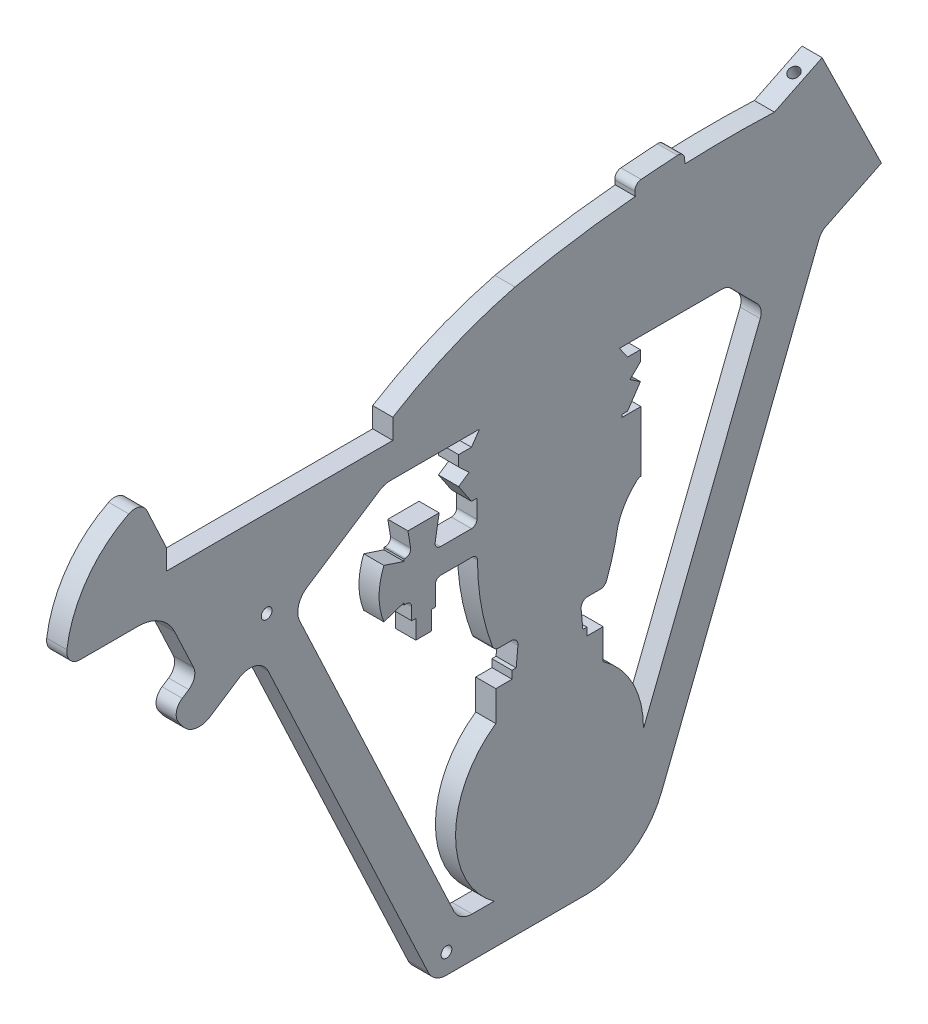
ISO-10303-21;
HEADER;
FILE_DESCRIPTION(('STEP AP214'),'2;1');
FILE_NAME('part.step','',(''),(''),'','','');
FILE_SCHEMA(('AUTOMOTIVE_DESIGN { 1 0 10303 214 1 1 1 1 }'));
ENDSEC;
DATA;
#1=APPLICATION_CONTEXT('core data for automotive mechanical design processes');
#2=APPLICATION_PROTOCOL_DEFINITION('international standard','automotive_design',2000,#1);
#3=PRODUCT_CONTEXT('',#1,'mechanical');
#4=PRODUCT('Part','Part','',(#3));
#5=PRODUCT_RELATED_PRODUCT_CATEGORY('part','',(#4));
#6=PRODUCT_DEFINITION_FORMATION('','',#4);
#7=PRODUCT_DEFINITION_CONTEXT('part definition',#1,'design');
#8=PRODUCT_DEFINITION('design','',#6,#7);
#9=PRODUCT_DEFINITION_SHAPE('','',#8);
#10=(LENGTH_UNIT() NAMED_UNIT(*) SI_UNIT(.MILLI.,.METRE.));
#11=(NAMED_UNIT(*) PLANE_ANGLE_UNIT() SI_UNIT($,.RADIAN.));
#12=(NAMED_UNIT(*) SI_UNIT($,.STERADIAN.) SOLID_ANGLE_UNIT());
#13=UNCERTAINTY_MEASURE_WITH_UNIT(LENGTH_MEASURE(1.E-05),#10,'distance_accuracy_value','');
#14=(GEOMETRIC_REPRESENTATION_CONTEXT(3) GLOBAL_UNCERTAINTY_ASSIGNED_CONTEXT((#13)) GLOBAL_UNIT_ASSIGNED_CONTEXT((#10,
#11,#12)) REPRESENTATION_CONTEXT('',''));
#15=CARTESIAN_POINT('',(0.,0.,0.));
#16=DIRECTION('',(0.,0.,1.));
#17=DIRECTION('',(1.,0.,0.));
#18=AXIS2_PLACEMENT_3D('',#15,#16,#17);
#19=CARTESIAN_POINT('',(15.,0.,-13617.1247866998));
#20=DIRECTION('',(0.,0.,1.));
#21=DIRECTION('',(1.,0.,0.));
#22=AXIS2_PLACEMENT_3D('',#19,#20,#21);
#23=PLANE('',#22);
#24=DIRECTION('',(0.,1.,0.));
#25=VECTOR('',#24,1.);
#26=CARTESIAN_POINT('',(15.,0.,-13617.1247866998));
#27=LINE('',#26,#25);
#28=CARTESIAN_POINT('',(15.,5105.93084574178,-13617.1247866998));
#29=VERTEX_POINT('',#28);
#30=CARTESIAN_POINT('',(15.,5107.88679146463,-13617.1247866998));
#31=VERTEX_POINT('',#30);
#32=EDGE_CURVE('E733',#29,#31,#27,.T.);
#33=ORIENTED_EDGE('',*,*,#32,.F.);
#34=DIRECTION('',(-1.,0.,0.));
#35=VECTOR('',#34,1.);
#36=CARTESIAN_POINT('',(15.,5105.93084574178,-13617.1247866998));
#37=LINE('',#36,#35);
#38=CARTESIAN_POINT('',(0.,5105.93084574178,-13617.1247866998));
#39=VERTEX_POINT('',#38);
#40=EDGE_CURVE('E717',#29,#39,#37,.T.);
#41=ORIENTED_EDGE('',*,*,#40,.T.);
#42=DIRECTION('',(0.,1.,0.));
#43=VECTOR('',#42,1.);
#44=CARTESIAN_POINT('',(0.,0.,-13617.1247866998));
#45=LINE('',#44,#43);
#46=CARTESIAN_POINT('',(0.,5107.88679146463,-13617.1247866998));
#47=VERTEX_POINT('',#46);
#48=EDGE_CURVE('E1010',#39,#47,#45,.T.);
#49=ORIENTED_EDGE('',*,*,#48,.T.);
#50=DIRECTION('',(-1.,0.,0.));
#51=VECTOR('',#50,1.);
#52=CARTESIAN_POINT('',(15.,5107.88679146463,-13617.1247866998));
#53=LINE('',#52,#51);
#54=EDGE_CURVE('E740',#31,#47,#53,.T.);
#55=ORIENTED_EDGE('',*,*,#54,.F.);
#56=EDGE_LOOP('',(#33,#41,#49,#55));
#57=FACE_BOUND('',#56,.T.);
#58=ADVANCED_FACE('F35',(#57),#23,.F.);
#59=CARTESIAN_POINT('',(15.,5107.88679146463,0.));
#60=DIRECTION('',(0.,-1.,0.));
#61=DIRECTION('',(0.,0.,-1.));
#62=AXIS2_PLACEMENT_3D('',#59,#60,#61);
#63=PLANE('',#62);
#64=DIRECTION('',(0.,0.,1.));
#65=VECTOR('',#64,1.);
#66=CARTESIAN_POINT('',(0.,5107.88679146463,0.));
#67=LINE('',#66,#65);
#68=CARTESIAN_POINT('',(0.,5107.88679146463,-13621.170969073));
#69=VERTEX_POINT('',#68);
#70=EDGE_CURVE('E1012',#69,#47,#67,.T.);
#71=ORIENTED_EDGE('',*,*,#70,.F.);
#72=DIRECTION('',(-1.,0.,0.));
#73=VECTOR('',#72,1.);
#74=CARTESIAN_POINT('',(15.,5107.88679146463,-13621.170969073));
#75=LINE('',#74,#73);
#76=CARTESIAN_POINT('',(15.,5107.88679146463,-13621.170969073));
#77=VERTEX_POINT('',#76);
#78=EDGE_CURVE('E1130',#77,#69,#75,.T.);
#79=ORIENTED_EDGE('',*,*,#78,.F.);
#80=DIRECTION('',(0.,0.,1.));
#81=VECTOR('',#80,1.);
#82=CARTESIAN_POINT('',(15.,5107.88679146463,0.));
#83=LINE('',#82,#81);
#84=EDGE_CURVE('E742',#77,#31,#83,.T.);
#85=ORIENTED_EDGE('',*,*,#84,.T.);
#86=ORIENTED_EDGE('',*,*,#54,.T.);
#87=EDGE_LOOP('',(#71,#79,#85,#86));
#88=FACE_BOUND('',#87,.T.);
#89=ADVANCED_FACE('F1819',(#88),#63,.T.);
#90=CARTESIAN_POINT('',(15.,-4715.89070295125,-7047.6797451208));
#91=DIRECTION('',(0.,0.556122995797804,0.831100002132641));
#92=DIRECTION('',(0.,-0.831100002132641,0.556122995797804));
#93=AXIS2_PLACEMENT_3D('',#90,#91,#92);
#94=PLANE('',#93);
#95=DIRECTION('',(0.,0.831100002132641,-0.556122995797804));
#96=VECTOR('',#95,1.);
#97=CARTESIAN_POINT('',(0.,-4715.89070295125,-7047.6797451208));
#98=LINE('',#97,#96);
#99=CARTESIAN_POINT('',(0.,5122.18719130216,-13630.7399513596));
#100=VERTEX_POINT('',#99);
#101=EDGE_CURVE('E1015',#69,#100,#98,.T.);
#102=ORIENTED_EDGE('',*,*,#101,.T.);
#103=DIRECTION('',(-1.,0.,0.));
#104=VECTOR('',#103,1.);
#105=CARTESIAN_POINT('',(15.,5122.18719130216,-13630.7399513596));
#106=LINE('',#105,#104);
#107=CARTESIAN_POINT('',(15.,5122.18719130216,-13630.7399513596));
#108=VERTEX_POINT('',#107);
#109=EDGE_CURVE('E1127',#108,#100,#106,.T.);
#110=ORIENTED_EDGE('',*,*,#109,.F.);
#111=DIRECTION('',(0.,0.831100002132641,-0.556122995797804));
#112=VECTOR('',#111,1.);
#113=CARTESIAN_POINT('',(15.,-4715.89070295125,-7047.6797451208));
#114=LINE('',#113,#112);
#115=EDGE_CURVE('E745',#77,#108,#114,.T.);
#116=ORIENTED_EDGE('',*,*,#115,.F.);
#117=ORIENTED_EDGE('',*,*,#78,.T.);
#118=EDGE_LOOP('',(#102,#110,#116,#117));
#119=FACE_BOUND('',#118,.T.);
#120=ADVANCED_FACE('F1826',(#119),#94,.F.);
#121=CARTESIAN_POINT('',(15.,9838.94875400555,-6612.16415613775));
#122=DIRECTION('',(0.,-0.829986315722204,0.557783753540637));
#123=DIRECTION('',(0.,-0.557783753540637,-0.829986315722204));
#124=AXIS2_PLACEMENT_3D('',#121,#122,#123);
#125=PLANE('',#124);
#126=DIRECTION('',(0.,0.557783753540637,0.829986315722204));
#127=VECTOR('',#126,1.);
#128=CARTESIAN_POINT('',(0.,9838.94875400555,-6612.16415613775));
#129=LINE('',#128,#127);
#130=CARTESIAN_POINT('',(0.,5127.44047203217,-13622.9230311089));
#131=VERTEX_POINT('',#130);
#132=EDGE_CURVE('E1017',#100,#131,#129,.T.);
#133=ORIENTED_EDGE('',*,*,#132,.T.);
#134=DIRECTION('',(-1.,0.,0.));
#135=VECTOR('',#134,1.);
#136=CARTESIAN_POINT('',(15.,5127.44047203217,-13622.9230311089));
#137=LINE('',#136,#135);
#138=CARTESIAN_POINT('',(15.,5127.44047203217,-13622.9230311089));
#139=VERTEX_POINT('',#138);
#140=EDGE_CURVE('E1124',#139,#131,#137,.T.);
#141=ORIENTED_EDGE('',*,*,#140,.F.);
#142=DIRECTION('',(0.,0.557783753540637,0.829986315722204));
#143=VECTOR('',#142,1.);
#144=CARTESIAN_POINT('',(15.,9838.94875400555,-6612.16415613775));
#145=LINE('',#144,#143);
#146=EDGE_CURVE('E753',#108,#139,#145,.T.);
#147=ORIENTED_EDGE('',*,*,#146,.F.);
#148=ORIENTED_EDGE('',*,*,#109,.T.);
#149=EDGE_LOOP('',(#133,#141,#147,#148));
#150=FACE_BOUND('',#149,.T.);
#151=ADVANCED_FACE('F2378',(#150),#125,.F.);
#152=CARTESIAN_POINT('',(15.,-4100.49512752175,-3886.24305963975));
#153=DIRECTION('',(0.,0.725814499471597,0.68789047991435));
#154=DIRECTION('',(0.,-0.68789047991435,0.725814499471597));
#155=AXIS2_PLACEMENT_3D('',#152,#153,#154);
#156=PLANE('',#155);
#157=DIRECTION('',(0.,0.68789047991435,-0.725814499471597));
#158=VECTOR('',#157,1.);
#159=CARTESIAN_POINT('',(0.,-4100.49512752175,-3886.24305963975));
#160=LINE('',#159,#158);
#161=CARTESIAN_POINT('',(0.,5134.84895591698,-13630.7399513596));
#162=VERTEX_POINT('',#161);
#163=EDGE_CURVE('E1019',#131,#162,#160,.T.);
#164=ORIENTED_EDGE('',*,*,#163,.T.);
#165=DIRECTION('',(-1.,0.,0.));
#166=VECTOR('',#165,1.);
#167=CARTESIAN_POINT('',(15.,5134.84895591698,-13630.7399513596));
#168=LINE('',#167,#166);
#169=CARTESIAN_POINT('',(15.,5134.84895591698,-13630.7399513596));
#170=VERTEX_POINT('',#169);
#171=EDGE_CURVE('E1121',#170,#162,#168,.T.);
#172=ORIENTED_EDGE('',*,*,#171,.F.);
#173=DIRECTION('',(0.,0.68789047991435,-0.725814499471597));
#174=VECTOR('',#173,1.);
#175=CARTESIAN_POINT('',(15.,-4100.49512752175,-3886.24305963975));
#176=LINE('',#175,#174);
#177=EDGE_CURVE('E755',#139,#170,#176,.T.);
#178=ORIENTED_EDGE('',*,*,#177,.F.);
#179=ORIENTED_EDGE('',*,*,#140,.T.);
#180=EDGE_LOOP('',(#164,#172,#178,#179));
#181=FACE_BOUND('',#180,.T.);
#182=ADVANCED_FACE('F2374',(#181),#156,.F.);
#183=CARTESIAN_POINT('',(15.,0.,-13630.7399513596));
#184=DIRECTION('',(0.,0.,1.));
#185=DIRECTION('',(1.,0.,0.));
#186=AXIS2_PLACEMENT_3D('',#183,#184,#185);
#187=PLANE('',#186);
#188=DIRECTION('',(0.,1.,0.));
#189=VECTOR('',#188,1.);
#190=CARTESIAN_POINT('',(0.,0.,-13630.7399513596));
#191=LINE('',#190,#189);
#192=CARTESIAN_POINT('',(0.,5142.79624059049,-13630.7399513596));
#193=VERTEX_POINT('',#192);
#194=EDGE_CURVE('E1021',#162,#193,#191,.T.);
#195=ORIENTED_EDGE('',*,*,#194,.T.);
#196=DIRECTION('',(-1.,0.,0.));
#197=VECTOR('',#196,1.);
#198=CARTESIAN_POINT('',(15.,5142.79624059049,-13630.7399513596));
#199=LINE('',#198,#197);
#200=CARTESIAN_POINT('',(15.,5142.79624059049,-13630.7399513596));
#201=VERTEX_POINT('',#200);
#202=EDGE_CURVE('E1118',#201,#193,#199,.T.);
#203=ORIENTED_EDGE('',*,*,#202,.F.);
#204=DIRECTION('',(0.,1.,0.));
#205=VECTOR('',#204,1.);
#206=CARTESIAN_POINT('',(15.,0.,-13630.7399513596));
#207=LINE('',#206,#205);
#208=EDGE_CURVE('E757',#170,#201,#207,.T.);
#209=ORIENTED_EDGE('',*,*,#208,.F.);
#210=ORIENTED_EDGE('',*,*,#171,.T.);
#211=EDGE_LOOP('',(#195,#203,#209,#210));
#212=FACE_BOUND('',#211,.T.);
#213=ADVANCED_FACE('F2370',(#212),#187,.F.);
#214=CARTESIAN_POINT('',(15.,5142.79624059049,0.));
#215=DIRECTION('',(0.,-1.,0.));
#216=DIRECTION('',(0.,0.,-1.));
#217=AXIS2_PLACEMENT_3D('',#214,#215,#216);
#218=PLANE('',#217);
#219=DIRECTION('',(0.,0.,1.));
#220=VECTOR('',#219,1.);
#221=CARTESIAN_POINT('',(0.,5142.79624059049,0.));
#222=LINE('',#221,#220);
#223=CARTESIAN_POINT('',(0.,5142.79624059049,-13621.170969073));
#224=VERTEX_POINT('',#223);
#225=EDGE_CURVE('E1023',#193,#224,#222,.T.);
#226=ORIENTED_EDGE('',*,*,#225,.T.);
#227=DIRECTION('',(-1.,0.,0.));
#228=VECTOR('',#227,1.);
#229=CARTESIAN_POINT('',(15.,5142.79624059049,-13621.170969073));
#230=LINE('',#229,#228);
#231=CARTESIAN_POINT('',(15.,5142.79624059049,-13621.170969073));
#232=VERTEX_POINT('',#231);
#233=EDGE_CURVE('E1115',#232,#224,#230,.T.);
#234=ORIENTED_EDGE('',*,*,#233,.F.);
#235=DIRECTION('',(0.,0.,1.));
#236=VECTOR('',#235,1.);
#237=CARTESIAN_POINT('',(15.,5142.79624059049,0.));
#238=LINE('',#237,#236);
#239=EDGE_CURVE('E759',#201,#232,#238,.T.);
#240=ORIENTED_EDGE('',*,*,#239,.F.);
#241=ORIENTED_EDGE('',*,*,#202,.T.);
#242=EDGE_LOOP('',(#226,#234,#240,#241));
#243=FACE_BOUND('',#242,.T.);
#244=ADVANCED_FACE('F2366',(#243),#218,.F.);
#245=CARTESIAN_POINT('',(15.,8059.39035829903,-11593.6916019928));
#246=DIRECTION('',(0.,-0.570788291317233,0.821097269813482));
#247=DIRECTION('',(0.,-0.821097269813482,-0.570788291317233));
#248=AXIS2_PLACEMENT_3D('',#245,#246,#247);
#249=PLANE('',#248);
#250=DIRECTION('',(0.,0.821097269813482,0.570788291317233));
#251=VECTOR('',#250,1.);
#252=CARTESIAN_POINT('',(0.,8059.39035829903,-11593.6916019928));
#253=LINE('',#252,#251);
#254=CARTESIAN_POINT('',(0.,5151.45062715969,-13615.1548456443));
#255=VERTEX_POINT('',#254);
#256=EDGE_CURVE('E1025',#224,#255,#253,.T.);
#257=ORIENTED_EDGE('',*,*,#256,.T.);
#258=DIRECTION('',(-1.,0.,0.));
#259=VECTOR('',#258,1.);
#260=CARTESIAN_POINT('',(15.,5151.45062715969,-13615.1548456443));
#261=LINE('',#260,#259);
#262=CARTESIAN_POINT('',(15.,5151.45062715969,-13615.1548456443));
#263=VERTEX_POINT('',#262);
#264=EDGE_CURVE('E1112',#263,#255,#261,.T.);
#265=ORIENTED_EDGE('',*,*,#264,.F.);
#266=DIRECTION('',(0.,0.821097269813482,0.570788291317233));
#267=VECTOR('',#266,1.);
#268=CARTESIAN_POINT('',(15.,8059.39035829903,-11593.6916019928));
#269=LINE('',#268,#267);
#270=EDGE_CURVE('E761',#232,#263,#269,.T.);
#271=ORIENTED_EDGE('',*,*,#270,.F.);
#272=ORIENTED_EDGE('',*,*,#233,.T.);
#273=EDGE_LOOP('',(#257,#265,#271,#272));
#274=FACE_BOUND('',#273,.T.);
#275=ADVANCED_FACE('F2362',(#274),#249,.F.);
#276=CARTESIAN_POINT('',(15.,5151.45062715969,0.));
#277=DIRECTION('',(0.,1.,0.));
#278=DIRECTION('',(0.,0.,1.));
#279=AXIS2_PLACEMENT_3D('',#276,#277,#278);
#280=PLANE('',#279);
#281=DIRECTION('',(0.,0.,-1.));
#282=VECTOR('',#281,1.);
#283=CARTESIAN_POINT('',(0.,5151.45062715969,0.));
#284=LINE('',#283,#282);
#285=CARTESIAN_POINT('',(0.,5151.45062715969,-13691.2781924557));
#286=VERTEX_POINT('',#285);
#287=EDGE_CURVE('E1027',#255,#286,#284,.T.);
#288=ORIENTED_EDGE('',*,*,#287,.T.);
#289=DIRECTION('',(-1.,0.,0.));
#290=VECTOR('',#289,1.);
#291=CARTESIAN_POINT('',(15.,5151.45062715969,-13691.2781924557));
#292=LINE('',#291,#290);
#293=CARTESIAN_POINT('',(15.,5151.45062715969,-13691.2781924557));
#294=VERTEX_POINT('',#293);
#295=EDGE_CURVE('E1110',#294,#286,#292,.T.);
#296=ORIENTED_EDGE('',*,*,#295,.F.);
#297=DIRECTION('',(0.,0.,-1.));
#298=VECTOR('',#297,1.);
#299=CARTESIAN_POINT('',(15.,5151.45062715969,0.));
#300=LINE('',#299,#298);
#301=EDGE_CURVE('E763',#263,#294,#300,.T.);
#302=ORIENTED_EDGE('',*,*,#301,.F.);
#303=ORIENTED_EDGE('',*,*,#264,.T.);
#304=EDGE_LOOP('',(#288,#296,#302,#303));
#305=FACE_BOUND('',#304,.T.);
#306=ADVANCED_FACE('F2358',(#305),#280,.F.);
#307=CARTESIAN_POINT('',(15.,5141.45062715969,-13691.2781924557));
#308=DIRECTION('',(-1.,0.,0.));
#309=DIRECTION('',(0.,0.,1.));
#310=AXIS2_PLACEMENT_3D('',#307,#308,#309);
#311=CYLINDRICAL_SURFACE('',#310,9.99999999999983);
#312=CARTESIAN_POINT('',(0.,5141.45062715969,-13691.2781924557));
#313=DIRECTION('',(1.,0.,0.));
#314=DIRECTION('',(0.,0.,-1.));
#315=AXIS2_PLACEMENT_3D('',#312,#313,#314);
#316=CIRCLE('',#315,9.99999999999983);
#317=CARTESIAN_POINT('',(0.,5148.490160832,-13698.3806544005));
#318=VERTEX_POINT('',#317);
#319=EDGE_CURVE('E1030',#318,#286,#316,.T.);
#320=ORIENTED_EDGE('',*,*,#319,.F.);
#321=DIRECTION('',(-1.,0.,0.));
#322=VECTOR('',#321,1.);
#323=CARTESIAN_POINT('',(15.,5148.490160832,-13698.3806544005));
#324=LINE('',#323,#322);
#325=CARTESIAN_POINT('',(15.,5148.490160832,-13698.3806544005));
#326=VERTEX_POINT('',#325);
#327=EDGE_CURVE('E1108',#326,#318,#324,.T.);
#328=ORIENTED_EDGE('',*,*,#327,.F.);
#329=CARTESIAN_POINT('',(15.,5141.45062715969,-13691.2781924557));
#330=DIRECTION('',(1.,0.,0.));
#331=DIRECTION('',(0.,0.,-1.));
#332=AXIS2_PLACEMENT_3D('',#329,#330,#331);
#333=CIRCLE('',#332,9.99999999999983);
#334=EDGE_CURVE('E765',#326,#294,#333,.T.);
#335=ORIENTED_EDGE('',*,*,#334,.T.);
#336=ORIENTED_EDGE('',*,*,#295,.T.);
#337=EDGE_LOOP('',(#320,#328,#335,#336));
#338=FACE_BOUND('',#337,.T.);
#339=ADVANCED_FACE('F2354',(#338),#311,.F.);
#340=CARTESIAN_POINT('',(15.,9400.25516784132,-9484.28656047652));
#341=DIRECTION('',(0.,0.703953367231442,-0.710246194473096));
#342=DIRECTION('',(0.,0.710246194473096,0.703953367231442));
#343=AXIS2_PLACEMENT_3D('',#340,#341,#342);
#344=PLANE('',#343);
#345=DIRECTION('',(0.,-0.710246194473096,-0.703953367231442));
#346=VECTOR('',#345,1.);
#347=CARTESIAN_POINT('',(0.,9400.25516784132,-9484.28656047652));
#348=LINE('',#347,#346);
#349=CARTESIAN_POINT('',(0.,5128.88597016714,-13717.8111506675));
#350=VERTEX_POINT('',#349);
#351=EDGE_CURVE('E1033',#318,#350,#348,.T.);
#352=ORIENTED_EDGE('',*,*,#351,.T.);
#353=DIRECTION('',(-1.,0.,0.));
#354=VECTOR('',#353,1.);
#355=CARTESIAN_POINT('',(15.,5128.88597016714,-13717.8111506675));
#356=LINE('',#355,#354);
#357=CARTESIAN_POINT('',(15.,5128.88597016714,-13717.8111506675));
#358=VERTEX_POINT('',#357);
#359=EDGE_CURVE('E1106',#358,#350,#356,.T.);
#360=ORIENTED_EDGE('',*,*,#359,.F.);
#361=DIRECTION('',(0.,-0.710246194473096,-0.703953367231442));
#362=VECTOR('',#361,1.);
#363=CARTESIAN_POINT('',(15.,9400.25516784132,-9484.28656047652));
#364=LINE('',#363,#362);
#365=EDGE_CURVE('E768',#326,#358,#364,.T.);
#366=ORIENTED_EDGE('',*,*,#365,.F.);
#367=ORIENTED_EDGE('',*,*,#327,.T.);
#368=EDGE_LOOP('',(#352,#360,#366,#367));
#369=FACE_BOUND('',#368,.T.);
#370=ADVANCED_FACE('F2350',(#369),#344,.F.);
#371=CARTESIAN_POINT('',(15.,5121.84643649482,-13710.7086887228));
#372=DIRECTION('',(-1.,0.,0.));
#373=DIRECTION('',(0.,0.,1.));
#374=AXIS2_PLACEMENT_3D('',#371,#372,#373);
#375=CYLINDRICAL_SURFACE('',#374,9.99999999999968);
#376=CARTESIAN_POINT('',(0.,5121.84643649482,-13710.7086887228));
#377=DIRECTION('',(1.,0.,0.));
#378=DIRECTION('',(0.,0.,-1.));
#379=AXIS2_PLACEMENT_3D('',#376,#377,#378);
#380=CIRCLE('',#379,9.99999999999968);
#381=CARTESIAN_POINT('',(0.,5118.18422980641,-13720.0139690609));
#382=VERTEX_POINT('',#381);
#383=EDGE_CURVE('E1036',#382,#350,#380,.T.);
#384=ORIENTED_EDGE('',*,*,#383,.F.);
#385=DIRECTION('',(-1.,0.,0.));
#386=VECTOR('',#385,1.);
#387=CARTESIAN_POINT('',(15.,5118.18422980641,-13720.0139690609));
#388=LINE('',#387,#386);
#389=CARTESIAN_POINT('',(15.,5118.18422980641,-13720.0139690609));
#390=VERTEX_POINT('',#389);
#391=EDGE_CURVE('E1104',#390,#382,#388,.T.);
#392=ORIENTED_EDGE('',*,*,#391,.F.);
#393=CARTESIAN_POINT('',(15.,5121.84643649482,-13710.7086887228));
#394=DIRECTION('',(1.,0.,0.));
#395=DIRECTION('',(0.,0.,-1.));
#396=AXIS2_PLACEMENT_3D('',#393,#394,#395);
#397=CIRCLE('',#396,9.99999999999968);
#398=EDGE_CURVE('E770',#390,#358,#397,.T.);
#399=ORIENTED_EDGE('',*,*,#398,.T.);
#400=ORIENTED_EDGE('',*,*,#359,.T.);
#401=EDGE_LOOP('',(#384,#392,#399,#400));
#402=FACE_BOUND('',#401,.T.);
#403=ADVANCED_FACE('F2346',(#402),#375,.F.);
#404=CARTESIAN_POINT('',(15.,-3989.04866339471,-10135.7512706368));
#405=DIRECTION('',(0.,-0.366220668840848,-0.930528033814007));
#406=DIRECTION('',(0.,0.930528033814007,-0.366220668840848));
#407=AXIS2_PLACEMENT_3D('',#404,#405,#406);
#408=PLANE('',#407);
#409=DIRECTION('',(0.,-0.930528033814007,0.366220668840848));
#410=VECTOR('',#409,1.);
#411=CARTESIAN_POINT('',(0.,-3989.04866339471,-10135.7512706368));
#412=LINE('',#411,#410);
#413=CARTESIAN_POINT('',(0.,4897.15304050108,-13633.0244458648));
#414=VERTEX_POINT('',#413);
#415=EDGE_CURVE('E1039',#382,#414,#412,.T.);
#416=ORIENTED_EDGE('',*,*,#415,.T.);
#417=DIRECTION('',(-1.,0.,0.));
#418=VECTOR('',#417,1.);
#419=CARTESIAN_POINT('',(15.,4897.15304050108,-13633.0244458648));
#420=LINE('',#419,#418);
#421=CARTESIAN_POINT('',(15.,4897.15304050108,-13633.0244458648));
#422=VERTEX_POINT('',#421);
#423=EDGE_CURVE('E1101',#422,#414,#420,.T.);
#424=ORIENTED_EDGE('',*,*,#423,.F.);
#425=DIRECTION('',(0.,-0.930528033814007,0.366220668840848));
#426=VECTOR('',#425,1.);
#427=CARTESIAN_POINT('',(15.,-3989.04866339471,-10135.7512706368));
#428=LINE('',#427,#426);
#429=EDGE_CURVE('E773',#390,#422,#428,.T.);
#430=ORIENTED_EDGE('',*,*,#429,.F.);
#431=ORIENTED_EDGE('',*,*,#391,.T.);
#432=EDGE_LOOP('',(#416,#424,#430,#431));
#433=FACE_BOUND('',#432,.T.);
#434=ADVANCED_FACE('F2342',(#433),#408,.F.);
#435=CARTESIAN_POINT('',(15.,4897.98917531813,-13563.0294397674));
#436=DIRECTION('',(-1.,0.,0.));
#437=DIRECTION('',(0.,0.,1.));
#438=AXIS2_PLACEMENT_3D('',#435,#436,#437);
#439=CYLINDRICAL_SURFACE('',#438,70.0000000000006);
#440=CARTESIAN_POINT('',(0.,4897.98917531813,-13563.0294397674));
#441=DIRECTION('',(1.,0.,0.));
#442=DIRECTION('',(0.,0.,-1.));
#443=AXIS2_PLACEMENT_3D('',#440,#441,#442);
#444=CIRCLE('',#443,70.0000000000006);
#445=CARTESIAN_POINT('',(0.,4955.43480178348,-13603.0294397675));
#446=VERTEX_POINT('',#445);
#447=EDGE_CURVE('E1041',#414,#446,#444,.T.);
#448=ORIENTED_EDGE('',*,*,#447,.T.);
#449=DIRECTION('',(-1.,0.,0.));
#450=VECTOR('',#449,1.);
#451=CARTESIAN_POINT('',(15.,4955.43480178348,-13603.0294397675));
#452=LINE('',#451,#450);
#453=CARTESIAN_POINT('',(15.,4955.43480178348,-13603.0294397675));
#454=VERTEX_POINT('',#453);
#455=EDGE_CURVE('E1099',#454,#446,#452,.T.);
#456=ORIENTED_EDGE('',*,*,#455,.F.);
#457=CARTESIAN_POINT('',(15.,4897.98917531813,-13563.0294397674));
#458=DIRECTION('',(1.,0.,0.));
#459=DIRECTION('',(0.,0.,-1.));
#460=AXIS2_PLACEMENT_3D('',#457,#458,#459);
#461=CIRCLE('',#460,70.0000000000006);
#462=EDGE_CURVE('E775',#422,#454,#461,.T.);
#463=ORIENTED_EDGE('',*,*,#462,.F.);
#464=ORIENTED_EDGE('',*,*,#423,.T.);
#465=EDGE_LOOP('',(#448,#456,#463,#464));
#466=FACE_BOUND('',#465,.T.);
#467=ADVANCED_FACE('F2338',(#466),#439,.T.);
#468=CARTESIAN_POINT('',(15.,2.35699012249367E-08,-13603.0294397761));
#469=DIRECTION('',(0.,1.73269500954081E-12,-1.));
#470=DIRECTION('',(0.,1.,1.73269500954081E-12));
#471=AXIS2_PLACEMENT_3D('',#468,#469,#470);
#472=PLANE('',#471);
#473=DIRECTION('',(0.,-1.,-1.73269500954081E-12));
#474=VECTOR('',#473,1.);
#475=CARTESIAN_POINT('',(0.,2.35699012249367E-08,-13603.0294397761));
#476=LINE('',#475,#474);
#477=CARTESIAN_POINT('',(0.,4977.98917531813,-13603.0294397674));
#478=VERTEX_POINT('',#477);
#479=EDGE_CURVE('E1044',#478,#446,#476,.T.);
#480=ORIENTED_EDGE('',*,*,#479,.F.);
#481=DIRECTION('',(-1.,0.,0.));
#482=VECTOR('',#481,1.);
#483=CARTESIAN_POINT('',(15.,4977.98917531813,-13603.0294397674));
#484=LINE('',#483,#482);
#485=CARTESIAN_POINT('',(15.,4977.98917531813,-13603.0294397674));
#486=VERTEX_POINT('',#485);
#487=EDGE_CURVE('E1097',#486,#478,#484,.T.);
#488=ORIENTED_EDGE('',*,*,#487,.F.);
#489=DIRECTION('',(0.,-1.,-1.73269500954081E-12));
#490=VECTOR('',#489,1.);
#491=CARTESIAN_POINT('',(15.,2.35699012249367E-08,-13603.0294397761));
#492=LINE('',#491,#490);
#493=EDGE_CURVE('E777',#486,#454,#492,.T.);
#494=ORIENTED_EDGE('',*,*,#493,.T.);
#495=ORIENTED_EDGE('',*,*,#455,.T.);
#496=EDGE_LOOP('',(#480,#488,#494,#495));
#497=FACE_BOUND('',#496,.T.);
#498=ADVANCED_FACE('F2334',(#497),#472,.T.);
#499=CARTESIAN_POINT('',(15.,4977.98917531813,0.));
#500=DIRECTION('',(0.,-1.,0.));
#501=DIRECTION('',(0.,0.,-1.));
#502=AXIS2_PLACEMENT_3D('',#499,#500,#501);
#503=PLANE('',#502);
#504=DIRECTION('',(0.,0.,1.));
#505=VECTOR('',#504,1.);
#506=CARTESIAN_POINT('',(0.,4977.98917531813,0.));
#507=LINE('',#506,#505);
#508=CARTESIAN_POINT('',(0.,4977.98917531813,-13590.9053058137));
#509=VERTEX_POINT('',#508);
#510=EDGE_CURVE('E1047',#478,#509,#507,.T.);
#511=ORIENTED_EDGE('',*,*,#510,.T.);
#512=DIRECTION('',(-1.,0.,0.));
#513=VECTOR('',#512,1.);
#514=CARTESIAN_POINT('',(15.,4977.98917531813,-13590.9053058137));
#515=LINE('',#514,#513);
#516=CARTESIAN_POINT('',(15.,4977.98917531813,-13590.9053058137));
#517=VERTEX_POINT('',#516);
#518=EDGE_CURVE('E1095',#517,#509,#515,.T.);
#519=ORIENTED_EDGE('',*,*,#518,.F.);
#520=DIRECTION('',(0.,0.,1.));
#521=VECTOR('',#520,1.);
#522=CARTESIAN_POINT('',(15.,4977.98917531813,0.));
#523=LINE('',#522,#521);
#524=EDGE_CURVE('E780',#486,#517,#523,.T.);
#525=ORIENTED_EDGE('',*,*,#524,.F.);
#526=ORIENTED_EDGE('',*,*,#487,.T.);
#527=EDGE_LOOP('',(#511,#519,#525,#526));
#528=FACE_BOUND('',#527,.T.);
#529=ADVANCED_FACE('F2330',(#528),#503,.F.);
#530=CARTESIAN_POINT('',(15.,0.,-13590.9053058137));
#531=DIRECTION('',(0.,0.,-1.));
#532=DIRECTION('',(-1.,0.,0.));
#533=AXIS2_PLACEMENT_3D('',#530,#531,#532);
#534=PLANE('',#533);
#535=DIRECTION('',(0.,-1.,0.));
#536=VECTOR('',#535,1.);
#537=CARTESIAN_POINT('',(0.,0.,-13590.9053058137));
#538=LINE('',#537,#536);
#539=CARTESIAN_POINT('',(0.,4983.72266775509,-13590.9053058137));
#540=VERTEX_POINT('',#539);
#541=EDGE_CURVE('E1050',#540,#509,#538,.T.);
#542=ORIENTED_EDGE('',*,*,#541,.F.);
#543=DIRECTION('',(-1.,0.,0.));
#544=VECTOR('',#543,1.);
#545=CARTESIAN_POINT('',(15.,4983.72266775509,-13590.9053058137));
#546=LINE('',#545,#544);
#547=CARTESIAN_POINT('',(15.,4983.72266775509,-13590.9053058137));
#548=VERTEX_POINT('',#547);
#549=EDGE_CURVE('E1093',#548,#540,#546,.T.);
#550=ORIENTED_EDGE('',*,*,#549,.F.);
#551=DIRECTION('',(0.,-1.,0.));
#552=VECTOR('',#551,1.);
#553=CARTESIAN_POINT('',(15.,0.,-13590.9053058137));
#554=LINE('',#553,#552);
#555=EDGE_CURVE('E782',#548,#517,#554,.T.);
#556=ORIENTED_EDGE('',*,*,#555,.T.);
#557=ORIENTED_EDGE('',*,*,#518,.T.);
#558=EDGE_LOOP('',(#542,#550,#556,#557));
#559=FACE_BOUND('',#558,.T.);
#560=ADVANCED_FACE('F2326',(#559),#534,.T.);
#561=CARTESIAN_POINT('',(15.,5264.74760274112,-109.747648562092));
#562=DIRECTION('',(0.,0.999782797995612,-0.0208412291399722));
#563=DIRECTION('',(0.,0.0208412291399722,0.999782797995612));
#564=AXIS2_PLACEMENT_3D('',#561,#562,#563);
#565=PLANE('',#564);
#566=DIRECTION('',(0.,-0.0208412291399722,-0.999782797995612));
#567=VECTOR('',#566,1.);
#568=CARTESIAN_POINT('',(0.,5264.74760274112,-109.747648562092));
#569=LINE('',#568,#567);
#570=CARTESIAN_POINT('',(0.,4983.78607722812,-13587.8634650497));
#571=VERTEX_POINT('',#570);
#572=EDGE_CURVE('E1053',#571,#540,#569,.T.);
#573=ORIENTED_EDGE('',*,*,#572,.F.);
#574=DIRECTION('',(-1.,0.,0.));
#575=VECTOR('',#574,1.);
#576=CARTESIAN_POINT('',(15.,4983.78607722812,-13587.8634650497));
#577=LINE('',#576,#575);
#578=CARTESIAN_POINT('',(15.,4983.78607722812,-13587.8634650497));
#579=VERTEX_POINT('',#578);
#580=EDGE_CURVE('E1091',#579,#571,#577,.T.);
#581=ORIENTED_EDGE('',*,*,#580,.F.);
#582=DIRECTION('',(0.,-0.0208412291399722,-0.999782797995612));
#583=VECTOR('',#582,1.);
#584=CARTESIAN_POINT('',(15.,5264.74760274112,-109.747648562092));
#585=LINE('',#584,#583);
#586=EDGE_CURVE('E785',#579,#548,#585,.T.);
#587=ORIENTED_EDGE('',*,*,#586,.T.);
#588=ORIENTED_EDGE('',*,*,#549,.T.);
#589=EDGE_LOOP('',(#573,#581,#587,#588));
#590=FACE_BOUND('',#589,.T.);
#591=ADVANCED_FACE('F2322',(#590),#565,.T.);
#592=CARTESIAN_POINT('',(15.,1307.22835769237,-13932.8118194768));
#593=DIRECTION('',(0.,0.0934134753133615,-0.995627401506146));
#594=DIRECTION('',(0.,0.995627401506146,0.0934134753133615));
#595=AXIS2_PLACEMENT_3D('',#592,#593,#594);
#596=PLANE('',#595);
#597=DIRECTION('',(0.,-0.995627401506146,-0.0934134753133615));
#598=VECTOR('',#597,1.);
#599=CARTESIAN_POINT('',(0.,1307.22835769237,-13932.8118194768));
#600=LINE('',#599,#598);
#601=CARTESIAN_POINT('',(0.,4997.66993467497,-13586.5608297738));
#602=VERTEX_POINT('',#601);
#603=EDGE_CURVE('E1056',#602,#571,#600,.T.);
#604=ORIENTED_EDGE('',*,*,#603,.F.);
#605=DIRECTION('',(-1.,0.,0.));
#606=VECTOR('',#605,1.);
#607=CARTESIAN_POINT('',(15.,4997.66993467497,-13586.5608297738));
#608=LINE('',#607,#606);
#609=CARTESIAN_POINT('',(15.,4997.66993467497,-13586.5608297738));
#610=VERTEX_POINT('',#609);
#611=EDGE_CURVE('E1089',#610,#602,#608,.T.);
#612=ORIENTED_EDGE('',*,*,#611,.F.);
#613=DIRECTION('',(0.,-0.995627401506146,-0.0934134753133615));
#614=VECTOR('',#613,1.);
#615=CARTESIAN_POINT('',(15.,1307.22835769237,-13932.8118194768));
#616=LINE('',#615,#614);
#617=EDGE_CURVE('E788',#610,#579,#616,.T.);
#618=ORIENTED_EDGE('',*,*,#617,.T.);
#619=ORIENTED_EDGE('',*,*,#580,.T.);
#620=EDGE_LOOP('',(#604,#612,#618,#619));
#621=FACE_BOUND('',#620,.T.);
#622=ADVANCED_FACE('F2318',(#621),#596,.T.);
#623=CARTESIAN_POINT('',(15.,4998.13700205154,-13591.5389667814));
#624=DIRECTION('',(-1.,0.,0.));
#625=DIRECTION('',(0.,0.,1.));
#626=AXIS2_PLACEMENT_3D('',#623,#624,#625);
#627=CYLINDRICAL_SURFACE('',#626,5.00000000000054);
#628=CARTESIAN_POINT('',(0.,4998.13700205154,-13591.5389667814));
#629=DIRECTION('',(1.,0.,0.));
#630=DIRECTION('',(0.,0.,-1.));
#631=AXIS2_PLACEMENT_3D('',#628,#629,#630);
#632=CIRCLE('',#631,5.00000000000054);
#633=CARTESIAN_POINT('',(0.,5003.13700205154,-13591.5389667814));
#634=VERTEX_POINT('',#633);
#635=EDGE_CURVE('E1059',#634,#602,#632,.T.);
#636=ORIENTED_EDGE('',*,*,#635,.F.);
#637=DIRECTION('',(-1.,0.,0.));
#638=VECTOR('',#637,1.);
#639=CARTESIAN_POINT('',(15.,5003.13700205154,-13591.5389667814));
#640=LINE('',#639,#638);
#641=CARTESIAN_POINT('',(15.,5003.13700205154,-13591.5389667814));
#642=VERTEX_POINT('',#641);
#643=EDGE_CURVE('E1087',#642,#634,#640,.T.);
#644=ORIENTED_EDGE('',*,*,#643,.F.);
#645=CARTESIAN_POINT('',(15.,4998.13700205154,-13591.5389667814));
#646=DIRECTION('',(1.,0.,0.));
#647=DIRECTION('',(0.,0.,-1.));
#648=AXIS2_PLACEMENT_3D('',#645,#646,#647);
#649=CIRCLE('',#648,5.00000000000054);
#650=EDGE_CURVE('E791',#642,#610,#649,.T.);
#651=ORIENTED_EDGE('',*,*,#650,.T.);
#652=ORIENTED_EDGE('',*,*,#611,.T.);
#653=EDGE_LOOP('',(#636,#644,#651,#652));
#654=FACE_BOUND('',#653,.T.);
#655=ADVANCED_FACE('F2314',(#654),#627,.F.);
#656=CARTESIAN_POINT('',(15.,5003.13700205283,-4.77962559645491E-10));
#657=DIRECTION('',(0.,1.,0.));
#658=DIRECTION('',(0.,0.,1.));
#659=AXIS2_PLACEMENT_3D('',#656,#657,#658);
#660=PLANE('',#659);
#661=DIRECTION('',(0.,0.,-1.));
#662=VECTOR('',#661,1.);
#663=CARTESIAN_POINT('',(0.,5003.13700205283,-4.77962559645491E-10));
#664=LINE('',#663,#662);
#665=CARTESIAN_POINT('',(0.,5003.13700205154,-13600.836093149));
#666=VERTEX_POINT('',#665);
#667=EDGE_CURVE('E1062',#634,#666,#664,.T.);
#668=ORIENTED_EDGE('',*,*,#667,.T.);
#669=DIRECTION('',(-1.,0.,0.));
#670=VECTOR('',#669,1.);
#671=CARTESIAN_POINT('',(15.,5003.13700205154,-13600.836093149));
#672=LINE('',#671,#670);
#673=CARTESIAN_POINT('',(15.,5003.13700205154,-13600.836093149));
#674=VERTEX_POINT('',#673);
#675=EDGE_CURVE('E1084',#674,#666,#672,.T.);
#676=ORIENTED_EDGE('',*,*,#675,.F.);
#677=DIRECTION('',(0.,0.,-1.));
#678=VECTOR('',#677,1.);
#679=CARTESIAN_POINT('',(15.,5003.13700205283,-4.77962559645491E-10));
#680=LINE('',#679,#678);
#681=EDGE_CURVE('E794',#642,#674,#680,.T.);
#682=ORIENTED_EDGE('',*,*,#681,.F.);
#683=ORIENTED_EDGE('',*,*,#643,.T.);
#684=EDGE_LOOP('',(#668,#676,#682,#683));
#685=FACE_BOUND('',#684,.T.);
#686=ADVANCED_FACE('F2310',(#685),#660,.F.);
#687=CARTESIAN_POINT('',(15.,5008.13700205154,-13600.836093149));
#688=DIRECTION('',(-1.,0.,0.));
#689=DIRECTION('',(0.,0.,1.));
#690=AXIS2_PLACEMENT_3D('',#687,#688,#689);
#691=CYLINDRICAL_SURFACE('',#690,4.99999999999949);
#692=CARTESIAN_POINT('',(0.,5008.13700205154,-13600.836093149));
#693=DIRECTION('',(1.,0.,0.));
#694=DIRECTION('',(0.,0.,-1.));
#695=AXIS2_PLACEMENT_3D('',#692,#693,#694);
#696=CIRCLE('',#695,4.99999999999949);
#697=CARTESIAN_POINT('',(0.,5006.38158488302,-13605.5178140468));
#698=VERTEX_POINT('',#697);
#699=EDGE_CURVE('E1064',#666,#698,#696,.T.);
#700=ORIENTED_EDGE('',*,*,#699,.T.);
#701=DIRECTION('',(-1.,0.,0.));
#702=VECTOR('',#701,1.);
#703=CARTESIAN_POINT('',(15.,5006.38158488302,-13605.5178140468));
#704=LINE('',#703,#702);
#705=CARTESIAN_POINT('',(15.,5006.38158488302,-13605.5178140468));
#706=VERTEX_POINT('',#705);
#707=EDGE_CURVE('E1081',#706,#698,#704,.T.);
#708=ORIENTED_EDGE('',*,*,#707,.F.);
#709=CARTESIAN_POINT('',(15.,5008.13700205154,-13600.836093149));
#710=DIRECTION('',(1.,0.,0.));
#711=DIRECTION('',(0.,0.,-1.));
#712=AXIS2_PLACEMENT_3D('',#709,#710,#711);
#713=CIRCLE('',#712,4.99999999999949);
#714=EDGE_CURVE('E796',#674,#706,#713,.T.);
#715=ORIENTED_EDGE('',*,*,#714,.F.);
#716=ORIENTED_EDGE('',*,*,#675,.T.);
#717=EDGE_LOOP('',(#700,#708,#715,#716));
#718=FACE_BOUND('',#717,.T.);
#719=ADVANCED_FACE('F2306',(#718),#691,.T.);
#720=CARTESIAN_POINT('',(15.,5067.98338841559,-13441.2249860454));
#721=DIRECTION('',(-1.,0.,0.));
#722=DIRECTION('',(0.,0.,1.));
#723=AXIS2_PLACEMENT_3D('',#720,#721,#722);
#724=CYLINDRICAL_SURFACE('',#723,175.462005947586);
#725=CARTESIAN_POINT('',(0.,5067.98338841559,-13441.2249860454));
#726=DIRECTION('',(1.,0.,0.));
#727=DIRECTION('',(0.,0.,-1.));
#728=AXIS2_PLACEMENT_3D('',#725,#726,#727);
#729=CIRCLE('',#728,175.462005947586);
#730=CARTESIAN_POINT('',(0.,5037.60558605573,-13614.0373254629));
#731=VERTEX_POINT('',#730);
#732=EDGE_CURVE('E1066',#698,#731,#729,.T.);
#733=ORIENTED_EDGE('',*,*,#732,.T.);
#734=DIRECTION('',(-1.,0.,0.));
#735=VECTOR('',#734,1.);
#736=CARTESIAN_POINT('',(15.,5037.60558605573,-13614.0373254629));
#737=LINE('',#736,#735);
#738=CARTESIAN_POINT('',(15.,5037.60558605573,-13614.0373254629));
#739=VERTEX_POINT('',#738);
#740=EDGE_CURVE('E1078',#739,#731,#737,.T.);
#741=ORIENTED_EDGE('',*,*,#740,.F.);
#742=CARTESIAN_POINT('',(15.,5067.98338841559,-13441.2249860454));
#743=DIRECTION('',(1.,0.,0.));
#744=DIRECTION('',(0.,0.,-1.));
#745=AXIS2_PLACEMENT_3D('',#742,#743,#744);
#746=CIRCLE('',#745,175.462005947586);
#747=EDGE_CURVE('E798',#706,#739,#746,.T.);
#748=ORIENTED_EDGE('',*,*,#747,.F.);
#749=ORIENTED_EDGE('',*,*,#707,.T.);
#750=EDGE_LOOP('',(#733,#741,#748,#749));
#751=FACE_BOUND('',#750,.T.);
#752=ADVANCED_FACE('F2302',(#751),#724,.T.);
#753=CARTESIAN_POINT('',(15.,5023.45706988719,-13660.6622967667));
#754=DIRECTION('',(-1.,0.,0.));
#755=DIRECTION('',(0.,0.,1.));
#756=AXIS2_PLACEMENT_3D('',#753,#754,#755);
#757=CYLINDRICAL_SURFACE('',#756,48.7244133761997);
#758=CARTESIAN_POINT('',(0.,5023.45706988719,-13660.6622967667));
#759=DIRECTION('',(1.,0.,0.));
#760=DIRECTION('',(0.,0.,-1.));
#761=AXIS2_PLACEMENT_3D('',#758,#759,#760);
#762=CIRCLE('',#761,48.7244133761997);
#763=CARTESIAN_POINT('',(0.,5059.6443061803,-13628.0348177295));
#764=VERTEX_POINT('',#763);
#765=EDGE_CURVE('E1069',#764,#731,#762,.T.);
#766=ORIENTED_EDGE('',*,*,#765,.F.);
#767=DIRECTION('',(-1.,0.,0.));
#768=VECTOR('',#767,1.);
#769=CARTESIAN_POINT('',(15.,5059.6443061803,-13628.0348177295));
#770=LINE('',#769,#768);
#771=CARTESIAN_POINT('',(15.,5059.6443061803,-13628.0348177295));
#772=VERTEX_POINT('',#771);
#773=EDGE_CURVE('E1075',#772,#764,#770,.T.);
#774=ORIENTED_EDGE('',*,*,#773,.F.);
#775=CARTESIAN_POINT('',(15.,5023.45706988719,-13660.6622967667));
#776=DIRECTION('',(1.,0.,0.));
#777=DIRECTION('',(0.,0.,-1.));
#778=AXIS2_PLACEMENT_3D('',#775,#776,#777);
#779=CIRCLE('',#778,48.7244133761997);
#780=EDGE_CURVE('E800',#772,#739,#779,.T.);
#781=ORIENTED_EDGE('',*,*,#780,.T.);
#782=ORIENTED_EDGE('',*,*,#740,.T.);
#783=EDGE_LOOP('',(#766,#774,#781,#782));
#784=FACE_BOUND('',#783,.T.);
#785=ADVANCED_FACE('F2299',(#784),#757,.F.);
#786=CARTESIAN_POINT('',(15.,5067.63652315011,-13481.9825903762));
#787=DIRECTION('',(-1.,0.,0.));
#788=DIRECTION('',(0.,0.,1.));
#789=AXIS2_PLACEMENT_3D('',#786,#787,#788);
#790=CYLINDRICAL_SURFACE('',#789,4.00000000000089);
#791=CARTESIAN_POINT('',(0.,5067.63652315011,-13481.9825903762));
#792=DIRECTION('',(1.,0.,0.));
#793=DIRECTION('',(0.,0.,-1.));
#794=AXIS2_PLACEMENT_3D('',#791,#792,#793);
#795=CIRCLE('',#794,4.00000000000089);
#796=CARTESIAN_POINT('',(0.,5071.63652315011,-13481.9825903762));
#797=VERTEX_POINT('',#796);
#798=CARTESIAN_POINT('',(0.,5067.63652315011,-13477.9825903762));
#799=VERTEX_POINT('',#798);
#800=EDGE_CURVE('E871',#797,#799,#795,.T.);
#801=ORIENTED_EDGE('',*,*,#800,.F.);
#802=DIRECTION('',(-1.,0.,0.));
#803=VECTOR('',#802,1.);
#804=CARTESIAN_POINT('',(15.,5071.63652315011,-13481.9825903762));
#805=LINE('',#804,#803);
#806=CARTESIAN_POINT('',(15.,5071.63652315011,-13481.9825903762));
#807=VERTEX_POINT('',#806);
#808=EDGE_CURVE('E1079',#807,#797,#805,.T.);
#809=ORIENTED_EDGE('',*,*,#808,.F.);
#810=CARTESIAN_POINT('',(15.,5067.63652315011,-13481.9825903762));
#811=DIRECTION('',(1.,0.,0.));
#812=DIRECTION('',(0.,0.,-1.));
#813=AXIS2_PLACEMENT_3D('',#810,#811,#812);
#814=CIRCLE('',#813,4.00000000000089);
#815=CARTESIAN_POINT('',(15.,5067.63652315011,-13477.9825903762));
#816=VERTEX_POINT('',#815);
#817=EDGE_CURVE('E1482',#807,#816,#814,.T.);
#818=ORIENTED_EDGE('',*,*,#817,.T.);
#819=DIRECTION('',(-1.,0.,0.));
#820=VECTOR('',#819,1.);
#821=CARTESIAN_POINT('',(15.,5067.63652315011,-13477.9825903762));
#822=LINE('',#821,#820);
#823=EDGE_CURVE('E1134',#816,#799,#822,.T.);
#824=ORIENTED_EDGE('',*,*,#823,.T.);
#825=EDGE_LOOP('',(#801,#809,#818,#824));
#826=FACE_BOUND('',#825,.T.);
#827=ADVANCED_FACE('F1621',(#826),#790,.F.);
#828=CARTESIAN_POINT('',(15.,5071.63652315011,0.));
#829=DIRECTION('',(0.,1.,0.));
#830=DIRECTION('',(0.,0.,1.));
#831=AXIS2_PLACEMENT_3D('',#828,#829,#830);
#832=PLANE('',#831);
#833=DIRECTION('',(0.,0.,-1.));
#834=VECTOR('',#833,1.);
#835=CARTESIAN_POINT('',(0.,5071.63652315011,0.));
#836=LINE('',#835,#834);
#837=CARTESIAN_POINT('',(0.,5071.63652315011,-13505.3722227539));
#838=VERTEX_POINT('',#837);
#839=EDGE_CURVE('E874',#797,#838,#836,.T.);
#840=ORIENTED_EDGE('',*,*,#839,.T.);
#841=DIRECTION('',(-1.,0.,0.));
#842=VECTOR('',#841,1.);
#843=CARTESIAN_POINT('',(15.,5071.63652315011,-13505.3722227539));
#844=LINE('',#843,#842);
#845=CARTESIAN_POINT('',(15.,5071.63652315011,-13505.3722227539));
#846=VERTEX_POINT('',#845);
#847=EDGE_CURVE('E1231',#846,#838,#844,.T.);
#848=ORIENTED_EDGE('',*,*,#847,.F.);
#849=DIRECTION('',(0.,0.,-1.));
#850=VECTOR('',#849,1.);
#851=CARTESIAN_POINT('',(15.,5071.63652315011,0.));
#852=LINE('',#851,#850);
#853=EDGE_CURVE('E1485',#807,#846,#852,.T.);
#854=ORIENTED_EDGE('',*,*,#853,.F.);
#855=ORIENTED_EDGE('',*,*,#808,.T.);
#856=EDGE_LOOP('',(#840,#848,#854,#855));
#857=FACE_BOUND('',#856,.T.);
#858=ADVANCED_FACE('F1626',(#857),#832,.F.);
#859=CARTESIAN_POINT('',(15.,5067.63652315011,-13505.3722227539));
#860=DIRECTION('',(-1.,0.,0.));
#861=DIRECTION('',(0.,0.,1.));
#862=AXIS2_PLACEMENT_3D('',#859,#860,#861);
#863=CYLINDRICAL_SURFACE('',#862,3.99999999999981);
#864=CARTESIAN_POINT('',(0.,5067.63652315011,-13505.3722227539));
#865=DIRECTION('',(1.,0.,0.));
#866=DIRECTION('',(0.,0.,-1.));
#867=AXIS2_PLACEMENT_3D('',#864,#865,#866);
#868=CIRCLE('',#867,3.99999999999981);
#869=CARTESIAN_POINT('',(0.,5067.64425437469,-13509.3722152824));
#870=VERTEX_POINT('',#869);
#871=EDGE_CURVE('E877',#870,#838,#868,.T.);
#872=ORIENTED_EDGE('',*,*,#871,.F.);
#873=DIRECTION('',(-1.,0.,0.));
#874=VECTOR('',#873,1.);
#875=CARTESIAN_POINT('',(15.,5067.64425437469,-13509.3722152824));
#876=LINE('',#875,#874);
#877=CARTESIAN_POINT('',(15.,5067.64425437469,-13509.3722152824));
#878=VERTEX_POINT('',#877);
#879=EDGE_CURVE('E1229',#878,#870,#876,.T.);
#880=ORIENTED_EDGE('',*,*,#879,.F.);
#881=CARTESIAN_POINT('',(15.,5067.63652315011,-13505.3722227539));
#882=DIRECTION('',(1.,0.,0.));
#883=DIRECTION('',(0.,0.,-1.));
#884=AXIS2_PLACEMENT_3D('',#881,#882,#883);
#885=CIRCLE('',#884,3.99999999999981);
#886=EDGE_CURVE('E1487',#878,#846,#885,.T.);
#887=ORIENTED_EDGE('',*,*,#886,.T.);
#888=ORIENTED_EDGE('',*,*,#847,.T.);
#889=EDGE_LOOP('',(#872,#880,#887,#888));
#890=FACE_BOUND('',#889,.T.);
#891=ADVANCED_FACE('F1630',(#890),#863,.F.);
#892=CARTESIAN_POINT('',(15.,5067.9833884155,-13684.8338934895));
#893=DIRECTION('',(-1.,0.,0.));
#894=DIRECTION('',(0.,0.,1.));
#895=AXIS2_PLACEMENT_3D('',#892,#893,#894);
#896=CYLINDRICAL_SURFACE('',#895,175.462005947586);
#897=CARTESIAN_POINT('',(0.,5067.9833884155,-13684.8338934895));
#898=DIRECTION('',(1.,0.,0.));
#899=DIRECTION('',(0.,0.,-1.));
#900=AXIS2_PLACEMENT_3D('',#897,#898,#899);
#901=CIRCLE('',#900,175.462005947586);
#902=CARTESIAN_POINT('',(0.,5006.38158488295,-13520.5410654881));
#903=VERTEX_POINT('',#902);
#904=EDGE_CURVE('E880',#870,#903,#901,.T.);
#905=ORIENTED_EDGE('',*,*,#904,.T.);
#906=DIRECTION('',(-1.,0.,0.));
#907=VECTOR('',#906,1.);
#908=CARTESIAN_POINT('',(15.,5006.38158488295,-13520.5410654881));
#909=LINE('',#908,#907);
#910=CARTESIAN_POINT('',(15.,5006.38158488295,-13520.5410654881));
#911=VERTEX_POINT('',#910);
#912=EDGE_CURVE('E1226',#911,#903,#909,.T.);
#913=ORIENTED_EDGE('',*,*,#912,.F.);
#914=CARTESIAN_POINT('',(15.,5067.9833884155,-13684.8338934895));
#915=DIRECTION('',(1.,0.,0.));
#916=DIRECTION('',(0.,0.,-1.));
#917=AXIS2_PLACEMENT_3D('',#914,#915,#916);
#918=CIRCLE('',#917,175.462005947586);
#919=EDGE_CURVE('E1490',#878,#911,#918,.T.);
#920=ORIENTED_EDGE('',*,*,#919,.F.);
#921=ORIENTED_EDGE('',*,*,#879,.T.);
#922=EDGE_LOOP('',(#905,#913,#920,#921));
#923=FACE_BOUND('',#922,.T.);
#924=ADVANCED_FACE('F1635',(#923),#896,.T.);
#925=CARTESIAN_POINT('',(15.,5008.13700205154,-13525.2227863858));
#926=DIRECTION('',(-1.,0.,0.));
#927=DIRECTION('',(0.,0.,1.));
#928=AXIS2_PLACEMENT_3D('',#925,#926,#927);
#929=CYLINDRICAL_SURFACE('',#928,5.00000000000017);
#930=CARTESIAN_POINT('',(0.,5008.13700205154,-13525.2227863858));
#931=DIRECTION('',(1.,0.,0.));
#932=DIRECTION('',(0.,0.,-1.));
#933=AXIS2_PLACEMENT_3D('',#930,#931,#932);
#934=CIRCLE('',#933,5.00000000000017);
#935=CARTESIAN_POINT('',(0.,5003.13700205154,-13525.2227863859));
#936=VERTEX_POINT('',#935);
#937=EDGE_CURVE('E883',#903,#936,#934,.T.);
#938=ORIENTED_EDGE('',*,*,#937,.T.);
#939=DIRECTION('',(-1.,0.,0.));
#940=VECTOR('',#939,1.);
#941=CARTESIAN_POINT('',(15.,5003.13700205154,-13525.2227863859));
#942=LINE('',#941,#940);
#943=CARTESIAN_POINT('',(15.,5003.13700205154,-13525.2227863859));
#944=VERTEX_POINT('',#943);
#945=EDGE_CURVE('E1224',#944,#936,#942,.T.);
#946=ORIENTED_EDGE('',*,*,#945,.F.);
#947=CARTESIAN_POINT('',(15.,5008.13700205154,-13525.2227863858));
#948=DIRECTION('',(1.,0.,0.));
#949=DIRECTION('',(0.,0.,-1.));
#950=AXIS2_PLACEMENT_3D('',#947,#948,#949);
#951=CIRCLE('',#950,5.00000000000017);
#952=EDGE_CURVE('E1493',#911,#944,#951,.T.);
#953=ORIENTED_EDGE('',*,*,#952,.F.);
#954=ORIENTED_EDGE('',*,*,#912,.T.);
#955=EDGE_LOOP('',(#938,#946,#953,#954));
#956=FACE_BOUND('',#955,.T.);
#957=ADVANCED_FACE('F1640',(#956),#929,.T.);
#958=CARTESIAN_POINT('',(15.,5003.13700205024,4.77962559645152E-10));
#959=DIRECTION('',(0.,-1.,0.));
#960=DIRECTION('',(0.,0.,-1.));
#961=AXIS2_PLACEMENT_3D('',#958,#959,#960);
#962=PLANE('',#961);
#963=DIRECTION('',(0.,0.,1.));
#964=VECTOR('',#963,1.);
#965=CARTESIAN_POINT('',(0.,5003.13700205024,4.77962559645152E-10));
#966=LINE('',#965,#964);
#967=CARTESIAN_POINT('',(0.,5003.13700205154,-13534.5199127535));
#968=VERTEX_POINT('',#967);
#969=EDGE_CURVE('E886',#968,#936,#966,.T.);
#970=ORIENTED_EDGE('',*,*,#969,.F.);
#971=DIRECTION('',(-1.,0.,0.));
#972=VECTOR('',#971,1.);
#973=CARTESIAN_POINT('',(15.,5003.13700205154,-13534.5199127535));
#974=LINE('',#973,#972);
#975=CARTESIAN_POINT('',(15.,5003.13700205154,-13534.5199127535));
#976=VERTEX_POINT('',#975);
#977=EDGE_CURVE('E1222',#976,#968,#974,.T.);
#978=ORIENTED_EDGE('',*,*,#977,.F.);
#979=DIRECTION('',(0.,0.,1.));
#980=VECTOR('',#979,1.);
#981=CARTESIAN_POINT('',(15.,5003.13700205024,4.77962559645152E-10));
#982=LINE('',#981,#980);
#983=EDGE_CURVE('E1495',#976,#944,#982,.T.);
#984=ORIENTED_EDGE('',*,*,#983,.T.);
#985=ORIENTED_EDGE('',*,*,#945,.T.);
#986=EDGE_LOOP('',(#970,#978,#984,#985));
#987=FACE_BOUND('',#986,.T.);
#988=ADVANCED_FACE('F1643',(#987),#962,.T.);
#989=CARTESIAN_POINT('',(15.,4998.13700205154,-13534.5199127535));
#990=DIRECTION('',(-1.,0.,0.));
#991=DIRECTION('',(0.,0.,1.));
#992=AXIS2_PLACEMENT_3D('',#989,#990,#991);
#993=CYLINDRICAL_SURFACE('',#992,4.99999999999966);
#994=CARTESIAN_POINT('',(0.,4998.13700205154,-13534.5199127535));
#995=DIRECTION('',(1.,0.,0.));
#996=DIRECTION('',(0.,0.,-1.));
#997=AXIS2_PLACEMENT_3D('',#994,#995,#996);
#998=CIRCLE('',#997,4.99999999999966);
#999=CARTESIAN_POINT('',(0.,4997.66993467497,-13539.498049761));
#1000=VERTEX_POINT('',#999);
#1001=EDGE_CURVE('E889',#1000,#968,#998,.T.);
#1002=ORIENTED_EDGE('',*,*,#1001,.F.);
#1003=DIRECTION('',(-1.,0.,0.));
#1004=VECTOR('',#1003,1.);
#1005=CARTESIAN_POINT('',(15.,4997.66993467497,-13539.498049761));
#1006=LINE('',#1005,#1004);
#1007=CARTESIAN_POINT('',(15.,4997.66993467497,-13539.498049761));
#1008=VERTEX_POINT('',#1007);
#1009=EDGE_CURVE('E1220',#1008,#1000,#1006,.T.);
#1010=ORIENTED_EDGE('',*,*,#1009,.F.);
#1011=CARTESIAN_POINT('',(15.,4998.13700205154,-13534.5199127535));
#1012=DIRECTION('',(1.,0.,0.));
#1013=DIRECTION('',(0.,0.,-1.));
#1014=AXIS2_PLACEMENT_3D('',#1011,#1012,#1013);
#1015=CIRCLE('',#1014,4.99999999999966);
#1016=EDGE_CURVE('E1498',#1008,#976,#1015,.T.);
#1017=ORIENTED_EDGE('',*,*,#1016,.T.);
#1018=ORIENTED_EDGE('',*,*,#977,.T.);
#1019=EDGE_LOOP('',(#1002,#1010,#1017,#1018));
#1020=FACE_BOUND('',#1019,.T.);
#1021=ADVANCED_FACE('F1646',(#1020),#993,.F.);
#1022=CARTESIAN_POINT('',(15.,-1215.63117405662,-12956.5429715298));
#1023=DIRECTION('',(0.,-0.0934134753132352,-0.995627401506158));
#1024=DIRECTION('',(0.,0.995627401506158,-0.0934134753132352));
#1025=AXIS2_PLACEMENT_3D('',#1022,#1023,#1024);
#1026=PLANE('',#1025);
#1027=DIRECTION('',(0.,-0.995627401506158,0.0934134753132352));
#1028=VECTOR('',#1027,1.);
#1029=CARTESIAN_POINT('',(0.,-1215.63117405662,-12956.5429715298));
#1030=LINE('',#1029,#1028);
#1031=CARTESIAN_POINT('',(0.,4983.78607722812,-13538.1954144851));
#1032=VERTEX_POINT('',#1031);
#1033=EDGE_CURVE('E892',#1000,#1032,#1030,.T.);
#1034=ORIENTED_EDGE('',*,*,#1033,.T.);
#1035=DIRECTION('',(-1.,0.,0.));
#1036=VECTOR('',#1035,1.);
#1037=CARTESIAN_POINT('',(15.,4983.78607722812,-13538.1954144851));
#1038=LINE('',#1037,#1036);
#1039=CARTESIAN_POINT('',(15.,4983.78607722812,-13538.1954144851));
#1040=VERTEX_POINT('',#1039);
#1041=EDGE_CURVE('E1217',#1040,#1032,#1038,.T.);
#1042=ORIENTED_EDGE('',*,*,#1041,.F.);
#1043=DIRECTION('',(0.,-0.995627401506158,0.0934134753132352));
#1044=VECTOR('',#1043,1.);
#1045=CARTESIAN_POINT('',(15.,-1215.63117405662,-12956.5429715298));
#1046=LINE('',#1045,#1044);
#1047=EDGE_CURVE('E1501',#1008,#1040,#1046,.T.);
#1048=ORIENTED_EDGE('',*,*,#1047,.F.);
#1049=ORIENTED_EDGE('',*,*,#1009,.T.);
#1050=EDGE_LOOP('',(#1034,#1042,#1048,#1049));
#1051=FACE_BOUND('',#1050,.T.);
#1052=ADVANCED_FACE('F1651',(#1051),#1026,.F.);
#1053=CARTESIAN_POINT('',(15.,4699.5299870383,97.9652595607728));
#1054=DIRECTION('',(0.,-0.999782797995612,-0.0208412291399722));
#1055=DIRECTION('',(0.,0.0208412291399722,-0.999782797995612));
#1056=AXIS2_PLACEMENT_3D('',#1053,#1054,#1055);
#1057=PLANE('',#1056);
#1058=DIRECTION('',(0.,-0.0208412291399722,0.999782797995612));
#1059=VECTOR('',#1058,1.);
#1060=CARTESIAN_POINT('',(0.,4699.5299870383,97.9652595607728));
#1061=LINE('',#1060,#1059);
#1062=CARTESIAN_POINT('',(0.,4983.72266775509,-13535.1535737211));
#1063=VERTEX_POINT('',#1062);
#1064=EDGE_CURVE('E895',#1032,#1063,#1061,.T.);
#1065=ORIENTED_EDGE('',*,*,#1064,.T.);
#1066=DIRECTION('',(-1.,0.,0.));
#1067=VECTOR('',#1066,1.);
#1068=CARTESIAN_POINT('',(15.,4983.72266775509,-13535.1535737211));
#1069=LINE('',#1068,#1067);
#1070=CARTESIAN_POINT('',(15.,4983.72266775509,-13535.1535737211));
#1071=VERTEX_POINT('',#1070);
#1072=EDGE_CURVE('E1214',#1071,#1063,#1069,.T.);
#1073=ORIENTED_EDGE('',*,*,#1072,.F.);
#1074=DIRECTION('',(0.,-0.0208412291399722,0.999782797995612));
#1075=VECTOR('',#1074,1.);
#1076=CARTESIAN_POINT('',(15.,4699.5299870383,97.9652595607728));
#1077=LINE('',#1076,#1075);
#1078=EDGE_CURVE('E1504',#1040,#1071,#1077,.T.);
#1079=ORIENTED_EDGE('',*,*,#1078,.F.);
#1080=ORIENTED_EDGE('',*,*,#1041,.T.);
#1081=EDGE_LOOP('',(#1065,#1073,#1079,#1080));
#1082=FACE_BOUND('',#1081,.T.);
#1083=ADVANCED_FACE('F1654',(#1082),#1057,.F.);
#1084=CARTESIAN_POINT('',(15.,0.,-13535.1535737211));
#1085=DIRECTION('',(0.,0.,-1.));
#1086=DIRECTION('',(-1.,0.,0.));
#1087=AXIS2_PLACEMENT_3D('',#1084,#1085,#1086);
#1088=PLANE('',#1087);
#1089=DIRECTION('',(0.,-1.,0.));
#1090=VECTOR('',#1089,1.);
#1091=CARTESIAN_POINT('',(0.,0.,-13535.1535737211));
#1092=LINE('',#1091,#1090);
#1093=CARTESIAN_POINT('',(0.,4977.98917531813,-13535.1535737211));
#1094=VERTEX_POINT('',#1093);
#1095=EDGE_CURVE('E898',#1063,#1094,#1092,.T.);
#1096=ORIENTED_EDGE('',*,*,#1095,.T.);
#1097=DIRECTION('',(-1.,0.,0.));
#1098=VECTOR('',#1097,1.);
#1099=CARTESIAN_POINT('',(15.,4977.98917531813,-13535.1535737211));
#1100=LINE('',#1099,#1098);
#1101=CARTESIAN_POINT('',(15.,4977.98917531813,-13535.1535737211));
#1102=VERTEX_POINT('',#1101);
#1103=EDGE_CURVE('E1211',#1102,#1094,#1100,.T.);
#1104=ORIENTED_EDGE('',*,*,#1103,.F.);
#1105=DIRECTION('',(0.,-1.,0.));
#1106=VECTOR('',#1105,1.);
#1107=CARTESIAN_POINT('',(15.,0.,-13535.1535737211));
#1108=LINE('',#1107,#1106);
#1109=EDGE_CURVE('E1507',#1071,#1102,#1108,.T.);
#1110=ORIENTED_EDGE('',*,*,#1109,.F.);
#1111=ORIENTED_EDGE('',*,*,#1072,.T.);
#1112=EDGE_LOOP('',(#1096,#1104,#1110,#1111));
#1113=FACE_BOUND('',#1112,.T.);
#1114=ADVANCED_FACE('F1656',(#1113),#1088,.F.);
#1115=CARTESIAN_POINT('',(15.,4977.98917531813,0.));
#1116=DIRECTION('',(0.,-1.,0.));
#1117=DIRECTION('',(0.,0.,-1.));
#1118=AXIS2_PLACEMENT_3D('',#1115,#1116,#1117);
#1119=PLANE('',#1118);
#1120=DIRECTION('',(0.,0.,1.));
#1121=VECTOR('',#1120,1.);
#1122=CARTESIAN_POINT('',(0.,4977.98917531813,0.));
#1123=LINE('',#1122,#1121);
#1124=CARTESIAN_POINT('',(0.,4977.98917531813,-13523.0294397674));
#1125=VERTEX_POINT('',#1124);
#1126=EDGE_CURVE('E901',#1094,#1125,#1123,.T.);
#1127=ORIENTED_EDGE('',*,*,#1126,.T.);
#1128=DIRECTION('',(-1.,0.,0.));
#1129=VECTOR('',#1128,1.);
#1130=CARTESIAN_POINT('',(15.,4977.98917531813,-13523.0294397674));
#1131=LINE('',#1130,#1129);
#1132=CARTESIAN_POINT('',(15.,4977.98917531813,-13523.0294397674));
#1133=VERTEX_POINT('',#1132);
#1134=EDGE_CURVE('E1208',#1133,#1125,#1131,.T.);
#1135=ORIENTED_EDGE('',*,*,#1134,.F.);
#1136=DIRECTION('',(0.,0.,1.));
#1137=VECTOR('',#1136,1.);
#1138=CARTESIAN_POINT('',(15.,4977.98917531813,0.));
#1139=LINE('',#1138,#1137);
#1140=EDGE_CURVE('E1510',#1102,#1133,#1139,.T.);
#1141=ORIENTED_EDGE('',*,*,#1140,.F.);
#1142=ORIENTED_EDGE('',*,*,#1103,.T.);
#1143=EDGE_LOOP('',(#1127,#1135,#1141,#1142));
#1144=FACE_BOUND('',#1143,.T.);
#1145=ADVANCED_FACE('F1661',(#1144),#1119,.F.);
#1146=CARTESIAN_POINT('',(15.,-2.55614024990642E-08,-13523.029439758));
#1147=DIRECTION('',(0.,-1.89021273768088E-12,-1.));
#1148=DIRECTION('',(0.,1.,-1.89021273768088E-12));
#1149=AXIS2_PLACEMENT_3D('',#1146,#1147,#1148);
#1150=PLANE('',#1149);
#1151=DIRECTION('',(0.,-1.,1.89021273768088E-12));
#1152=VECTOR('',#1151,1.);
#1153=CARTESIAN_POINT('',(0.,-2.55614024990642E-08,-13523.029439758));
#1154=LINE('',#1153,#1152);
#1155=CARTESIAN_POINT('',(0.,4955.43480178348,-13523.0294397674));
#1156=VERTEX_POINT('',#1155);
#1157=EDGE_CURVE('E904',#1125,#1156,#1154,.T.);
#1158=ORIENTED_EDGE('',*,*,#1157,.T.);
#1159=DIRECTION('',(-1.,0.,0.));
#1160=VECTOR('',#1159,1.);
#1161=CARTESIAN_POINT('',(15.,4955.43480178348,-13523.0294397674));
#1162=LINE('',#1161,#1160);
#1163=CARTESIAN_POINT('',(15.,4955.43480178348,-13523.0294397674));
#1164=VERTEX_POINT('',#1163);
#1165=EDGE_CURVE('E1205',#1164,#1156,#1162,.T.);
#1166=ORIENTED_EDGE('',*,*,#1165,.F.);
#1167=DIRECTION('',(0.,-1.,1.89021273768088E-12));
#1168=VECTOR('',#1167,1.);
#1169=CARTESIAN_POINT('',(15.,-2.55614024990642E-08,-13523.029439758));
#1170=LINE('',#1169,#1168);
#1171=EDGE_CURVE('E1513',#1133,#1164,#1170,.T.);
#1172=ORIENTED_EDGE('',*,*,#1171,.F.);
#1173=ORIENTED_EDGE('',*,*,#1134,.T.);
#1174=EDGE_LOOP('',(#1158,#1166,#1172,#1173));
#1175=FACE_BOUND('',#1174,.T.);
#1176=ADVANCED_FACE('F1663',(#1175),#1150,.F.);
#1177=CARTESIAN_POINT('',(15.,4897.98917531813,-13563.0294397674));
#1178=DIRECTION('',(-1.,0.,0.));
#1179=DIRECTION('',(0.,0.,1.));
#1180=AXIS2_PLACEMENT_3D('',#1177,#1178,#1179);
#1181=CYLINDRICAL_SURFACE('',#1180,69.9999999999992);
#1182=CARTESIAN_POINT('',(0.,4897.98917531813,-13563.0294397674));
#1183=DIRECTION('',(1.,0.,0.));
#1184=DIRECTION('',(0.,0.,-1.));
#1185=AXIS2_PLACEMENT_3D('',#1182,#1183,#1184);
#1186=CIRCLE('',#1185,69.9999999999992);
#1187=CARTESIAN_POINT('',(0.,4841.45062715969,-13521.7572630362));
#1188=VERTEX_POINT('',#1187);
#1189=EDGE_CURVE('E907',#1156,#1188,#1186,.T.);
#1190=ORIENTED_EDGE('',*,*,#1189,.T.);
#1191=DIRECTION('',(-1.,0.,0.));
#1192=VECTOR('',#1191,1.);
#1193=CARTESIAN_POINT('',(15.,4841.45062715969,-13521.7572630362));
#1194=LINE('',#1193,#1192);
#1195=CARTESIAN_POINT('',(15.,4841.45062715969,-13521.7572630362));
#1196=VERTEX_POINT('',#1195);
#1197=EDGE_CURVE('E1202',#1196,#1188,#1194,.T.);
#1198=ORIENTED_EDGE('',*,*,#1197,.F.);
#1199=CARTESIAN_POINT('',(15.,4897.98917531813,-13563.0294397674));
#1200=DIRECTION('',(1.,0.,0.));
#1201=DIRECTION('',(0.,0.,-1.));
#1202=AXIS2_PLACEMENT_3D('',#1199,#1200,#1201);
#1203=CIRCLE('',#1202,69.9999999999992);
#1204=EDGE_CURVE('E1516',#1164,#1196,#1203,.T.);
#1205=ORIENTED_EDGE('',*,*,#1204,.F.);
#1206=ORIENTED_EDGE('',*,*,#1165,.T.);
#1207=EDGE_LOOP('',(#1190,#1198,#1205,#1206));
#1208=FACE_BOUND('',#1207,.T.);
#1209=ADVANCED_FACE('F1665',(#1208),#1181,.T.);
#1210=CARTESIAN_POINT('',(15.,4841.45062715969,0.));
#1211=DIRECTION('',(0.,1.,0.));
#1212=DIRECTION('',(0.,0.,1.));
#1213=AXIS2_PLACEMENT_3D('',#1210,#1211,#1212);
#1214=PLANE('',#1213);
#1215=DIRECTION('',(0.,0.,-1.));
#1216=VECTOR('',#1215,1.);
#1217=CARTESIAN_POINT('',(0.,4841.45062715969,0.));
#1218=LINE('',#1217,#1216);
#1219=CARTESIAN_POINT('',(0.,4841.45062715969,-13505.3476263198));
#1220=VERTEX_POINT('',#1219);
#1221=EDGE_CURVE('E910',#1220,#1188,#1218,.T.);
#1222=ORIENTED_EDGE('',*,*,#1221,.F.);
#1223=DIRECTION('',(-1.,0.,0.));
#1224=VECTOR('',#1223,1.);
#1225=CARTESIAN_POINT('',(15.,4841.45062715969,-13505.3476263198));
#1226=LINE('',#1225,#1224);
#1227=CARTESIAN_POINT('',(15.,4841.45062715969,-13505.3476263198));
#1228=VERTEX_POINT('',#1227);
#1229=EDGE_CURVE('E1292',#1220,#1228,#1226,.F.);
#1230=ORIENTED_EDGE('',*,*,#1229,.T.);
#1231=DIRECTION('',(0.,0.,-1.));
#1232=VECTOR('',#1231,1.);
#1233=CARTESIAN_POINT('',(15.,4841.45062715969,0.));
#1234=LINE('',#1233,#1232);
#1235=EDGE_CURVE('E1519',#1228,#1196,#1234,.T.);
#1236=ORIENTED_EDGE('',*,*,#1235,.T.);
#1237=ORIENTED_EDGE('',*,*,#1197,.T.);
#1238=EDGE_LOOP('',(#1222,#1230,#1236,#1237));
#1239=FACE_BOUND('',#1238,.T.);
#1240=ADVANCED_FACE('F1808',(#1239),#1214,.T.);
#1241=CARTESIAN_POINT('',(15.,6065.52492531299,-12921.2087064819));
#1242=DIRECTION('',(0.,0.424933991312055,-0.905224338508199));
#1243=DIRECTION('',(0.,0.905224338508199,0.424933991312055));
#1244=AXIS2_PLACEMENT_3D('',#1241,#1242,#1243);
#1245=PLANE('',#1244);
#1246=DIRECTION('',(0.,-0.905224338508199,-0.424933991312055));
#1247=VECTOR('',#1246,1.);
#1248=CARTESIAN_POINT('',(15.,6065.52492531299,-12921.2087064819));
#1249=LINE('',#1248,#1247);
#1250=CARTESIAN_POINT('',(15.,5094.65627333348,-13376.9577112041));
#1251=VERTEX_POINT('',#1250);
#1252=CARTESIAN_POINT('',(15.,4850.07661729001,-13491.7692612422));
#1253=VERTEX_POINT('',#1252);
#1254=EDGE_CURVE('E1521',#1251,#1253,#1249,.T.);
#1255=ORIENTED_EDGE('',*,*,#1254,.T.);
#1256=DIRECTION('',(-1.,0.,0.));
#1257=VECTOR('',#1256,1.);
#1258=CARTESIAN_POINT('',(0.,4850.07661729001,-13491.7692612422));
#1259=LINE('',#1258,#1257);
#1260=CARTESIAN_POINT('',(0.,4850.07661729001,-13491.7692612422));
#1261=VERTEX_POINT('',#1260);
#1262=EDGE_CURVE('E1289',#1253,#1261,#1259,.T.);
#1263=ORIENTED_EDGE('',*,*,#1262,.T.);
#1264=DIRECTION('',(0.,-0.905224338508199,-0.424933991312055));
#1265=VECTOR('',#1264,1.);
#1266=CARTESIAN_POINT('',(0.,6065.52492531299,-12921.2087064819));
#1267=LINE('',#1266,#1265);
#1268=CARTESIAN_POINT('',(0.,5094.65627333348,-13376.9577112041));
#1269=VERTEX_POINT('',#1268);
#1270=EDGE_CURVE('E912',#1269,#1261,#1267,.T.);
#1271=ORIENTED_EDGE('',*,*,#1270,.F.);
#1272=DIRECTION('',(-1.,0.,0.));
#1273=VECTOR('',#1272,1.);
#1274=CARTESIAN_POINT('',(15.,5094.65627333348,-13376.9577112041));
#1275=LINE('',#1274,#1273);
#1276=EDGE_CURVE('E1279',#1269,#1251,#1275,.F.);
#1277=ORIENTED_EDGE('',*,*,#1276,.T.);
#1278=EDGE_LOOP('',(#1255,#1263,#1271,#1277));
#1279=FACE_BOUND('',#1278,.T.);
#1280=ADVANCED_FACE('F1677',(#1279),#1245,.T.);
#1281=CARTESIAN_POINT('',(15.,-2563.73162518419,-1682.26237286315));
#1282=DIRECTION('',(0.,0.836075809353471,0.548613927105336));
#1283=DIRECTION('',(0.,-0.548613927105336,0.836075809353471));
#1284=AXIS2_PLACEMENT_3D('',#1281,#1282,#1283);
#1285=PLANE('',#1284);
#1286=DIRECTION('',(0.,0.548613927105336,-0.836075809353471));
#1287=VECTOR('',#1286,1.);
#1288=CARTESIAN_POINT('',(0.,-2563.73162518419,-1682.26237286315));
#1289=LINE('',#1288,#1287);
#1290=CARTESIAN_POINT('',(0.,5113.57142034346,-13382.3068673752));
#1291=VERTEX_POINT('',#1290);
#1292=CARTESIAN_POINT('',(0.,5148.99176429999,-13436.2867087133));
#1293=VERTEX_POINT('',#1292);
#1294=EDGE_CURVE('E915',#1291,#1293,#1289,.T.);
#1295=ORIENTED_EDGE('',*,*,#1294,.T.);
#1296=DIRECTION('',(-1.,0.,0.));
#1297=VECTOR('',#1296,1.);
#1298=CARTESIAN_POINT('',(15.,5148.99176429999,-13436.2867087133));
#1299=LINE('',#1298,#1297);
#1300=CARTESIAN_POINT('',(15.,5148.99176429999,-13436.2867087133));
#1301=VERTEX_POINT('',#1300);
#1302=EDGE_CURVE('E1277',#1293,#1301,#1299,.F.);
#1303=ORIENTED_EDGE('',*,*,#1302,.T.);
#1304=DIRECTION('',(0.,0.548613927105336,-0.836075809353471));
#1305=VECTOR('',#1304,1.);
#1306=CARTESIAN_POINT('',(15.,-2563.73162518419,-1682.26237286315));
#1307=LINE('',#1306,#1305);
#1308=CARTESIAN_POINT('',(15.,5113.57142034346,-13382.3068673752));
#1309=VERTEX_POINT('',#1308);
#1310=EDGE_CURVE('E1524',#1309,#1301,#1307,.T.);
#1311=ORIENTED_EDGE('',*,*,#1310,.F.);
#1312=DIRECTION('',(-1.,0.,0.));
#1313=VECTOR('',#1312,1.);
#1314=CARTESIAN_POINT('',(15.,5113.57142034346,-13382.3068673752));
#1315=LINE('',#1314,#1313);
#1316=EDGE_CURVE('E1274',#1309,#1291,#1315,.T.);
#1317=ORIENTED_EDGE('',*,*,#1316,.T.);
#1318=EDGE_LOOP('',(#1295,#1303,#1311,#1317));
#1319=FACE_BOUND('',#1318,.T.);
#1320=ADVANCED_FACE('F1687',(#1319),#1285,.F.);
#1321=CARTESIAN_POINT('',(15.,5151.45062715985,-6.45605007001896E-11));
#1322=DIRECTION('',(0.,1.,0.));
#1323=DIRECTION('',(0.,0.,1.));
#1324=AXIS2_PLACEMENT_3D('',#1321,#1322,#1323);
#1325=PLANE('',#1324);
#1326=DIRECTION('',(0.,0.,-1.));
#1327=VECTOR('',#1326,1.);
#1328=CARTESIAN_POINT('',(15.,5151.45062715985,-6.45605007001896E-11));
#1329=LINE('',#1328,#1327);
#1330=CARTESIAN_POINT('',(15.,5151.45062715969,-13444.5159176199));
#1331=VERTEX_POINT('',#1330);
#1332=CARTESIAN_POINT('',(15.,5151.45062715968,-13510.9040338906));
#1333=VERTEX_POINT('',#1332);
#1334=EDGE_CURVE('E1527',#1331,#1333,#1329,.T.);
#1335=ORIENTED_EDGE('',*,*,#1334,.F.);
#1336=DIRECTION('',(-1.,0.,0.));
#1337=VECTOR('',#1336,1.);
#1338=CARTESIAN_POINT('',(0.,5151.45062715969,-13444.5159176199));
#1339=LINE('',#1338,#1337);
#1340=CARTESIAN_POINT('',(0.,5151.45062715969,-13444.5159176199));
#1341=VERTEX_POINT('',#1340);
#1342=EDGE_CURVE('E1133',#1331,#1341,#1339,.T.);
#1343=ORIENTED_EDGE('',*,*,#1342,.T.);
#1344=DIRECTION('',(0.,0.,-1.));
#1345=VECTOR('',#1344,1.);
#1346=CARTESIAN_POINT('',(0.,5151.45062715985,-6.45605007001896E-11));
#1347=LINE('',#1346,#1345);
#1348=CARTESIAN_POINT('',(0.,5151.45062715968,-13510.9040338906));
#1349=VERTEX_POINT('',#1348);
#1350=EDGE_CURVE('E918',#1341,#1349,#1347,.T.);
#1351=ORIENTED_EDGE('',*,*,#1350,.T.);
#1352=DIRECTION('',(-1.,0.,0.));
#1353=VECTOR('',#1352,1.);
#1354=CARTESIAN_POINT('',(15.,5151.45062715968,-13510.9040338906));
#1355=LINE('',#1354,#1353);
#1356=EDGE_CURVE('E1199',#1333,#1349,#1355,.T.);
#1357=ORIENTED_EDGE('',*,*,#1356,.F.);
#1358=EDGE_LOOP('',(#1335,#1343,#1351,#1357));
#1359=FACE_BOUND('',#1358,.T.);
#1360=ADVANCED_FACE('F1696',(#1359),#1325,.F.);
#1361=CARTESIAN_POINT('',(15.,-4653.85310443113,-6694.71700153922));
#1362=DIRECTION('',(0.,0.570788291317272,0.821097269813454));
#1363=DIRECTION('',(0.,-0.821097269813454,0.570788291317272));
#1364=AXIS2_PLACEMENT_3D('',#1361,#1362,#1363);
#1365=PLANE('',#1364);
#1366=DIRECTION('',(0.,0.821097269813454,-0.570788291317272));
#1367=VECTOR('',#1366,1.);
#1368=CARTESIAN_POINT('',(0.,-4653.85310443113,-6694.71700153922));
#1369=LINE('',#1368,#1367);
#1370=CARTESIAN_POINT('',(0.,5142.79624059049,-13504.8879104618));
#1371=VERTEX_POINT('',#1370);
#1372=EDGE_CURVE('E920',#1371,#1349,#1369,.T.);
#1373=ORIENTED_EDGE('',*,*,#1372,.F.);
#1374=DIRECTION('',(-1.,0.,0.));
#1375=VECTOR('',#1374,1.);
#1376=CARTESIAN_POINT('',(15.,5142.79624059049,-13504.8879104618));
#1377=LINE('',#1376,#1375);
#1378=CARTESIAN_POINT('',(15.,5142.79624059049,-13504.8879104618));
#1379=VERTEX_POINT('',#1378);
#1380=EDGE_CURVE('E1197',#1379,#1371,#1377,.T.);
#1381=ORIENTED_EDGE('',*,*,#1380,.F.);
#1382=DIRECTION('',(0.,0.821097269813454,-0.570788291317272));
#1383=VECTOR('',#1382,1.);
#1384=CARTESIAN_POINT('',(15.,-4653.85310443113,-6694.71700153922));
#1385=LINE('',#1384,#1383);
#1386=EDGE_CURVE('E1529',#1379,#1333,#1385,.T.);
#1387=ORIENTED_EDGE('',*,*,#1386,.T.);
#1388=ORIENTED_EDGE('',*,*,#1356,.T.);
#1389=EDGE_LOOP('',(#1373,#1381,#1387,#1388));
#1390=FACE_BOUND('',#1389,.T.);
#1391=ADVANCED_FACE('F1701',(#1390),#1365,.T.);
#1392=CARTESIAN_POINT('',(15.,5142.79624059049,0.));
#1393=DIRECTION('',(0.,1.,0.));
#1394=DIRECTION('',(0.,0.,1.));
#1395=AXIS2_PLACEMENT_3D('',#1392,#1393,#1394);
#1396=PLANE('',#1395);
#1397=DIRECTION('',(0.,0.,-1.));
#1398=VECTOR('',#1397,1.);
#1399=CARTESIAN_POINT('',(0.,5142.79624059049,0.));
#1400=LINE('',#1399,#1398);
#1401=CARTESIAN_POINT('',(0.,5142.79624059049,-13495.3189281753));
#1402=VERTEX_POINT('',#1401);
#1403=EDGE_CURVE('E923',#1402,#1371,#1400,.T.);
#1404=ORIENTED_EDGE('',*,*,#1403,.F.);
#1405=DIRECTION('',(-1.,0.,0.));
#1406=VECTOR('',#1405,1.);
#1407=CARTESIAN_POINT('',(15.,5142.79624059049,-13495.3189281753));
#1408=LINE('',#1407,#1406);
#1409=CARTESIAN_POINT('',(15.,5142.79624059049,-13495.3189281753));
#1410=VERTEX_POINT('',#1409);
#1411=EDGE_CURVE('E1195',#1410,#1402,#1408,.T.);
#1412=ORIENTED_EDGE('',*,*,#1411,.F.);
#1413=DIRECTION('',(0.,0.,-1.));
#1414=VECTOR('',#1413,1.);
#1415=CARTESIAN_POINT('',(15.,5142.79624059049,0.));
#1416=LINE('',#1415,#1414);
#1417=EDGE_CURVE('E1532',#1410,#1379,#1416,.T.);
#1418=ORIENTED_EDGE('',*,*,#1417,.T.);
#1419=ORIENTED_EDGE('',*,*,#1380,.T.);
#1420=EDGE_LOOP('',(#1404,#1412,#1418,#1419));
#1421=FACE_BOUND('',#1420,.T.);
#1422=ADVANCED_FACE('F1706',(#1421),#1396,.T.);
#1423=CARTESIAN_POINT('',(15.,0.,-13495.3189281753));
#1424=DIRECTION('',(0.,0.,1.));
#1425=DIRECTION('',(1.,0.,0.));
#1426=AXIS2_PLACEMENT_3D('',#1423,#1424,#1425);
#1427=PLANE('',#1426);
#1428=DIRECTION('',(0.,1.,0.));
#1429=VECTOR('',#1428,1.);
#1430=CARTESIAN_POINT('',(0.,0.,-13495.3189281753));
#1431=LINE('',#1430,#1429);
#1432=CARTESIAN_POINT('',(0.,5134.84895591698,-13495.3189281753));
#1433=VERTEX_POINT('',#1432);
#1434=EDGE_CURVE('E926',#1433,#1402,#1431,.T.);
#1435=ORIENTED_EDGE('',*,*,#1434,.F.);
#1436=DIRECTION('',(-1.,0.,0.));
#1437=VECTOR('',#1436,1.);
#1438=CARTESIAN_POINT('',(15.,5134.84895591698,-13495.3189281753));
#1439=LINE('',#1438,#1437);
#1440=CARTESIAN_POINT('',(15.,5134.84895591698,-13495.3189281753));
#1441=VERTEX_POINT('',#1440);
#1442=EDGE_CURVE('E1193',#1441,#1433,#1439,.T.);
#1443=ORIENTED_EDGE('',*,*,#1442,.F.);
#1444=DIRECTION('',(0.,1.,0.));
#1445=VECTOR('',#1444,1.);
#1446=CARTESIAN_POINT('',(15.,0.,-13495.3189281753));
#1447=LINE('',#1446,#1445);
#1448=EDGE_CURVE('E1535',#1441,#1410,#1447,.T.);
#1449=ORIENTED_EDGE('',*,*,#1448,.T.);
#1450=ORIENTED_EDGE('',*,*,#1411,.T.);
#1451=EDGE_LOOP('',(#1435,#1443,#1449,#1450));
#1452=FACE_BOUND('',#1451,.T.);
#1453=ADVANCED_FACE('F1709',(#1452),#1427,.T.);
#1454=CARTESIAN_POINT('',(15.,9443.02753933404,-8949.62659275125));
#1455=DIRECTION('',(0.,-0.725814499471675,0.687890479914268));
#1456=DIRECTION('',(0.,-0.687890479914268,-0.725814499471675));
#1457=AXIS2_PLACEMENT_3D('',#1454,#1455,#1456);
#1458=PLANE('',#1457);
#1459=DIRECTION('',(0.,0.687890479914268,0.725814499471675));
#1460=VECTOR('',#1459,1.);
#1461=CARTESIAN_POINT('',(0.,9443.02753933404,-8949.62659275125));
#1462=LINE('',#1461,#1460);
#1463=CARTESIAN_POINT('',(0.,5127.44047203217,-13503.135848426));
#1464=VERTEX_POINT('',#1463);
#1465=EDGE_CURVE('E929',#1464,#1433,#1462,.T.);
#1466=ORIENTED_EDGE('',*,*,#1465,.F.);
#1467=DIRECTION('',(-1.,0.,0.));
#1468=VECTOR('',#1467,1.);
#1469=CARTESIAN_POINT('',(15.,5127.44047203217,-13503.135848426));
#1470=LINE('',#1469,#1468);
#1471=CARTESIAN_POINT('',(15.,5127.44047203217,-13503.135848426));
#1472=VERTEX_POINT('',#1471);
#1473=EDGE_CURVE('E1191',#1472,#1464,#1470,.T.);
#1474=ORIENTED_EDGE('',*,*,#1473,.F.);
#1475=DIRECTION('',(0.,0.687890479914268,0.725814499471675));
#1476=VECTOR('',#1475,1.);
#1477=CARTESIAN_POINT('',(15.,9443.02753933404,-8949.62659275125));
#1478=LINE('',#1477,#1476);
#1479=EDGE_CURVE('E1538',#1472,#1441,#1478,.T.);
#1480=ORIENTED_EDGE('',*,*,#1479,.T.);
#1481=ORIENTED_EDGE('',*,*,#1442,.T.);
#1482=EDGE_LOOP('',(#1466,#1474,#1480,#1481));
#1483=FACE_BOUND('',#1482,.T.);
#1484=ADVANCED_FACE('F1714',(#1483),#1458,.T.);
#1485=CARTESIAN_POINT('',(15.,-2719.1383970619,-1827.36894907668));
#1486=DIRECTION('',(0.,0.829986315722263,0.557783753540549));
#1487=DIRECTION('',(0.,-0.557783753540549,0.829986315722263));
#1488=AXIS2_PLACEMENT_3D('',#1485,#1486,#1487);
#1489=PLANE('',#1488);
#1490=DIRECTION('',(0.,0.557783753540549,-0.829986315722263));
#1491=VECTOR('',#1490,1.);
#1492=CARTESIAN_POINT('',(0.,-2719.1383970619,-1827.36894907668));
#1493=LINE('',#1492,#1491);
#1494=CARTESIAN_POINT('',(0.,5122.18719130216,-13495.3189281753));
#1495=VERTEX_POINT('',#1494);
#1496=EDGE_CURVE('E932',#1495,#1464,#1493,.T.);
#1497=ORIENTED_EDGE('',*,*,#1496,.F.);
#1498=DIRECTION('',(-1.,0.,0.));
#1499=VECTOR('',#1498,1.);
#1500=CARTESIAN_POINT('',(15.,5122.18719130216,-13495.3189281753));
#1501=LINE('',#1500,#1499);
#1502=CARTESIAN_POINT('',(15.,5122.18719130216,-13495.3189281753));
#1503=VERTEX_POINT('',#1502);
#1504=EDGE_CURVE('E1189',#1503,#1495,#1501,.T.);
#1505=ORIENTED_EDGE('',*,*,#1504,.F.);
#1506=DIRECTION('',(0.,0.557783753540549,-0.829986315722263));
#1507=VECTOR('',#1506,1.);
#1508=CARTESIAN_POINT('',(15.,-2719.1383970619,-1827.36894907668));
#1509=LINE('',#1508,#1507);
#1510=EDGE_CURVE('E1541',#1503,#1472,#1509,.T.);
#1511=ORIENTED_EDGE('',*,*,#1510,.T.);
#1512=ORIENTED_EDGE('',*,*,#1473,.T.);
#1513=EDGE_LOOP('',(#1497,#1505,#1511,#1512));
#1514=FACE_BOUND('',#1513,.T.);
#1515=ADVANCED_FACE('F1717',(#1514),#1489,.T.);
#1516=CARTESIAN_POINT('',(15.,7821.60615333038,-11689.0273191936));
#1517=DIRECTION('',(0.,-0.556122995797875,0.831100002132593));
#1518=DIRECTION('',(0.,-0.831100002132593,-0.556122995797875));
#1519=AXIS2_PLACEMENT_3D('',#1516,#1517,#1518);
#1520=PLANE('',#1519);
#1521=DIRECTION('',(0.,0.831100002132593,0.556122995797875));
#1522=VECTOR('',#1521,1.);
#1523=CARTESIAN_POINT('',(0.,7821.60615333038,-11689.0273191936));
#1524=LINE('',#1523,#1522);
#1525=CARTESIAN_POINT('',(0.,5107.88679146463,-13504.8879104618));
#1526=VERTEX_POINT('',#1525);
#1527=EDGE_CURVE('E935',#1526,#1495,#1524,.T.);
#1528=ORIENTED_EDGE('',*,*,#1527,.F.);
#1529=DIRECTION('',(-1.,0.,0.));
#1530=VECTOR('',#1529,1.);
#1531=CARTESIAN_POINT('',(15.,5107.88679146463,-13504.8879104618));
#1532=LINE('',#1531,#1530);
#1533=CARTESIAN_POINT('',(15.,5107.88679146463,-13504.8879104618));
#1534=VERTEX_POINT('',#1533);
#1535=EDGE_CURVE('E1187',#1534,#1526,#1532,.T.);
#1536=ORIENTED_EDGE('',*,*,#1535,.F.);
#1537=DIRECTION('',(0.,0.831100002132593,0.556122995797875));
#1538=VECTOR('',#1537,1.);
#1539=CARTESIAN_POINT('',(15.,7821.60615333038,-11689.0273191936));
#1540=LINE('',#1539,#1538);
#1541=EDGE_CURVE('E1544',#1534,#1503,#1540,.T.);
#1542=ORIENTED_EDGE('',*,*,#1541,.T.);
#1543=ORIENTED_EDGE('',*,*,#1504,.T.);
#1544=EDGE_LOOP('',(#1528,#1536,#1542,#1543));
#1545=FACE_BOUND('',#1544,.T.);
#1546=ADVANCED_FACE('F1721',(#1545),#1520,.T.);
#1547=CARTESIAN_POINT('',(15.,5107.88679146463,0.));
#1548=DIRECTION('',(0.,1.,0.));
#1549=DIRECTION('',(0.,0.,1.));
#1550=AXIS2_PLACEMENT_3D('',#1547,#1548,#1549);
#1551=PLANE('',#1550);
#1552=DIRECTION('',(0.,0.,-1.));
#1553=VECTOR('',#1552,1.);
#1554=CARTESIAN_POINT('',(0.,5107.88679146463,0.));
#1555=LINE('',#1554,#1553);
#1556=CARTESIAN_POINT('',(0.,5107.88679146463,-13508.9340928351));
#1557=VERTEX_POINT('',#1556);
#1558=EDGE_CURVE('E938',#1526,#1557,#1555,.T.);
#1559=ORIENTED_EDGE('',*,*,#1558,.T.);
#1560=DIRECTION('',(-1.,0.,0.));
#1561=VECTOR('',#1560,1.);
#1562=CARTESIAN_POINT('',(15.,5107.88679146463,-13508.9340928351));
#1563=LINE('',#1562,#1561);
#1564=CARTESIAN_POINT('',(15.,5107.88679146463,-13508.9340928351));
#1565=VERTEX_POINT('',#1564);
#1566=EDGE_CURVE('E1185',#1565,#1557,#1563,.T.);
#1567=ORIENTED_EDGE('',*,*,#1566,.F.);
#1568=DIRECTION('',(0.,0.,-1.));
#1569=VECTOR('',#1568,1.);
#1570=CARTESIAN_POINT('',(15.,5107.88679146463,0.));
#1571=LINE('',#1570,#1569);
#1572=EDGE_CURVE('E1547',#1534,#1565,#1571,.T.);
#1573=ORIENTED_EDGE('',*,*,#1572,.F.);
#1574=ORIENTED_EDGE('',*,*,#1535,.T.);
#1575=EDGE_LOOP('',(#1559,#1567,#1573,#1574));
#1576=FACE_BOUND('',#1575,.T.);
#1577=ADVANCED_FACE('F1726',(#1576),#1551,.F.);
#1578=CARTESIAN_POINT('',(15.,0.,-13508.9340928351));
#1579=DIRECTION('',(0.,0.,1.));
#1580=DIRECTION('',(1.,0.,0.));
#1581=AXIS2_PLACEMENT_3D('',#1578,#1579,#1580);
#1582=PLANE('',#1581);
#1583=DIRECTION('',(0.,1.,0.));
#1584=VECTOR('',#1583,1.);
#1585=CARTESIAN_POINT('',(0.,0.,-13508.9340928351));
#1586=LINE('',#1585,#1584);
#1587=CARTESIAN_POINT('',(0.,5094.22516833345,-13508.9340928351));
#1588=VERTEX_POINT('',#1587);
#1589=EDGE_CURVE('E941',#1588,#1557,#1586,.T.);
#1590=ORIENTED_EDGE('',*,*,#1589,.F.);
#1591=DIRECTION('',(-1.,0.,0.));
#1592=VECTOR('',#1591,1.);
#1593=CARTESIAN_POINT('',(15.,5094.22516833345,-13508.9340928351));
#1594=LINE('',#1593,#1592);
#1595=CARTESIAN_POINT('',(15.,5094.22516833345,-13508.9340928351));
#1596=VERTEX_POINT('',#1595);
#1597=EDGE_CURVE('E1183',#1596,#1588,#1594,.T.);
#1598=ORIENTED_EDGE('',*,*,#1597,.F.);
#1599=DIRECTION('',(0.,1.,0.));
#1600=VECTOR('',#1599,1.);
#1601=CARTESIAN_POINT('',(15.,0.,-13508.9340928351));
#1602=LINE('',#1601,#1600);
#1603=EDGE_CURVE('E1549',#1596,#1565,#1602,.T.);
#1604=ORIENTED_EDGE('',*,*,#1603,.T.);
#1605=ORIENTED_EDGE('',*,*,#1566,.T.);
#1606=EDGE_LOOP('',(#1590,#1598,#1604,#1605));
#1607=FACE_BOUND('',#1606,.T.);
#1608=ADVANCED_FACE('F1879',(#1607),#1582,.T.);
#1609=CARTESIAN_POINT('',(15.,5094.22516833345,-13504.9340928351));
#1610=DIRECTION('',(-1.,0.,0.));
#1611=DIRECTION('',(0.,0.,1.));
#1612=AXIS2_PLACEMENT_3D('',#1609,#1610,#1611);
#1613=CYLINDRICAL_SURFACE('',#1612,4.);
#1614=CARTESIAN_POINT('',(0.,5094.22516833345,-13504.9340928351));
#1615=DIRECTION('',(1.,0.,0.));
#1616=DIRECTION('',(0.,0.,-1.));
#1617=AXIS2_PLACEMENT_3D('',#1614,#1615,#1616);
#1618=CIRCLE('',#1617,4.);
#1619=CARTESIAN_POINT('',(0.,5090.22516833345,-13504.9340928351));
#1620=VERTEX_POINT('',#1619);
#1621=EDGE_CURVE('E944',#1620,#1588,#1618,.T.);
#1622=ORIENTED_EDGE('',*,*,#1621,.F.);
#1623=DIRECTION('',(-1.,0.,0.));
#1624=VECTOR('',#1623,1.);
#1625=CARTESIAN_POINT('',(15.,5090.22516833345,-13504.9340928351));
#1626=LINE('',#1625,#1624);
#1627=CARTESIAN_POINT('',(15.,5090.22516833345,-13504.9340928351));
#1628=VERTEX_POINT('',#1627);
#1629=EDGE_CURVE('E1181',#1628,#1620,#1626,.T.);
#1630=ORIENTED_EDGE('',*,*,#1629,.F.);
#1631=CARTESIAN_POINT('',(15.,5094.22516833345,-13504.9340928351));
#1632=DIRECTION('',(1.,0.,0.));
#1633=DIRECTION('',(0.,0.,-1.));
#1634=AXIS2_PLACEMENT_3D('',#1631,#1632,#1633);
#1635=CIRCLE('',#1634,4.);
#1636=EDGE_CURVE('E1552',#1628,#1596,#1635,.T.);
#1637=ORIENTED_EDGE('',*,*,#1636,.T.);
#1638=ORIENTED_EDGE('',*,*,#1597,.T.);
#1639=EDGE_LOOP('',(#1622,#1630,#1637,#1638));
#1640=FACE_BOUND('',#1639,.T.);
#1641=ADVANCED_FACE('F1733',(#1640),#1613,.F.);
#1642=CARTESIAN_POINT('',(15.,5090.22516833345,0.));
#1643=DIRECTION('',(0.,1.,0.));
#1644=DIRECTION('',(0.,0.,1.));
#1645=AXIS2_PLACEMENT_3D('',#1642,#1643,#1644);
#1646=PLANE('',#1645);
#1647=DIRECTION('',(0.,0.,-1.));
#1648=VECTOR('',#1647,1.);
#1649=CARTESIAN_POINT('',(0.,5090.22516833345,0.));
#1650=LINE('',#1649,#1648);
#1651=CARTESIAN_POINT('',(0.,5090.22516833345,-13481.8164598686));
#1652=VERTEX_POINT('',#1651);
#1653=EDGE_CURVE('E947',#1652,#1620,#1650,.T.);
#1654=ORIENTED_EDGE('',*,*,#1653,.F.);
#1655=DIRECTION('',(-1.,0.,0.));
#1656=VECTOR('',#1655,1.);
#1657=CARTESIAN_POINT('',(15.,5090.22516833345,-13481.8164598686));
#1658=LINE('',#1657,#1656);
#1659=CARTESIAN_POINT('',(15.,5090.22516833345,-13481.8164598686));
#1660=VERTEX_POINT('',#1659);
#1661=EDGE_CURVE('E1179',#1660,#1652,#1658,.T.);
#1662=ORIENTED_EDGE('',*,*,#1661,.F.);
#1663=DIRECTION('',(0.,0.,-1.));
#1664=VECTOR('',#1663,1.);
#1665=CARTESIAN_POINT('',(15.,5090.22516833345,0.));
#1666=LINE('',#1665,#1664);
#1667=EDGE_CURVE('E1555',#1660,#1628,#1666,.T.);
#1668=ORIENTED_EDGE('',*,*,#1667,.T.);
#1669=ORIENTED_EDGE('',*,*,#1629,.T.);
#1670=EDGE_LOOP('',(#1654,#1662,#1668,#1669));
#1671=FACE_BOUND('',#1670,.T.);
#1672=ADVANCED_FACE('F1737',(#1671),#1646,.T.);
#1673=CARTESIAN_POINT('',(15.,5094.22516833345,-13481.8164598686));
#1674=DIRECTION('',(-1.,0.,0.));
#1675=DIRECTION('',(0.,0.,1.));
#1676=AXIS2_PLACEMENT_3D('',#1673,#1674,#1675);
#1677=CYLINDRICAL_SURFACE('',#1676,4.00000000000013);
#1678=CARTESIAN_POINT('',(0.,5094.22516833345,-13481.8164598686));
#1679=DIRECTION('',(1.,0.,0.));
#1680=DIRECTION('',(0.,0.,-1.));
#1681=AXIS2_PLACEMENT_3D('',#1678,#1679,#1680);
#1682=CIRCLE('',#1681,4.00000000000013);
#1683=CARTESIAN_POINT('',(0.,5094.88668290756,-13477.8715392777));
#1684=VERTEX_POINT('',#1683);
#1685=EDGE_CURVE('E950',#1684,#1652,#1682,.T.);
#1686=ORIENTED_EDGE('',*,*,#1685,.F.);
#1687=DIRECTION('',(-1.,0.,0.));
#1688=VECTOR('',#1687,1.);
#1689=CARTESIAN_POINT('',(15.,5094.88668290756,-13477.8715392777));
#1690=LINE('',#1689,#1688);
#1691=CARTESIAN_POINT('',(15.,5094.88668290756,-13477.8715392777));
#1692=VERTEX_POINT('',#1691);
#1693=EDGE_CURVE('E1177',#1692,#1684,#1690,.T.);
#1694=ORIENTED_EDGE('',*,*,#1693,.F.);
#1695=CARTESIAN_POINT('',(15.,5094.22516833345,-13481.8164598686));
#1696=DIRECTION('',(1.,0.,0.));
#1697=DIRECTION('',(0.,0.,-1.));
#1698=AXIS2_PLACEMENT_3D('',#1695,#1696,#1697);
#1699=CIRCLE('',#1698,4.00000000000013);
#1700=EDGE_CURVE('E1558',#1692,#1660,#1699,.T.);
#1701=ORIENTED_EDGE('',*,*,#1700,.T.);
#1702=ORIENTED_EDGE('',*,*,#1661,.T.);
#1703=EDGE_LOOP('',(#1686,#1694,#1701,#1702));
#1704=FACE_BOUND('',#1703,.T.);
#1705=ADVANCED_FACE('F1742',(#1704),#1677,.F.);
#1706=CARTESIAN_POINT('',(15.,-2058.91413291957,-12278.2672909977));
#1707=DIRECTION('',(0.,-0.165378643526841,-0.986230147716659));
#1708=DIRECTION('',(0.,0.986230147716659,-0.165378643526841));
#1709=AXIS2_PLACEMENT_3D('',#1706,#1707,#1708);
#1710=PLANE('',#1709);
#1711=DIRECTION('',(0.,-0.986230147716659,0.165378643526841));
#1712=VECTOR('',#1711,1.);
#1713=CARTESIAN_POINT('',(0.,-2058.91413291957,-12278.2672909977));
#1714=LINE('',#1713,#1712);
#1715=CARTESIAN_POINT('',(0.,5112.48951400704,-13480.8233171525));
#1716=VERTEX_POINT('',#1715);
#1717=EDGE_CURVE('E953',#1716,#1684,#1714,.T.);
#1718=ORIENTED_EDGE('',*,*,#1717,.F.);
#1719=DIRECTION('',(-1.,0.,0.));
#1720=VECTOR('',#1719,1.);
#1721=CARTESIAN_POINT('',(15.,5112.48951400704,-13480.8233171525));
#1722=LINE('',#1721,#1720);
#1723=CARTESIAN_POINT('',(15.,5112.48951400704,-13480.8233171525));
#1724=VERTEX_POINT('',#1723);
#1725=EDGE_CURVE('E1175',#1724,#1716,#1722,.T.);
#1726=ORIENTED_EDGE('',*,*,#1725,.F.);
#1727=DIRECTION('',(0.,-0.986230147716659,0.165378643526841));
#1728=VECTOR('',#1727,1.);
#1729=CARTESIAN_POINT('',(15.,-2058.91413291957,-12278.2672909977));
#1730=LINE('',#1729,#1728);
#1731=EDGE_CURVE('E1561',#1724,#1692,#1730,.T.);
#1732=ORIENTED_EDGE('',*,*,#1731,.T.);
#1733=ORIENTED_EDGE('',*,*,#1693,.T.);
#1734=EDGE_LOOP('',(#1718,#1726,#1732,#1733));
#1735=FACE_BOUND('',#1734,.T.);
#1736=ADVANCED_FACE('F1745',(#1735),#1710,.T.);
#1737=CARTESIAN_POINT('',(15.,5112.48951400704,0.));
#1738=DIRECTION('',(0.,1.,0.));
#1739=DIRECTION('',(0.,0.,1.));
#1740=AXIS2_PLACEMENT_3D('',#1737,#1738,#1739);
#1741=PLANE('',#1740);
#1742=DIRECTION('',(0.,0.,-1.));
#1743=VECTOR('',#1742,1.);
#1744=CARTESIAN_POINT('',(0.,5112.48951400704,0.));
#1745=LINE('',#1744,#1743);
#1746=CARTESIAN_POINT('',(0.,5112.48951400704,-13457.5673295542));
#1747=VERTEX_POINT('',#1746);
#1748=EDGE_CURVE('E956',#1747,#1716,#1745,.T.);
#1749=ORIENTED_EDGE('',*,*,#1748,.F.);
#1750=DIRECTION('',(-1.,0.,0.));
#1751=VECTOR('',#1750,1.);
#1752=CARTESIAN_POINT('',(15.,5112.48951400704,-13457.5673295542));
#1753=LINE('',#1752,#1751);
#1754=CARTESIAN_POINT('',(15.,5112.48951400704,-13457.5673295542));
#1755=VERTEX_POINT('',#1754);
#1756=EDGE_CURVE('E1173',#1755,#1747,#1753,.T.);
#1757=ORIENTED_EDGE('',*,*,#1756,.F.);
#1758=DIRECTION('',(0.,0.,-1.));
#1759=VECTOR('',#1758,1.);
#1760=CARTESIAN_POINT('',(15.,5112.48951400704,0.));
#1761=LINE('',#1760,#1759);
#1762=EDGE_CURVE('E1564',#1755,#1724,#1761,.T.);
#1763=ORIENTED_EDGE('',*,*,#1762,.T.);
#1764=ORIENTED_EDGE('',*,*,#1725,.T.);
#1765=EDGE_LOOP('',(#1749,#1757,#1763,#1764));
#1766=FACE_BOUND('',#1765,.T.);
#1767=ADVANCED_FACE('F1749',(#1766),#1741,.T.);
#1768=CARTESIAN_POINT('',(15.,2334.77520399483,-13923.3557925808));
#1769=DIRECTION('',(0.,0.16537864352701,-0.98623014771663));
#1770=DIRECTION('',(0.,0.98623014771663,0.16537864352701));
#1771=AXIS2_PLACEMENT_3D('',#1768,#1769,#1770);
#1772=PLANE('',#1771);
#1773=DIRECTION('',(0.,-0.98623014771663,-0.16537864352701));
#1774=VECTOR('',#1773,1.);
#1775=CARTESIAN_POINT('',(0.,2334.77520399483,-13923.3557925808));
#1776=LINE('',#1775,#1774);
#1777=CARTESIAN_POINT('',(0.,5100.44532841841,-13459.58699107));
#1778=VERTEX_POINT('',#1777);
#1779=EDGE_CURVE('E959',#1747,#1778,#1776,.T.);
#1780=ORIENTED_EDGE('',*,*,#1779,.T.);
#1781=DIRECTION('',(-1.,0.,0.));
#1782=VECTOR('',#1781,1.);
#1783=CARTESIAN_POINT('',(15.,5100.44532841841,-13459.58699107));
#1784=LINE('',#1783,#1782);
#1785=CARTESIAN_POINT('',(15.,5100.44532841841,-13459.58699107));
#1786=VERTEX_POINT('',#1785);
#1787=EDGE_CURVE('E1171',#1786,#1778,#1784,.T.);
#1788=ORIENTED_EDGE('',*,*,#1787,.F.);
#1789=DIRECTION('',(0.,-0.98623014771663,-0.16537864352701));
#1790=VECTOR('',#1789,1.);
#1791=CARTESIAN_POINT('',(15.,2334.77520399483,-13923.3557925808));
#1792=LINE('',#1791,#1790);
#1793=EDGE_CURVE('E1567',#1755,#1786,#1792,.T.);
#1794=ORIENTED_EDGE('',*,*,#1793,.F.);
#1795=ORIENTED_EDGE('',*,*,#1756,.T.);
#1796=EDGE_LOOP('',(#1780,#1788,#1794,#1795));
#1797=FACE_BOUND('',#1796,.T.);
#1798=ADVANCED_FACE('F1754',(#1797),#1772,.F.);
#1799=CARTESIAN_POINT('',(15.,5099.7838138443,-13455.6420704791));
#1800=DIRECTION('',(-1.,0.,0.));
#1801=DIRECTION('',(0.,0.,1.));
#1802=AXIS2_PLACEMENT_3D('',#1799,#1800,#1801);
#1803=CYLINDRICAL_SURFACE('',#1802,4.0000000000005);
#1804=CARTESIAN_POINT('',(0.,5099.7838138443,-13455.6420704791));
#1805=DIRECTION('',(1.,0.,0.));
#1806=DIRECTION('',(0.,0.,-1.));
#1807=AXIS2_PLACEMENT_3D('',#1804,#1805,#1806);
#1808=CIRCLE('',#1807,4.0000000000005);
#1809=CARTESIAN_POINT('',(0.,5095.7838138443,-13455.6420704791));
#1810=VERTEX_POINT('',#1809);
#1811=EDGE_CURVE('E962',#1810,#1778,#1808,.T.);
#1812=ORIENTED_EDGE('',*,*,#1811,.F.);
#1813=DIRECTION('',(-1.,0.,0.));
#1814=VECTOR('',#1813,1.);
#1815=CARTESIAN_POINT('',(15.,5095.7838138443,-13455.6420704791));
#1816=LINE('',#1815,#1814);
#1817=CARTESIAN_POINT('',(15.,5095.7838138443,-13455.6420704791));
#1818=VERTEX_POINT('',#1817);
#1819=EDGE_CURVE('E1169',#1818,#1810,#1816,.T.);
#1820=ORIENTED_EDGE('',*,*,#1819,.F.);
#1821=CARTESIAN_POINT('',(15.,5099.7838138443,-13455.6420704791));
#1822=DIRECTION('',(1.,0.,0.));
#1823=DIRECTION('',(0.,0.,-1.));
#1824=AXIS2_PLACEMENT_3D('',#1821,#1822,#1823);
#1825=CIRCLE('',#1824,4.0000000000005);
#1826=EDGE_CURVE('E1569',#1818,#1786,#1825,.T.);
#1827=ORIENTED_EDGE('',*,*,#1826,.T.);
#1828=ORIENTED_EDGE('',*,*,#1787,.T.);
#1829=EDGE_LOOP('',(#1812,#1820,#1827,#1828));
#1830=FACE_BOUND('',#1829,.T.);
#1831=ADVANCED_FACE('F1864',(#1830),#1803,.F.);
#1832=CARTESIAN_POINT('',(15.,5095.78381385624,-4.52300724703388E-09));
#1833=DIRECTION('',(0.,1.,-8.8759794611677E-13));
#1834=DIRECTION('',(0.,8.8759794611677E-13,1.));
#1835=AXIS2_PLACEMENT_3D('',#1832,#1833,#1834);
#1836=PLANE('',#1835);
#1837=DIRECTION('',(0.,-8.8759794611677E-13,-1.));
#1838=VECTOR('',#1837,1.);
#1839=CARTESIAN_POINT('',(0.,5095.78381385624,-4.52300724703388E-09));
#1840=LINE('',#1839,#1838);
#1841=CARTESIAN_POINT('',(0.,5095.7838138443,-13454.6414164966));
#1842=VERTEX_POINT('',#1841);
#1843=EDGE_CURVE('E965',#1842,#1810,#1840,.T.);
#1844=ORIENTED_EDGE('',*,*,#1843,.F.);
#1845=DIRECTION('',(-1.,0.,0.));
#1846=VECTOR('',#1845,1.);
#1847=CARTESIAN_POINT('',(15.,5095.7838138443,-13454.6414164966));
#1848=LINE('',#1847,#1846);
#1849=CARTESIAN_POINT('',(15.,5095.7838138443,-13454.6414164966));
#1850=VERTEX_POINT('',#1849);
#1851=EDGE_CURVE('E1167',#1850,#1842,#1848,.T.);
#1852=ORIENTED_EDGE('',*,*,#1851,.F.);
#1853=DIRECTION('',(0.,-8.8759794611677E-13,-1.));
#1854=VECTOR('',#1853,1.);
#1855=CARTESIAN_POINT('',(15.,5095.78381385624,-4.52300724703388E-09));
#1856=LINE('',#1855,#1854);
#1857=EDGE_CURVE('E1572',#1850,#1818,#1856,.T.);
#1858=ORIENTED_EDGE('',*,*,#1857,.T.);
#1859=ORIENTED_EDGE('',*,*,#1819,.T.);
#1860=EDGE_LOOP('',(#1844,#1852,#1858,#1859));
#1861=FACE_BOUND('',#1860,.T.);
#1862=ADVANCED_FACE('F1760',(#1861),#1836,.T.);
#1863=CARTESIAN_POINT('',(15.,-99.0671831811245,-13416.282111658));
#1864=DIRECTION('',(0.,-0.00738389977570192,-0.99997273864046));
#1865=DIRECTION('',(0.,0.99997273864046,-0.00738389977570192));
#1866=AXIS2_PLACEMENT_3D('',#1863,#1864,#1865);
#1867=PLANE('',#1866);
#1868=DIRECTION('',(0.,-0.99997273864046,0.00738389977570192));
#1869=VECTOR('',#1868,1.);
#1870=CARTESIAN_POINT('',(0.,-99.0671831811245,-13416.282111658));
#1871=LINE('',#1870,#1869);
#1872=CARTESIAN_POINT('',(0.,5094.22270515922,-13454.6298891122));
#1873=VERTEX_POINT('',#1872);
#1874=EDGE_CURVE('E968',#1842,#1873,#1871,.T.);
#1875=ORIENTED_EDGE('',*,*,#1874,.T.);
#1876=DIRECTION('',(-1.,0.,0.));
#1877=VECTOR('',#1876,1.);
#1878=CARTESIAN_POINT('',(15.,5094.22270515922,-13454.6298891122));
#1879=LINE('',#1878,#1877);
#1880=CARTESIAN_POINT('',(15.,5094.22270515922,-13454.6298891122));
#1881=VERTEX_POINT('',#1880);
#1882=EDGE_CURVE('E1165',#1881,#1873,#1879,.T.);
#1883=ORIENTED_EDGE('',*,*,#1882,.F.);
#1884=DIRECTION('',(0.,-0.99997273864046,0.00738389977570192));
#1885=VECTOR('',#1884,1.);
#1886=CARTESIAN_POINT('',(15.,-99.0671831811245,-13416.282111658));
#1887=LINE('',#1886,#1885);
#1888=EDGE_CURVE('E1575',#1850,#1881,#1887,.T.);
#1889=ORIENTED_EDGE('',*,*,#1888,.F.);
#1890=ORIENTED_EDGE('',*,*,#1851,.T.);
#1891=EDGE_LOOP('',(#1875,#1883,#1889,#1890));
#1892=FACE_BOUND('',#1891,.T.);
#1893=ADVANCED_FACE('F1766',(#1892),#1867,.F.);
#1894=CARTESIAN_POINT('',(15.,8598.5794982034,-2838.32074448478));
#1895=DIRECTION('',(0.,0.949602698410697,-0.313456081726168));
#1896=DIRECTION('',(0.,0.313456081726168,0.949602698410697));
#1897=AXIS2_PLACEMENT_3D('',#1894,#1895,#1896);
#1898=PLANE('',#1897);
#1899=DIRECTION('',(0.,-0.313456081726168,-0.949602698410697));
#1900=VECTOR('',#1899,1.);
#1901=CARTESIAN_POINT('',(0.,8598.5794982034,-2838.32074448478));
#1902=LINE('',#1901,#1900);
#1903=CARTESIAN_POINT('',(0.,5099.1628027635,-13439.6640604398));
#1904=VERTEX_POINT('',#1903);
#1905=EDGE_CURVE('E971',#1904,#1873,#1902,.T.);
#1906=ORIENTED_EDGE('',*,*,#1905,.F.);
#1907=DIRECTION('',(-1.,0.,0.));
#1908=VECTOR('',#1907,1.);
#1909=CARTESIAN_POINT('',(15.,5099.1628027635,-13439.6640604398));
#1910=LINE('',#1909,#1908);
#1911=CARTESIAN_POINT('',(15.,5099.1628027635,-13439.6640604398));
#1912=VERTEX_POINT('',#1911);
#1913=EDGE_CURVE('E1163',#1912,#1904,#1910,.T.);
#1914=ORIENTED_EDGE('',*,*,#1913,.F.);
#1915=DIRECTION('',(0.,-0.313456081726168,-0.949602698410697));
#1916=VECTOR('',#1915,1.);
#1917=CARTESIAN_POINT('',(15.,8598.5794982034,-2838.32074448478));
#1918=LINE('',#1917,#1916);
#1919=EDGE_CURVE('E1577',#1912,#1881,#1918,.T.);
#1920=ORIENTED_EDGE('',*,*,#1919,.T.);
#1921=ORIENTED_EDGE('',*,*,#1882,.T.);
#1922=EDGE_LOOP('',(#1906,#1914,#1920,#1921));
#1923=FACE_BOUND('',#1922,.T.);
#1924=ADVANCED_FACE('F1772',(#1923),#1898,.T.);
#1925=CARTESIAN_POINT('',(15.,5080.93084574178,-13484.5301097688));
#1926=DIRECTION('',(-1.,0.,0.));
#1927=DIRECTION('',(0.,0.,1.));
#1928=AXIS2_PLACEMENT_3D('',#1925,#1926,#1927);
#1929=CYLINDRICAL_SURFACE('',#1928,48.4289855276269);
#1930=CARTESIAN_POINT('',(0.,5080.93084574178,-13484.5301097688));
#1931=DIRECTION('',(1.,0.,0.));
#1932=DIRECTION('',(0.,0.,-1.));
#1933=AXIS2_PLACEMENT_3D('',#1930,#1931,#1932);
#1934=CIRCLE('',#1933,48.4289855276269);
#1935=CARTESIAN_POINT('',(0.,5062.69888872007,-13439.6640604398));
#1936=VERTEX_POINT('',#1935);
#1937=EDGE_CURVE('E974',#1904,#1936,#1934,.T.);
#1938=ORIENTED_EDGE('',*,*,#1937,.T.);
#1939=DIRECTION('',(-1.,0.,0.));
#1940=VECTOR('',#1939,1.);
#1941=CARTESIAN_POINT('',(15.,5062.69888872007,-13439.6640604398));
#1942=LINE('',#1941,#1940);
#1943=CARTESIAN_POINT('',(15.,5062.69888872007,-13439.6640604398));
#1944=VERTEX_POINT('',#1943);
#1945=EDGE_CURVE('E1160',#1944,#1936,#1942,.T.);
#1946=ORIENTED_EDGE('',*,*,#1945,.F.);
#1947=CARTESIAN_POINT('',(15.,5080.93084574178,-13484.5301097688));
#1948=DIRECTION('',(1.,0.,0.));
#1949=DIRECTION('',(0.,0.,-1.));
#1950=AXIS2_PLACEMENT_3D('',#1947,#1948,#1949);
#1951=CIRCLE('',#1950,48.4289855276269);
#1952=EDGE_CURVE('E1580',#1912,#1944,#1951,.T.);
#1953=ORIENTED_EDGE('',*,*,#1952,.F.);
#1954=ORIENTED_EDGE('',*,*,#1913,.T.);
#1955=EDGE_LOOP('',(#1938,#1946,#1953,#1954));
#1956=FACE_BOUND('',#1955,.T.);
#1957=ADVANCED_FACE('F1775',(#1956),#1929,.T.);
#1958=CARTESIAN_POINT('',(15.,564.83136719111,186.446213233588));
#1959=DIRECTION('',(0.,0.94960269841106,0.313456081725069));
#1960=DIRECTION('',(0.,-0.313456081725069,0.94960269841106));
#1961=AXIS2_PLACEMENT_3D('',#1958,#1959,#1960);
#1962=PLANE('',#1961);
#1963=DIRECTION('',(0.,0.313456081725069,-0.94960269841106));
#1964=VECTOR('',#1963,1.);
#1965=CARTESIAN_POINT('',(0.,564.83136719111,186.446213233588));
#1966=LINE('',#1965,#1964);
#1967=CARTESIAN_POINT('',(0.,5067.63898632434,-13454.6298891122));
#1968=VERTEX_POINT('',#1967);
#1969=EDGE_CURVE('E977',#1936,#1968,#1966,.T.);
#1970=ORIENTED_EDGE('',*,*,#1969,.T.);
#1971=DIRECTION('',(-1.,0.,0.));
#1972=VECTOR('',#1971,1.);
#1973=CARTESIAN_POINT('',(15.,5067.63898632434,-13454.6298891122));
#1974=LINE('',#1973,#1972);
#1975=CARTESIAN_POINT('',(15.,5067.63898632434,-13454.6298891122));
#1976=VERTEX_POINT('',#1975);
#1977=EDGE_CURVE('E1158',#1976,#1968,#1974,.T.);
#1978=ORIENTED_EDGE('',*,*,#1977,.F.);
#1979=DIRECTION('',(0.,0.313456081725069,-0.94960269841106));
#1980=VECTOR('',#1979,1.);
#1981=CARTESIAN_POINT('',(15.,564.83136719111,186.446213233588));
#1982=LINE('',#1981,#1980);
#1983=EDGE_CURVE('E1583',#1944,#1976,#1982,.T.);
#1984=ORIENTED_EDGE('',*,*,#1983,.F.);
#1985=ORIENTED_EDGE('',*,*,#1945,.T.);
#1986=EDGE_LOOP('',(#1970,#1978,#1984,#1985));
#1987=FACE_BOUND('',#1986,.T.);
#1988=ADVANCED_FACE('F1777',(#1987),#1962,.F.);
#1989=CARTESIAN_POINT('',(15.,99.6212279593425,-13491.314234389));
#1990=DIRECTION('',(0.,-0.00738389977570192,0.99997273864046));
#1991=DIRECTION('',(0.,-0.99997273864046,-0.00738389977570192));
#1992=AXIS2_PLACEMENT_3D('',#1989,#1990,#1991);
#1993=PLANE('',#1992);
#1994=DIRECTION('',(0.,0.99997273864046,0.00738389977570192));
#1995=VECTOR('',#1994,1.);
#1996=CARTESIAN_POINT('',(0.,99.6212279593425,-13491.314234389));
#1997=LINE('',#1996,#1995);
#1998=CARTESIAN_POINT('',(0.,5066.07787763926,-13454.6414164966));
#1999=VERTEX_POINT('',#1998);
#2000=EDGE_CURVE('E980',#1999,#1968,#1997,.T.);
#2001=ORIENTED_EDGE('',*,*,#2000,.F.);
#2002=DIRECTION('',(-1.,0.,0.));
#2003=VECTOR('',#2002,1.);
#2004=CARTESIAN_POINT('',(15.,5066.07787763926,-13454.6414164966));
#2005=LINE('',#2004,#2003);
#2006=CARTESIAN_POINT('',(15.,5066.07787763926,-13454.6414164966));
#2007=VERTEX_POINT('',#2006);
#2008=EDGE_CURVE('E1156',#2007,#1999,#2005,.T.);
#2009=ORIENTED_EDGE('',*,*,#2008,.F.);
#2010=DIRECTION('',(0.,0.99997273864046,0.00738389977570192));
#2011=VECTOR('',#2010,1.);
#2012=CARTESIAN_POINT('',(15.,99.6212279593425,-13491.314234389));
#2013=LINE('',#2012,#2011);
#2014=EDGE_CURVE('E1585',#2007,#1976,#2013,.T.);
#2015=ORIENTED_EDGE('',*,*,#2014,.T.);
#2016=ORIENTED_EDGE('',*,*,#1977,.T.);
#2017=EDGE_LOOP('',(#2001,#2009,#2015,#2016));
#2018=FACE_BOUND('',#2017,.T.);
#2019=ADVANCED_FACE('F1785',(#2018),#1993,.T.);
#2020=CARTESIAN_POINT('',(15.,5066.07787763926,0.));
#2021=DIRECTION('',(0.,1.,0.));
#2022=DIRECTION('',(0.,0.,1.));
#2023=AXIS2_PLACEMENT_3D('',#2020,#2021,#2022);
#2024=PLANE('',#2023);
#2025=DIRECTION('',(0.,0.,-1.));
#2026=VECTOR('',#2025,1.);
#2027=CARTESIAN_POINT('',(0.,5066.07787763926,0.));
#2028=LINE('',#2027,#2026);
#2029=CARTESIAN_POINT('',(0.,5066.07787763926,-13456.4080563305));
#2030=VERTEX_POINT('',#2029);
#2031=EDGE_CURVE('E983',#1999,#2030,#2028,.T.);
#2032=ORIENTED_EDGE('',*,*,#2031,.T.);
#2033=DIRECTION('',(-1.,0.,0.));
#2034=VECTOR('',#2033,1.);
#2035=CARTESIAN_POINT('',(15.,5066.07787763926,-13456.4080563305));
#2036=LINE('',#2035,#2034);
#2037=CARTESIAN_POINT('',(15.,5066.07787763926,-13456.4080563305));
#2038=VERTEX_POINT('',#2037);
#2039=EDGE_CURVE('E1154',#2038,#2030,#2036,.T.);
#2040=ORIENTED_EDGE('',*,*,#2039,.F.);
#2041=DIRECTION('',(0.,0.,-1.));
#2042=VECTOR('',#2041,1.);
#2043=CARTESIAN_POINT('',(15.,5066.07787763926,0.));
#2044=LINE('',#2043,#2042);
#2045=EDGE_CURVE('E1588',#2007,#2038,#2044,.T.);
#2046=ORIENTED_EDGE('',*,*,#2045,.F.);
#2047=ORIENTED_EDGE('',*,*,#2008,.T.);
#2048=EDGE_LOOP('',(#2032,#2040,#2046,#2047));
#2049=FACE_BOUND('',#2048,.T.);
#2050=ADVANCED_FACE('F1788',(#2049),#2024,.F.);
#2051=CARTESIAN_POINT('',(15.,5062.07787763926,-13456.4080563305));
#2052=DIRECTION('',(-1.,0.,0.));
#2053=DIRECTION('',(0.,0.,1.));
#2054=AXIS2_PLACEMENT_3D('',#2051,#2052,#2053);
#2055=CYLINDRICAL_SURFACE('',#2054,3.99999999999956);
#2056=CARTESIAN_POINT('',(0.,5062.07787763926,-13456.4080563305));
#2057=DIRECTION('',(1.,0.,0.));
#2058=DIRECTION('',(0.,0.,-1.));
#2059=AXIS2_PLACEMENT_3D('',#2056,#2057,#2058);
#2060=CIRCLE('',#2059,3.99999999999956);
#2061=CARTESIAN_POINT('',(0.,5062.07787763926,-13460.4080563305));
#2062=VERTEX_POINT('',#2061);
#2063=EDGE_CURVE('E986',#2062,#2030,#2060,.T.);
#2064=ORIENTED_EDGE('',*,*,#2063,.F.);
#2065=DIRECTION('',(-1.,0.,0.));
#2066=VECTOR('',#2065,1.);
#2067=CARTESIAN_POINT('',(15.,5062.07787763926,-13460.4080563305));
#2068=LINE('',#2067,#2066);
#2069=CARTESIAN_POINT('',(15.,5062.07787763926,-13460.4080563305));
#2070=VERTEX_POINT('',#2069);
#2071=EDGE_CURVE('E1152',#2070,#2062,#2068,.T.);
#2072=ORIENTED_EDGE('',*,*,#2071,.F.);
#2073=CARTESIAN_POINT('',(15.,5062.07787763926,-13456.4080563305));
#2074=DIRECTION('',(1.,0.,0.));
#2075=DIRECTION('',(0.,0.,-1.));
#2076=AXIS2_PLACEMENT_3D('',#2073,#2074,#2075);
#2077=CIRCLE('',#2076,3.99999999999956);
#2078=EDGE_CURVE('E1590',#2070,#2038,#2077,.T.);
#2079=ORIENTED_EDGE('',*,*,#2078,.T.);
#2080=ORIENTED_EDGE('',*,*,#2039,.T.);
#2081=EDGE_LOOP('',(#2064,#2072,#2079,#2080));
#2082=FACE_BOUND('',#2081,.T.);
#2083=ADVANCED_FACE('F1791',(#2082),#2055,.F.);
#2084=CARTESIAN_POINT('',(15.,0.,-13460.4080563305));
#2085=DIRECTION('',(0.,0.,-1.));
#2086=DIRECTION('',(-1.,0.,0.));
#2087=AXIS2_PLACEMENT_3D('',#2084,#2085,#2086);
#2088=PLANE('',#2087);
#2089=DIRECTION('',(0.,-1.,0.));
#2090=VECTOR('',#2089,1.);
#2091=CARTESIAN_POINT('',(0.,0.,-13460.4080563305));
#2092=LINE('',#2091,#2090);
#2093=CARTESIAN_POINT('',(0.,5053.04151545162,-13460.4080563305));
#2094=VERTEX_POINT('',#2093);
#2095=EDGE_CURVE('E989',#2062,#2094,#2092,.T.);
#2096=ORIENTED_EDGE('',*,*,#2095,.T.);
#2097=DIRECTION('',(-1.,0.,0.));
#2098=VECTOR('',#2097,1.);
#2099=CARTESIAN_POINT('',(15.,5053.04151545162,-13460.4080563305));
#2100=LINE('',#2099,#2098);
#2101=CARTESIAN_POINT('',(15.,5053.04151545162,-13460.4080563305));
#2102=VERTEX_POINT('',#2101);
#2103=EDGE_CURVE('E1149',#2102,#2094,#2100,.T.);
#2104=ORIENTED_EDGE('',*,*,#2103,.F.);
#2105=DIRECTION('',(0.,-1.,0.));
#2106=VECTOR('',#2105,1.);
#2107=CARTESIAN_POINT('',(15.,0.,-13460.4080563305));
#2108=LINE('',#2107,#2106);
#2109=EDGE_CURVE('E1593',#2070,#2102,#2108,.T.);
#2110=ORIENTED_EDGE('',*,*,#2109,.F.);
#2111=ORIENTED_EDGE('',*,*,#2071,.T.);
#2112=EDGE_LOOP('',(#2096,#2104,#2110,#2111));
#2113=FACE_BOUND('',#2112,.T.);
#2114=ADVANCED_FACE('F1796',(#2113),#2088,.F.);
#2115=CARTESIAN_POINT('',(15.,5053.04151545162,0.));
#2116=DIRECTION('',(0.,1.,0.));
#2117=DIRECTION('',(0.,0.,1.));
#2118=AXIS2_PLACEMENT_3D('',#2115,#2116,#2117);
#2119=PLANE('',#2118);
#2120=DIRECTION('',(0.,0.,-1.));
#2121=VECTOR('',#2120,1.);
#2122=CARTESIAN_POINT('',(0.,5053.04151545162,0.));
#2123=LINE('',#2122,#2121);
#2124=CARTESIAN_POINT('',(0.,5053.04151545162,-13463.4286835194));
#2125=VERTEX_POINT('',#2124);
#2126=EDGE_CURVE('E992',#2094,#2125,#2123,.T.);
#2127=ORIENTED_EDGE('',*,*,#2126,.T.);
#2128=DIRECTION('',(-1.,0.,0.));
#2129=VECTOR('',#2128,1.);
#2130=CARTESIAN_POINT('',(15.,5053.04151545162,-13463.4286835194));
#2131=LINE('',#2130,#2129);
#2132=CARTESIAN_POINT('',(15.,5053.04151545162,-13463.4286835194));
#2133=VERTEX_POINT('',#2132);
#2134=EDGE_CURVE('E1146',#2133,#2125,#2131,.T.);
#2135=ORIENTED_EDGE('',*,*,#2134,.F.);
#2136=DIRECTION('',(0.,0.,-1.));
#2137=VECTOR('',#2136,1.);
#2138=CARTESIAN_POINT('',(15.,5053.04151545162,0.));
#2139=LINE('',#2138,#2137);
#2140=EDGE_CURVE('E1596',#2102,#2133,#2139,.T.);
#2141=ORIENTED_EDGE('',*,*,#2140,.F.);
#2142=ORIENTED_EDGE('',*,*,#2103,.T.);
#2143=EDGE_LOOP('',(#2127,#2135,#2141,#2142));
#2144=FACE_BOUND('',#2143,.T.);
#2145=ADVANCED_FACE('F1799',(#2144),#2119,.F.);
#2146=CARTESIAN_POINT('',(15.,0.,-13463.4286835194));
#2147=DIRECTION('',(0.,0.,-1.));
#2148=DIRECTION('',(-1.,0.,0.));
#2149=AXIS2_PLACEMENT_3D('',#2146,#2147,#2148);
#2150=PLANE('',#2149);
#2151=DIRECTION('',(0.,-1.,0.));
#2152=VECTOR('',#2151,1.);
#2153=CARTESIAN_POINT('',(0.,0.,-13463.4286835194));
#2154=LINE('',#2153,#2152);
#2155=CARTESIAN_POINT('',(0.,5039.04457523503,-13463.4286835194));
#2156=VERTEX_POINT('',#2155);
#2157=EDGE_CURVE('E995',#2125,#2156,#2154,.T.);
#2158=ORIENTED_EDGE('',*,*,#2157,.T.);
#2159=DIRECTION('',(-1.,0.,0.));
#2160=VECTOR('',#2159,1.);
#2161=CARTESIAN_POINT('',(15.,5039.04457523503,-13463.4286835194));
#2162=LINE('',#2161,#2160);
#2163=CARTESIAN_POINT('',(15.,5039.04457523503,-13463.4286835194));
#2164=VERTEX_POINT('',#2163);
#2165=EDGE_CURVE('E1143',#2164,#2156,#2162,.T.);
#2166=ORIENTED_EDGE('',*,*,#2165,.F.);
#2167=DIRECTION('',(0.,-1.,0.));
#2168=VECTOR('',#2167,1.);
#2169=CARTESIAN_POINT('',(15.,0.,-13463.4286835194));
#2170=LINE('',#2169,#2168);
#2171=EDGE_CURVE('E1599',#2133,#2164,#2170,.T.);
#2172=ORIENTED_EDGE('',*,*,#2171,.F.);
#2173=ORIENTED_EDGE('',*,*,#2134,.T.);
#2174=EDGE_LOOP('',(#2158,#2166,#2172,#2173));
#2175=FACE_BOUND('',#2174,.T.);
#2176=ADVANCED_FACE('F1801',(#2175),#2150,.F.);
#2177=CARTESIAN_POINT('',(15.,5039.04457523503,0.));
#2178=DIRECTION('',(0.,1.,0.));
#2179=DIRECTION('',(0.,0.,1.));
#2180=AXIS2_PLACEMENT_3D('',#2177,#2178,#2179);
#2181=PLANE('',#2180);
#2182=DIRECTION('',(0.,0.,-1.));
#2183=VECTOR('',#2182,1.);
#2184=CARTESIAN_POINT('',(0.,5039.04457523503,0.));
#2185=LINE('',#2184,#2183);
#2186=CARTESIAN_POINT('',(0.,5039.04457523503,-13474.9619631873));
#2187=VERTEX_POINT('',#2186);
#2188=EDGE_CURVE('E998',#2156,#2187,#2185,.T.);
#2189=ORIENTED_EDGE('',*,*,#2188,.T.);
#2190=DIRECTION('',(-1.,0.,0.));
#2191=VECTOR('',#2190,1.);
#2192=CARTESIAN_POINT('',(15.,5039.04457523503,-13474.9619631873));
#2193=LINE('',#2192,#2191);
#2194=CARTESIAN_POINT('',(15.,5039.04457523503,-13474.9619631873));
#2195=VERTEX_POINT('',#2194);
#2196=EDGE_CURVE('E1141',#2195,#2187,#2193,.T.);
#2197=ORIENTED_EDGE('',*,*,#2196,.F.);
#2198=DIRECTION('',(0.,0.,-1.));
#2199=VECTOR('',#2198,1.);
#2200=CARTESIAN_POINT('',(15.,5039.04457523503,0.));
#2201=LINE('',#2200,#2199);
#2202=EDGE_CURVE('E1602',#2164,#2195,#2201,.T.);
#2203=ORIENTED_EDGE('',*,*,#2202,.F.);
#2204=ORIENTED_EDGE('',*,*,#2165,.T.);
#2205=EDGE_LOOP('',(#2189,#2197,#2203,#2204));
#2206=FACE_BOUND('',#2205,.T.);
#2207=ADVANCED_FACE('F1805',(#2206),#2181,.F.);
#2208=CARTESIAN_POINT('',(15.,0.,-13474.9619631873));
#2209=DIRECTION('',(0.,0.,-1.));
#2210=DIRECTION('',(-1.,0.,0.));
#2211=AXIS2_PLACEMENT_3D('',#2208,#2209,#2210);
#2212=PLANE('',#2211);
#2213=DIRECTION('',(0.,-1.,0.));
#2214=VECTOR('',#2213,1.);
#2215=CARTESIAN_POINT('',(0.,0.,-13474.9619631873));
#2216=LINE('',#2215,#2214);
#2217=CARTESIAN_POINT('',(0.,5053.04151545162,-13474.9619631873));
#2218=VERTEX_POINT('',#2217);
#2219=EDGE_CURVE('E1001',#2218,#2187,#2216,.T.);
#2220=ORIENTED_EDGE('',*,*,#2219,.F.);
#2221=DIRECTION('',(-1.,0.,0.));
#2222=VECTOR('',#2221,1.);
#2223=CARTESIAN_POINT('',(15.,5053.04151545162,-13474.9619631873));
#2224=LINE('',#2223,#2222);
#2225=CARTESIAN_POINT('',(15.,5053.04151545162,-13474.9619631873));
#2226=VERTEX_POINT('',#2225);
#2227=EDGE_CURVE('E1139',#2226,#2218,#2224,.T.);
#2228=ORIENTED_EDGE('',*,*,#2227,.F.);
#2229=DIRECTION('',(0.,-1.,0.));
#2230=VECTOR('',#2229,1.);
#2231=CARTESIAN_POINT('',(15.,0.,-13474.9619631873));
#2232=LINE('',#2231,#2230);
#2233=EDGE_CURVE('E1604',#2226,#2195,#2232,.T.);
#2234=ORIENTED_EDGE('',*,*,#2233,.T.);
#2235=ORIENTED_EDGE('',*,*,#2196,.T.);
#2236=EDGE_LOOP('',(#2220,#2228,#2234,#2235));
#2237=FACE_BOUND('',#2236,.T.);
#2238=ADVANCED_FACE('F1807',(#2237),#2212,.T.);
#2239=CARTESIAN_POINT('',(15.,5053.04151545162,0.));
#2240=DIRECTION('',(0.,-1.,0.));
#2241=DIRECTION('',(0.,0.,-1.));
#2242=AXIS2_PLACEMENT_3D('',#2239,#2240,#2241);
#2243=PLANE('',#2242);
#2244=DIRECTION('',(0.,0.,1.));
#2245=VECTOR('',#2244,1.);
#2246=CARTESIAN_POINT('',(0.,5053.04151545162,0.));
#2247=LINE('',#2246,#2245);
#2248=CARTESIAN_POINT('',(0.,5053.04151545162,-13477.9825903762));
#2249=VERTEX_POINT('',#2248);
#2250=EDGE_CURVE('E1004',#2249,#2218,#2247,.T.);
#2251=ORIENTED_EDGE('',*,*,#2250,.F.);
#2252=DIRECTION('',(-1.,0.,0.));
#2253=VECTOR('',#2252,1.);
#2254=CARTESIAN_POINT('',(15.,5053.04151545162,-13477.9825903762));
#2255=LINE('',#2254,#2253);
#2256=CARTESIAN_POINT('',(15.,5053.04151545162,-13477.9825903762));
#2257=VERTEX_POINT('',#2256);
#2258=EDGE_CURVE('E1136',#2257,#2249,#2255,.T.);
#2259=ORIENTED_EDGE('',*,*,#2258,.F.);
#2260=DIRECTION('',(0.,0.,1.));
#2261=VECTOR('',#2260,1.);
#2262=CARTESIAN_POINT('',(15.,5053.04151545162,0.));
#2263=LINE('',#2262,#2261);
#2264=EDGE_CURVE('E748',#2257,#2226,#2263,.T.);
#2265=ORIENTED_EDGE('',*,*,#2264,.T.);
#2266=ORIENTED_EDGE('',*,*,#2227,.T.);
#2267=EDGE_LOOP('',(#2251,#2259,#2265,#2266));
#2268=FACE_BOUND('',#2267,.T.);
#2269=ADVANCED_FACE('F1610',(#2268),#2243,.T.);
#2270=CARTESIAN_POINT('',(15.,611.051843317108,-13868.1031436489));
#2271=DIRECTION('',(0.,0.0440189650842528,-0.999030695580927));
#2272=DIRECTION('',(0.,0.999030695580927,0.0440189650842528));
#2273=AXIS2_PLACEMENT_3D('',#2270,#2271,#2272);
#2274=PLANE('',#2273);
#2275=DIRECTION('',(0.,-0.999030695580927,-0.0440189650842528));
#2276=VECTOR('',#2275,1.);
#2277=CARTESIAN_POINT('',(0.,611.051843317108,-13868.1031436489));
#2278=LINE('',#2277,#2276);
#2279=CARTESIAN_POINT('',(0.,5249.57891902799,-13663.7218745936));
#2280=VERTEX_POINT('',#2279);
#2281=CARTESIAN_POINT('',(0.,5246.05622293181,-13663.8770904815));
#2282=VERTEX_POINT('',#2281);
#2283=EDGE_CURVE('E806',#2280,#2282,#2278,.T.);
#2284=ORIENTED_EDGE('',*,*,#2283,.F.);
#2285=DIRECTION('',(-1.,0.,0.));
#2286=VECTOR('',#2285,1.);
#2287=CARTESIAN_POINT('',(15.,5249.57891902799,-13663.7218745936));
#2288=LINE('',#2287,#2286);
#2289=CARTESIAN_POINT('',(15.,5249.57891902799,-13663.7218745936));
#2290=VERTEX_POINT('',#2289);
#2291=EDGE_CURVE('E1137',#2290,#2280,#2288,.T.);
#2292=ORIENTED_EDGE('',*,*,#2291,.F.);
#2293=DIRECTION('',(0.,-0.999030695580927,-0.0440189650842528));
#2294=VECTOR('',#2293,1.);
#2295=CARTESIAN_POINT('',(15.,611.051843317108,-13868.1031436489));
#2296=LINE('',#2295,#2294);
#2297=CARTESIAN_POINT('',(15.,5246.05622293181,-13663.8770904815));
#2298=VERTEX_POINT('',#2297);
#2299=EDGE_CURVE('E1074',#2290,#2298,#2296,.T.);
#2300=ORIENTED_EDGE('',*,*,#2299,.T.);
#2301=DIRECTION('',(-1.,0.,0.));
#2302=VECTOR('',#2301,1.);
#2303=CARTESIAN_POINT('',(15.,5246.05622293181,-13663.8770904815));
#2304=LINE('',#2303,#2302);
#2305=EDGE_CURVE('E805',#2298,#2282,#2304,.T.);
#2306=ORIENTED_EDGE('',*,*,#2305,.T.);
#2307=EDGE_LOOP('',(#2284,#2292,#2300,#2306));
#2308=FACE_BOUND('',#2307,.T.);
#2309=ADVANCED_FACE('F1837',(#2308),#2274,.T.);
#2310=CARTESIAN_POINT('',(15.,5249.35882420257,-13658.7267211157));
#2311=DIRECTION('',(-1.,0.,0.));
#2312=DIRECTION('',(0.,0.,1.));
#2313=AXIS2_PLACEMENT_3D('',#2310,#2311,#2312);
#2314=CYLINDRICAL_SURFACE('',#2313,4.99999999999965);
#2315=CARTESIAN_POINT('',(0.,5249.35882420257,-13658.7267211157));
#2316=DIRECTION('',(1.,0.,0.));
#2317=DIRECTION('',(0.,0.,-1.));
#2318=AXIS2_PLACEMENT_3D('',#2315,#2316,#2317);
#2319=CIRCLE('',#2318,4.99999999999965);
#2320=CARTESIAN_POINT('',(0.,5254.34552785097,-13658.3623219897));
#2321=VERTEX_POINT('',#2320);
#2322=EDGE_CURVE('E809',#2280,#2321,#2319,.T.);
#2323=ORIENTED_EDGE('',*,*,#2322,.T.);
#2324=DIRECTION('',(-1.,0.,0.));
#2325=VECTOR('',#2324,1.);
#2326=CARTESIAN_POINT('',(15.,5254.34552785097,-13658.3623219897));
#2327=LINE('',#2326,#2325);
#2328=CARTESIAN_POINT('',(15.,5254.34552785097,-13658.3623219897));
#2329=VERTEX_POINT('',#2328);
#2330=EDGE_CURVE('E1269',#2329,#2321,#2327,.T.);
#2331=ORIENTED_EDGE('',*,*,#2330,.F.);
#2332=CARTESIAN_POINT('',(15.,5249.35882420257,-13658.7267211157));
#2333=DIRECTION('',(1.,0.,0.));
#2334=DIRECTION('',(0.,0.,-1.));
#2335=AXIS2_PLACEMENT_3D('',#2332,#2333,#2334);
#2336=CIRCLE('',#2335,4.99999999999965);
#2337=EDGE_CURVE('E1431',#2290,#2329,#2336,.T.);
#2338=ORIENTED_EDGE('',*,*,#2337,.F.);
#2339=ORIENTED_EDGE('',*,*,#2291,.T.);
#2340=EDGE_LOOP('',(#2323,#2331,#2338,#2339));
#2341=FACE_BOUND('',#2340,.T.);
#2342=ADVANCED_FACE('F2510',(#2341),#2314,.T.);
#2343=CARTESIAN_POINT('',(15.,4233.66526469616,309.371486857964));
#2344=DIRECTION('',(0.,0.997340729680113,0.0728798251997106));
#2345=DIRECTION('',(0.,-0.0728798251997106,0.997340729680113));
#2346=AXIS2_PLACEMENT_3D('',#2343,#2344,#2345);
#2347=PLANE('',#2346);
#2348=DIRECTION('',(0.,0.0728798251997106,-0.997340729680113));
#2349=VECTOR('',#2348,1.);
#2350=CARTESIAN_POINT('',(0.,4233.66526469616,309.371486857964));
#2351=LINE('',#2350,#2349);
#2352=CARTESIAN_POINT('',(0.,5252.36492195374,-13631.2582650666));
#2353=VERTEX_POINT('',#2352);
#2354=EDGE_CURVE('E813',#2353,#2321,#2351,.T.);
#2355=ORIENTED_EDGE('',*,*,#2354,.F.);
#2356=DIRECTION('',(-1.,0.,0.));
#2357=VECTOR('',#2356,1.);
#2358=CARTESIAN_POINT('',(15.,5252.36492195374,-13631.2582650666));
#2359=LINE('',#2358,#2357);
#2360=CARTESIAN_POINT('',(15.,5252.36492195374,-13631.2582650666));
#2361=VERTEX_POINT('',#2360);
#2362=EDGE_CURVE('E1267',#2361,#2353,#2359,.T.);
#2363=ORIENTED_EDGE('',*,*,#2362,.F.);
#2364=DIRECTION('',(0.,0.0728798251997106,-0.997340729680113));
#2365=VECTOR('',#2364,1.);
#2366=CARTESIAN_POINT('',(15.,4233.66526469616,309.371486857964));
#2367=LINE('',#2366,#2365);
#2368=EDGE_CURVE('E1433',#2361,#2329,#2367,.T.);
#2369=ORIENTED_EDGE('',*,*,#2368,.T.);
#2370=ORIENTED_EDGE('',*,*,#2330,.T.);
#2371=EDGE_LOOP('',(#2355,#2363,#2369,#2370));
#2372=FACE_BOUND('',#2371,.T.);
#2373=ADVANCED_FACE('F2469',(#2372),#2347,.T.);
#2374=CARTESIAN_POINT('',(15.,5247.37821830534,-13631.6226641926));
#2375=DIRECTION('',(-1.,0.,0.));
#2376=DIRECTION('',(0.,0.,1.));
#2377=AXIS2_PLACEMENT_3D('',#2374,#2375,#2376);
#2378=CYLINDRICAL_SURFACE('',#2377,4.99999999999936);
#2379=CARTESIAN_POINT('',(0.,5247.37821830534,-13631.6226641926));
#2380=DIRECTION('',(1.,0.,0.));
#2381=DIRECTION('',(0.,0.,-1.));
#2382=AXIS2_PLACEMENT_3D('',#2379,#2380,#2381);
#2383=CIRCLE('',#2382,4.99999999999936);
#2384=CARTESIAN_POINT('',(0.,5246.91960387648,-13626.6437413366));
#2385=VERTEX_POINT('',#2384);
#2386=EDGE_CURVE('E816',#2353,#2385,#2383,.T.);
#2387=ORIENTED_EDGE('',*,*,#2386,.T.);
#2388=DIRECTION('',(-1.,0.,0.));
#2389=VECTOR('',#2388,1.);
#2390=CARTESIAN_POINT('',(15.,5246.91960387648,-13626.6437413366));
#2391=LINE('',#2390,#2389);
#2392=CARTESIAN_POINT('',(15.,5246.91960387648,-13626.6437413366));
#2393=VERTEX_POINT('',#2392);
#2394=EDGE_CURVE('E1264',#2393,#2385,#2391,.T.);
#2395=ORIENTED_EDGE('',*,*,#2394,.F.);
#2396=CARTESIAN_POINT('',(15.,5247.37821830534,-13631.6226641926));
#2397=DIRECTION('',(1.,0.,0.));
#2398=DIRECTION('',(0.,0.,-1.));
#2399=AXIS2_PLACEMENT_3D('',#2396,#2397,#2398);
#2400=CIRCLE('',#2399,4.99999999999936);
#2401=EDGE_CURVE('E1436',#2361,#2393,#2400,.T.);
#2402=ORIENTED_EDGE('',*,*,#2401,.F.);
#2403=ORIENTED_EDGE('',*,*,#2362,.T.);
#2404=EDGE_LOOP('',(#2387,#2395,#2402,#2403));
#2405=FACE_BOUND('',#2404,.T.);
#2406=ADVANCED_FACE('F2466',(#2405),#2378,.T.);
#2407=CARTESIAN_POINT('',(15.,1288.7491230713,-13991.2354706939));
#2408=DIRECTION('',(0.,0.0917228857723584,-0.995784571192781));
#2409=DIRECTION('',(0.,0.995784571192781,0.0917228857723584));
#2410=AXIS2_PLACEMENT_3D('',#2407,#2408,#2409);
#2411=PLANE('',#2410);
#2412=DIRECTION('',(0.,-0.995784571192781,-0.0917228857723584));
#2413=VECTOR('',#2412,1.);
#2414=CARTESIAN_POINT('',(0.,1288.7491230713,-13991.2354706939));
#2415=LINE('',#2414,#2413);
#2416=CARTESIAN_POINT('',(0.,5243.54375253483,-13626.9546949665));
#2417=VERTEX_POINT('',#2416);
#2418=EDGE_CURVE('E818',#2385,#2417,#2415,.T.);
#2419=ORIENTED_EDGE('',*,*,#2418,.T.);
#2420=DIRECTION('',(-1.,0.,0.));
#2421=VECTOR('',#2420,1.);
#2422=CARTESIAN_POINT('',(15.,5243.54375253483,-13626.9546949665));
#2423=LINE('',#2422,#2421);
#2424=CARTESIAN_POINT('',(15.,5243.54375253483,-13626.9546949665));
#2425=VERTEX_POINT('',#2424);
#2426=EDGE_CURVE('E1261',#2425,#2417,#2423,.T.);
#2427=ORIENTED_EDGE('',*,*,#2426,.F.);
#2428=DIRECTION('',(0.,-0.995784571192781,-0.0917228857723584));
#2429=VECTOR('',#2428,1.);
#2430=CARTESIAN_POINT('',(15.,1288.7491230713,-13991.2354706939));
#2431=LINE('',#2430,#2429);
#2432=EDGE_CURVE('E1438',#2393,#2425,#2431,.T.);
#2433=ORIENTED_EDGE('',*,*,#2432,.F.);
#2434=ORIENTED_EDGE('',*,*,#2394,.T.);
#2435=EDGE_LOOP('',(#2419,#2427,#2433,#2434));
#2436=FACE_BOUND('',#2435,.T.);
#2437=ADVANCED_FACE('F2461',(#2436),#2411,.F.);
#2438=CARTESIAN_POINT('',(15.,4472.8156602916,-13697.9473642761));
#2439=DIRECTION('',(-1.,0.,0.));
#2440=DIRECTION('',(0.,0.,1.));
#2441=AXIS2_PLACEMENT_3D('',#2438,#2439,#2440);
#2442=CYLINDRICAL_SURFACE('',#2441,773.990795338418);
#2443=CARTESIAN_POINT('',(0.,4472.8156602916,-13697.9473642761));
#2444=DIRECTION('',(1.,0.,0.));
#2445=DIRECTION('',(0.,0.,-1.));
#2446=AXIS2_PLACEMENT_3D('',#2443,#2444,#2445);
#2447=CIRCLE('',#2446,773.990795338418);
#2448=CARTESIAN_POINT('',(0.,5229.95450570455,-13537.3157358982));
#2449=VERTEX_POINT('',#2448);
#2450=EDGE_CURVE('E820',#2417,#2449,#2447,.T.);
#2451=ORIENTED_EDGE('',*,*,#2450,.T.);
#2452=DIRECTION('',(-1.,0.,0.));
#2453=VECTOR('',#2452,1.);
#2454=CARTESIAN_POINT('',(15.,5229.95450570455,-13537.3157358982));
#2455=LINE('',#2454,#2453);
#2456=CARTESIAN_POINT('',(15.,5229.95450570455,-13537.3157358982));
#2457=VERTEX_POINT('',#2456);
#2458=EDGE_CURVE('E1258',#2457,#2449,#2455,.T.);
#2459=ORIENTED_EDGE('',*,*,#2458,.F.);
#2460=CARTESIAN_POINT('',(15.,4472.8156602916,-13697.9473642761));
#2461=DIRECTION('',(1.,0.,0.));
#2462=DIRECTION('',(0.,0.,-1.));
#2463=AXIS2_PLACEMENT_3D('',#2460,#2461,#2462);
#2464=CIRCLE('',#2463,773.990795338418);
#2465=EDGE_CURVE('E1440',#2425,#2457,#2464,.T.);
#2466=ORIENTED_EDGE('',*,*,#2465,.F.);
#2467=ORIENTED_EDGE('',*,*,#2426,.T.);
#2468=EDGE_LOOP('',(#2451,#2459,#2466,#2467));
#2469=FACE_BOUND('',#2468,.T.);
#2470=ADVANCED_FACE('F2142',(#2469),#2442,.T.);
#2471=CARTESIAN_POINT('',(15.,4913.57304545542,-13617.5259461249));
#2472=DIRECTION('',(-1.,0.,0.));
#2473=DIRECTION('',(0.,0.,1.));
#2474=AXIS2_PLACEMENT_3D('',#2471,#2472,#2473);
#2475=CYLINDRICAL_SURFACE('',#2474,326.390726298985);
#2476=CARTESIAN_POINT('',(0.,4913.57304545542,-13617.5259461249));
#2477=DIRECTION('',(1.,0.,0.));
#2478=DIRECTION('',(0.,0.,-1.));
#2479=AXIS2_PLACEMENT_3D('',#2476,#2477,#2478);
#2480=CIRCLE('',#2479,326.390726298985);
#2481=CARTESIAN_POINT('',(0.,5191.45062715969,-13446.3098376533));
#2482=VERTEX_POINT('',#2481);
#2483=EDGE_CURVE('E822',#2449,#2482,#2480,.T.);
#2484=ORIENTED_EDGE('',*,*,#2483,.T.);
#2485=DIRECTION('',(-1.,0.,0.));
#2486=VECTOR('',#2485,1.);
#2487=CARTESIAN_POINT('',(15.,5191.45062715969,-13446.3098376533));
#2488=LINE('',#2487,#2486);
#2489=CARTESIAN_POINT('',(15.,5191.45062715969,-13446.3098376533));
#2490=VERTEX_POINT('',#2489);
#2491=EDGE_CURVE('E1256',#2490,#2482,#2488,.T.);
#2492=ORIENTED_EDGE('',*,*,#2491,.F.);
#2493=CARTESIAN_POINT('',(15.,4913.57304545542,-13617.5259461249));
#2494=DIRECTION('',(1.,0.,0.));
#2495=DIRECTION('',(0.,0.,-1.));
#2496=AXIS2_PLACEMENT_3D('',#2493,#2494,#2495);
#2497=CIRCLE('',#2496,326.390726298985);
#2498=EDGE_CURVE('E1442',#2457,#2490,#2497,.T.);
#2499=ORIENTED_EDGE('',*,*,#2498,.F.);
#2500=ORIENTED_EDGE('',*,*,#2458,.T.);
#2501=EDGE_LOOP('',(#2484,#2492,#2499,#2500));
#2502=FACE_BOUND('',#2501,.T.);
#2503=ADVANCED_FACE('F2109',(#2502),#2475,.T.);
#2504=CARTESIAN_POINT('',(15.,5176.45062715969,0.));
#2505=DIRECTION('',(0.,1.,0.));
#2506=DIRECTION('',(0.,0.,1.));
#2507=AXIS2_PLACEMENT_3D('',#2504,#2505,#2506);
#2508=PLANE('',#2507);
#2509=DIRECTION('',(0.,0.,-1.));
#2510=VECTOR('',#2509,1.);
#2511=CARTESIAN_POINT('',(0.,5176.45062715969,0.));
#2512=LINE('',#2511,#2510);
#2513=CARTESIAN_POINT('',(0.,5176.45062715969,-13277.7499393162));
#2514=VERTEX_POINT('',#2513);
#2515=CARTESIAN_POINT('',(0.,5176.45062715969,-13446.3098376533));
#2516=VERTEX_POINT('',#2515);
#2517=EDGE_CURVE('E825',#2514,#2516,#2512,.T.);
#2518=ORIENTED_EDGE('',*,*,#2517,.F.);
#2519=DIRECTION('',(-1.,0.,0.));
#2520=VECTOR('',#2519,1.);
#2521=CARTESIAN_POINT('',(15.,5176.45062715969,-13277.7499393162));
#2522=LINE('',#2521,#2520);
#2523=CARTESIAN_POINT('',(15.,5176.45062715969,-13277.7499393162));
#2524=VERTEX_POINT('',#2523);
#2525=EDGE_CURVE('E1254',#2524,#2514,#2522,.T.);
#2526=ORIENTED_EDGE('',*,*,#2525,.F.);
#2527=DIRECTION('',(0.,0.,-1.));
#2528=VECTOR('',#2527,1.);
#2529=CARTESIAN_POINT('',(15.,5176.45062715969,0.));
#2530=LINE('',#2529,#2528);
#2531=CARTESIAN_POINT('',(15.,5176.45062715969,-13446.3098376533));
#2532=VERTEX_POINT('',#2531);
#2533=EDGE_CURVE('E1445',#2524,#2532,#2530,.T.);
#2534=ORIENTED_EDGE('',*,*,#2533,.T.);
#2535=DIRECTION('',(-1.,0.,0.));
#2536=VECTOR('',#2535,1.);
#2537=CARTESIAN_POINT('',(15.,5176.45062715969,-13446.3098376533));
#2538=LINE('',#2537,#2536);
#2539=EDGE_CURVE('E2425',#2532,#2516,#2538,.T.);
#2540=ORIENTED_EDGE('',*,*,#2539,.T.);
#2541=EDGE_LOOP('',(#2518,#2526,#2534,#2540));
#2542=FACE_BOUND('',#2541,.T.);
#2543=ADVANCED_FACE('F2103',(#2542),#2508,.T.);
#2544=CARTESIAN_POINT('',(15.,0.,-13277.7499393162));
#2545=DIRECTION('',(0.,0.,-1.));
#2546=DIRECTION('',(-1.,0.,0.));
#2547=AXIS2_PLACEMENT_3D('',#2544,#2545,#2546);
#2548=PLANE('',#2547);
#2549=DIRECTION('',(0.,-1.,0.));
#2550=VECTOR('',#2549,1.);
#2551=CARTESIAN_POINT('',(0.,0.,-13277.7499393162));
#2552=LINE('',#2551,#2550);
#2553=CARTESIAN_POINT('',(0.,5191.45062715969,-13277.7499393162));
#2554=VERTEX_POINT('',#2553);
#2555=EDGE_CURVE('E827',#2554,#2514,#2552,.T.);
#2556=ORIENTED_EDGE('',*,*,#2555,.F.);
#2557=DIRECTION('',(-1.,0.,0.));
#2558=VECTOR('',#2557,1.);
#2559=CARTESIAN_POINT('',(15.,5191.45062715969,-13277.7499393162));
#2560=LINE('',#2559,#2558);
#2561=CARTESIAN_POINT('',(15.,5191.45062715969,-13277.7499393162));
#2562=VERTEX_POINT('',#2561);
#2563=EDGE_CURVE('E1252',#2562,#2554,#2560,.T.);
#2564=ORIENTED_EDGE('',*,*,#2563,.F.);
#2565=DIRECTION('',(0.,-1.,0.));
#2566=VECTOR('',#2565,1.);
#2567=CARTESIAN_POINT('',(15.,0.,-13277.7499393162));
#2568=LINE('',#2567,#2566);
#2569=EDGE_CURVE('E1447',#2562,#2524,#2568,.T.);
#2570=ORIENTED_EDGE('',*,*,#2569,.T.);
#2571=ORIENTED_EDGE('',*,*,#2525,.T.);
#2572=EDGE_LOOP('',(#2556,#2564,#2570,#2571));
#2573=FACE_BOUND('',#2572,.T.);
#2574=ADVANCED_FACE('F2108',(#2573),#2548,.T.);
#2575=CARTESIAN_POINT('',(15.,6012.89852292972,-12894.7024947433));
#2576=DIRECTION('',(0.,-0.422618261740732,0.906307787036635));
#2577=DIRECTION('',(0.,-0.906307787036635,-0.422618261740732));
#2578=AXIS2_PLACEMENT_3D('',#2575,#2576,#2577);
#2579=PLANE('',#2578);
#2580=DIRECTION('',(0.,0.906307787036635,0.422618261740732));
#2581=VECTOR('',#2580,1.);
#2582=CARTESIAN_POINT('',(0.,6012.89852292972,-12894.7024947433));
#2583=LINE('',#2582,#2581);
#2584=CARTESIAN_POINT('',(0.,5222.70958426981,-13263.1736482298));
#2585=VERTEX_POINT('',#2584);
#2586=EDGE_CURVE('E830',#2554,#2585,#2583,.T.);
#2587=ORIENTED_EDGE('',*,*,#2586,.T.);
#2588=DIRECTION('',(-1.,0.,0.));
#2589=VECTOR('',#2588,1.);
#2590=CARTESIAN_POINT('',(15.,5222.70958426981,-13263.1736482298));
#2591=LINE('',#2590,#2589);
#2592=CARTESIAN_POINT('',(15.,5222.70958426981,-13263.1736482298));
#2593=VERTEX_POINT('',#2592);
#2594=EDGE_CURVE('E1354',#2585,#2593,#2591,.F.);
#2595=ORIENTED_EDGE('',*,*,#2594,.T.);
#2596=DIRECTION('',(0.,0.906307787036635,0.422618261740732));
#2597=VECTOR('',#2596,1.);
#2598=CARTESIAN_POINT('',(15.,6012.89852292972,-12894.7024947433));
#2599=LINE('',#2598,#2597);
#2600=EDGE_CURVE('E1450',#2562,#2593,#2599,.T.);
#2601=ORIENTED_EDGE('',*,*,#2600,.F.);
#2602=ORIENTED_EDGE('',*,*,#2563,.T.);
#2603=EDGE_LOOP('',(#2587,#2595,#2601,#2602));
#2604=FACE_BOUND('',#2603,.T.);
#2605=ADVANCED_FACE('F2158',(#2604),#2579,.F.);
#2606=CARTESIAN_POINT('',(15.,5151.45062715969,-13287.7499393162));
#2607=DIRECTION('',(-1.,0.,0.));
#2608=DIRECTION('',(0.,0.,1.));
#2609=AXIS2_PLACEMENT_3D('',#2606,#2607,#2608);
#2610=CYLINDRICAL_SURFACE('',#2609,85.0000000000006);
#2611=CARTESIAN_POINT('',(15.,5151.45062715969,-13287.7499393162));
#2612=DIRECTION('',(1.,0.,0.));
#2613=DIRECTION('',(0.,0.,-1.));
#2614=AXIS2_PLACEMENT_3D('',#2611,#2612,#2613);
#2615=CIRCLE('',#2614,85.0000000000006);
#2616=CARTESIAN_POINT('',(15.,5227.4211049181,-13249.6253211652));
#2617=VERTEX_POINT('',#2616);
#2618=CARTESIAN_POINT('',(15.,5162.78396049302,-13203.5088830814));
#2619=VERTEX_POINT('',#2618);
#2620=EDGE_CURVE('E1453',#2617,#2619,#2615,.T.);
#2621=ORIENTED_EDGE('',*,*,#2620,.F.);
#2622=DIRECTION('',(-1.,0.,0.));
#2623=VECTOR('',#2622,1.);
#2624=CARTESIAN_POINT('',(15.,5227.4211049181,-13249.6253211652));
#2625=LINE('',#2624,#2623);
#2626=CARTESIAN_POINT('',(0.,5227.4211049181,-13249.6253211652));
#2627=VERTEX_POINT('',#2626);
#2628=EDGE_CURVE('E1347',#2617,#2627,#2625,.T.);
#2629=ORIENTED_EDGE('',*,*,#2628,.T.);
#2630=CARTESIAN_POINT('',(0.,5151.45062715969,-13287.7499393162));
#2631=DIRECTION('',(1.,0.,0.));
#2632=DIRECTION('',(0.,0.,-1.));
#2633=AXIS2_PLACEMENT_3D('',#2630,#2631,#2632);
#2634=CIRCLE('',#2633,85.0000000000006);
#2635=CARTESIAN_POINT('',(0.,5162.78396049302,-13203.5088830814));
#2636=VERTEX_POINT('',#2635);
#2637=EDGE_CURVE('E833',#2627,#2636,#2634,.T.);
#2638=ORIENTED_EDGE('',*,*,#2637,.T.);
#2639=DIRECTION('',(-1.,0.,0.));
#2640=VECTOR('',#2639,1.);
#2641=CARTESIAN_POINT('',(15.,5162.78396049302,-13203.5088830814));
#2642=LINE('',#2641,#2640);
#2643=EDGE_CURVE('E1345',#2636,#2619,#2642,.F.);
#2644=ORIENTED_EDGE('',*,*,#2643,.T.);
#2645=EDGE_LOOP('',(#2621,#2629,#2638,#2644));
#2646=FACE_BOUND('',#2645,.T.);
#2647=ADVANCED_FACE('F2166',(#2646),#2610,.T.);
#2648=CARTESIAN_POINT('',(15.,5151.45062715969,0.));
#2649=DIRECTION('',(0.,1.,0.));
#2650=DIRECTION('',(0.,0.,1.));
#2651=AXIS2_PLACEMENT_3D('',#2648,#2649,#2650);
#2652=PLANE('',#2651);
#2653=DIRECTION('',(0.,0.,-1.));
#2654=VECTOR('',#2653,1.);
#2655=CARTESIAN_POINT('',(15.,5151.45062715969,0.));
#2656=LINE('',#2655,#2654);
#2657=CARTESIAN_POINT('',(15.,5151.45062715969,-13213.4195955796));
#2658=VERTEX_POINT('',#2657);
#2659=CARTESIAN_POINT('',(15.,5151.45062715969,-13256.6938866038));
#2660=VERTEX_POINT('',#2659);
#2661=EDGE_CURVE('E1456',#2658,#2660,#2656,.T.);
#2662=ORIENTED_EDGE('',*,*,#2661,.F.);
#2663=DIRECTION('',(-1.,0.,0.));
#2664=VECTOR('',#2663,1.);
#2665=CARTESIAN_POINT('',(15.,5151.45062715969,-13213.4195955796));
#2666=LINE('',#2665,#2664);
#2667=CARTESIAN_POINT('',(0.,5151.45062715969,-13213.4195955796));
#2668=VERTEX_POINT('',#2667);
#2669=EDGE_CURVE('E1360',#2658,#2668,#2666,.T.);
#2670=ORIENTED_EDGE('',*,*,#2669,.T.);
#2671=DIRECTION('',(0.,0.,-1.));
#2672=VECTOR('',#2671,1.);
#2673=CARTESIAN_POINT('',(0.,5151.45062715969,0.));
#2674=LINE('',#2673,#2672);
#2675=CARTESIAN_POINT('',(0.,5151.45062715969,-13256.6938866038));
#2676=VERTEX_POINT('',#2675);
#2677=EDGE_CURVE('E836',#2668,#2676,#2674,.T.);
#2678=ORIENTED_EDGE('',*,*,#2677,.T.);
#2679=DIRECTION('',(-1.,0.,0.));
#2680=VECTOR('',#2679,1.);
#2681=CARTESIAN_POINT('',(15.,5151.45062715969,-13256.6938866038));
#2682=LINE('',#2681,#2680);
#2683=EDGE_CURVE('E1249',#2660,#2676,#2682,.T.);
#2684=ORIENTED_EDGE('',*,*,#2683,.F.);
#2685=EDGE_LOOP('',(#2662,#2670,#2678,#2684));
#2686=FACE_BOUND('',#2685,.T.);
#2687=ADVANCED_FACE('F2176',(#2686),#2652,.F.);
#2688=CARTESIAN_POINT('',(15.,5121.45062715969,-13256.6938866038));
#2689=DIRECTION('',(-1.,0.,0.));
#2690=DIRECTION('',(0.,0.,1.));
#2691=AXIS2_PLACEMENT_3D('',#2688,#2689,#2690);
#2692=CYLINDRICAL_SURFACE('',#2691,30.0000000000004);
#2693=CARTESIAN_POINT('',(0.,5121.45062715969,-13256.6938866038));
#2694=DIRECTION('',(1.,0.,0.));
#2695=DIRECTION('',(0.,0.,-1.));
#2696=AXIS2_PLACEMENT_3D('',#2693,#2694,#2695);
#2697=CIRCLE('',#2696,30.0000000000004);
#2698=CARTESIAN_POINT('',(0.,5134.19864689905,-13283.8506167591));
#2699=VERTEX_POINT('',#2698);
#2700=EDGE_CURVE('E838',#2699,#2676,#2697,.T.);
#2701=ORIENTED_EDGE('',*,*,#2700,.F.);
#2702=DIRECTION('',(-1.,0.,0.));
#2703=VECTOR('',#2702,1.);
#2704=CARTESIAN_POINT('',(15.,5134.19864689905,-13283.8506167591));
#2705=LINE('',#2704,#2703);
#2706=CARTESIAN_POINT('',(15.,5134.19864689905,-13283.8506167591));
#2707=VERTEX_POINT('',#2706);
#2708=EDGE_CURVE('E1247',#2707,#2699,#2705,.T.);
#2709=ORIENTED_EDGE('',*,*,#2708,.F.);
#2710=CARTESIAN_POINT('',(15.,5121.45062715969,-13256.6938866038));
#2711=DIRECTION('',(1.,0.,0.));
#2712=DIRECTION('',(0.,0.,-1.));
#2713=AXIS2_PLACEMENT_3D('',#2710,#2711,#2712);
#2714=CIRCLE('',#2713,30.0000000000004);
#2715=EDGE_CURVE('E1458',#2707,#2660,#2714,.T.);
#2716=ORIENTED_EDGE('',*,*,#2715,.T.);
#2717=ORIENTED_EDGE('',*,*,#2683,.T.);
#2718=EDGE_LOOP('',(#2701,#2709,#2716,#2717));
#2719=FACE_BOUND('',#2718,.T.);
#2720=ADVANCED_FACE('F2185',(#2719),#2692,.F.);
#2721=CARTESIAN_POINT('',(15.,6036.85041809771,-12860.1242501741));
#2722=DIRECTION('',(0.,0.424933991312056,-0.905224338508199));
#2723=DIRECTION('',(0.,0.905224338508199,0.424933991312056));
#2724=AXIS2_PLACEMENT_3D('',#2721,#2722,#2723);
#2725=PLANE('',#2724);
#2726=DIRECTION('',(0.,-0.905224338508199,-0.424933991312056));
#2727=VECTOR('',#2726,1.);
#2728=CARTESIAN_POINT('',(0.,6036.85041809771,-12860.1242501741));
#2729=LINE('',#2728,#2727);
#2730=CARTESIAN_POINT('',(0.,5104.32157754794,-13297.8756288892));
#2731=VERTEX_POINT('',#2730);
#2732=EDGE_CURVE('E841',#2699,#2731,#2729,.T.);
#2733=ORIENTED_EDGE('',*,*,#2732,.T.);
#2734=DIRECTION('',(-1.,0.,0.));
#2735=VECTOR('',#2734,1.);
#2736=CARTESIAN_POINT('',(15.,5104.32157754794,-13297.8756288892));
#2737=LINE('',#2736,#2735);
#2738=CARTESIAN_POINT('',(15.,5104.32157754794,-13297.8756288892));
#2739=VERTEX_POINT('',#2738);
#2740=EDGE_CURVE('E1332',#2731,#2739,#2737,.F.);
#2741=ORIENTED_EDGE('',*,*,#2740,.T.);
#2742=DIRECTION('',(0.,-0.905224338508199,-0.424933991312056));
#2743=VECTOR('',#2742,1.);
#2744=CARTESIAN_POINT('',(15.,6036.85041809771,-12860.1242501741));
#2745=LINE('',#2744,#2743);
#2746=EDGE_CURVE('E1461',#2707,#2739,#2745,.T.);
#2747=ORIENTED_EDGE('',*,*,#2746,.F.);
#2748=ORIENTED_EDGE('',*,*,#2708,.T.);
#2749=EDGE_LOOP('',(#2733,#2741,#2747,#2748));
#2750=FACE_BOUND('',#2749,.T.);
#2751=ADVANCED_FACE('F2194',(#2750),#2725,.F.);
#2752=CARTESIAN_POINT('',(15.,-2538.64935090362,-1665.80395505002));
#2753=DIRECTION('',(0.,0.836075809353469,0.548613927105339));
#2754=DIRECTION('',(0.,-0.548613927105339,0.836075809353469));
#2755=AXIS2_PLACEMENT_3D('',#2752,#2753,#2754);
#2756=PLANE('',#2755);
#2757=DIRECTION('',(0.,0.548613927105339,-0.836075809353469));
#2758=VECTOR('',#2757,1.);
#2759=CARTESIAN_POINT('',(15.,-2538.64935090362,-1665.80395505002));
#2760=LINE('',#2759,#2758);
#2761=CARTESIAN_POINT('',(15.,5088.53594206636,-13289.4700740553));
#2762=VERTEX_POINT('',#2761);
#2763=CARTESIAN_POINT('',(15.,5091.71147954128,-13294.3095247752));
#2764=VERTEX_POINT('',#2763);
#2765=EDGE_CURVE('E1464',#2762,#2764,#2760,.T.);
#2766=ORIENTED_EDGE('',*,*,#2765,.T.);
#2767=DIRECTION('',(-1.,0.,0.));
#2768=VECTOR('',#2767,1.);
#2769=CARTESIAN_POINT('',(15.,5091.71147954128,-13294.3095247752));
#2770=LINE('',#2769,#2768);
#2771=CARTESIAN_POINT('',(0.,5091.71147954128,-13294.3095247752));
#2772=VERTEX_POINT('',#2771);
#2773=EDGE_CURVE('E1329',#2764,#2772,#2770,.T.);
#2774=ORIENTED_EDGE('',*,*,#2773,.T.);
#2775=DIRECTION('',(0.,0.548613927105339,-0.836075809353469));
#2776=VECTOR('',#2775,1.);
#2777=CARTESIAN_POINT('',(0.,-2538.64935090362,-1665.80395505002));
#2778=LINE('',#2777,#2776);
#2779=CARTESIAN_POINT('',(0.,5088.53594206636,-13289.4700740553));
#2780=VERTEX_POINT('',#2779);
#2781=EDGE_CURVE('E844',#2780,#2772,#2778,.T.);
#2782=ORIENTED_EDGE('',*,*,#2781,.F.);
#2783=DIRECTION('',(-1.,0.,0.));
#2784=VECTOR('',#2783,1.);
#2785=CARTESIAN_POINT('',(15.,5088.53594206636,-13289.4700740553));
#2786=LINE('',#2785,#2784);
#2787=EDGE_CURVE('E1327',#2780,#2762,#2786,.F.);
#2788=ORIENTED_EDGE('',*,*,#2787,.T.);
#2789=EDGE_LOOP('',(#2766,#2774,#2782,#2788));
#2790=FACE_BOUND('',#2789,.T.);
#2791=ADVANCED_FACE('F2202',(#2790),#2756,.T.);
#2792=CARTESIAN_POINT('',(15.,4936.45062715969,-13102.7499393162));
#2793=DIRECTION('',(-1.,0.,0.));
#2794=DIRECTION('',(0.,0.,1.));
#2795=AXIS2_PLACEMENT_3D('',#2792,#2793,#2794);
#2796=CYLINDRICAL_SURFACE('',#2795,230.);
#2797=CARTESIAN_POINT('',(15.,4936.45062715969,-13102.7499393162));
#2798=DIRECTION('',(1.,0.,0.));
#2799=DIRECTION('',(0.,0.,-1.));
#2800=AXIS2_PLACEMENT_3D('',#2797,#2798,#2799);
#2801=CIRCLE('',#2800,230.);
#2802=CARTESIAN_POINT('',(15.,5070.15974904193,-13289.8912514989));
#2803=VERTEX_POINT('',#2802);
#2804=CARTESIAN_POINT('',(15.,5074.18666077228,-13286.9476185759));
#2805=VERTEX_POINT('',#2804);
#2806=EDGE_CURVE('E1467',#2803,#2805,#2801,.T.);
#2807=ORIENTED_EDGE('',*,*,#2806,.T.);
#2808=DIRECTION('',(-1.,0.,0.));
#2809=VECTOR('',#2808,1.);
#2810=CARTESIAN_POINT('',(15.,5074.18666077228,-13286.9476185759));
#2811=LINE('',#2810,#2809);
#2812=CARTESIAN_POINT('',(0.,5074.18666077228,-13286.9476185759));
#2813=VERTEX_POINT('',#2812);
#2814=EDGE_CURVE('E1334',#2805,#2813,#2811,.T.);
#2815=ORIENTED_EDGE('',*,*,#2814,.T.);
#2816=CARTESIAN_POINT('',(0.,4936.45062715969,-13102.7499393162));
#2817=DIRECTION('',(1.,0.,0.));
#2818=DIRECTION('',(0.,0.,-1.));
#2819=AXIS2_PLACEMENT_3D('',#2816,#2817,#2818);
#2820=CIRCLE('',#2819,230.);
#2821=CARTESIAN_POINT('',(0.,5070.15974904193,-13289.8912514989));
#2822=VERTEX_POINT('',#2821);
#2823=EDGE_CURVE('E847',#2822,#2813,#2820,.T.);
#2824=ORIENTED_EDGE('',*,*,#2823,.F.);
#2825=DIRECTION('',(-1.,0.,0.));
#2826=VECTOR('',#2825,1.);
#2827=CARTESIAN_POINT('',(15.,5070.15974904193,-13289.8912514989));
#2828=LINE('',#2827,#2826);
#2829=EDGE_CURVE('E1318',#2822,#2803,#2828,.F.);
#2830=ORIENTED_EDGE('',*,*,#2829,.T.);
#2831=EDGE_LOOP('',(#2807,#2815,#2824,#2830));
#2832=FACE_BOUND('',#2831,.T.);
#2833=ADVANCED_FACE('F2212',(#2832),#2796,.F.);
#2834=CARTESIAN_POINT('',(15.,6052.77690557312,-12894.051976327));
#2835=DIRECTION('',(0.,0.424933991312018,-0.905224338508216));
#2836=DIRECTION('',(0.,0.905224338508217,0.424933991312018));
#2837=AXIS2_PLACEMENT_3D('',#2834,#2835,#2836);
#2838=PLANE('',#2837);
#2839=DIRECTION('',(0.,-0.905224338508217,-0.424933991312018));
#2840=VECTOR('',#2839,1.);
#2841=CARTESIAN_POINT('',(15.,6052.77690557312,-12894.051976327));
#2842=LINE('',#2841,#2840);
#2843=CARTESIAN_POINT('',(15.,5074.1536501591,-13353.4411776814));
#2844=VERTEX_POINT('',#2843);
#2845=CARTESIAN_POINT('',(15.,4820.07661729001,-13472.7110239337));
#2846=VERTEX_POINT('',#2845);
#2847=EDGE_CURVE('E1408',#2844,#2846,#2842,.T.);
#2848=ORIENTED_EDGE('',*,*,#2847,.F.);
#2849=DIRECTION('',(1.,0.,0.));
#2850=VECTOR('',#2849,1.);
#2851=CARTESIAN_POINT('',(0.,5074.1536501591,-13353.4411776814));
#2852=LINE('',#2851,#2850);
#2853=CARTESIAN_POINT('',(0.,5074.1536501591,-13353.4411776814));
#2854=VERTEX_POINT('',#2853);
#2855=EDGE_CURVE('E1312',#2844,#2854,#2852,.F.);
#2856=ORIENTED_EDGE('',*,*,#2855,.T.);
#2857=DIRECTION('',(0.,-0.905224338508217,-0.424933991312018));
#2858=VECTOR('',#2857,1.);
#2859=CARTESIAN_POINT('',(0.,6052.77690557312,-12894.051976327));
#2860=LINE('',#2859,#2858);
#2861=CARTESIAN_POINT('',(0.,4820.07661729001,-13472.7110239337));
#2862=VERTEX_POINT('',#2861);
#2863=EDGE_CURVE('E850',#2854,#2862,#2860,.T.);
#2864=ORIENTED_EDGE('',*,*,#2863,.T.);
#2865=DIRECTION('',(-1.,0.,0.));
#2866=VECTOR('',#2865,1.);
#2867=CARTESIAN_POINT('',(15.,4820.07661729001,-13472.7110239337));
#2868=LINE('',#2867,#2866);
#2869=EDGE_CURVE('E1300',#2862,#2846,#2868,.F.);
#2870=ORIENTED_EDGE('',*,*,#2869,.T.);
#2871=EDGE_LOOP('',(#2848,#2856,#2864,#2870));
#2872=FACE_BOUND('',#2871,.T.);
#2873=ADVANCED_FACE('F1407',(#2872),#2838,.F.);
#2874=CARTESIAN_POINT('',(15.,4811.45062715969,0.));
#2875=DIRECTION('',(0.,1.,0.));
#2876=DIRECTION('',(0.,0.,1.));
#2877=AXIS2_PLACEMENT_3D('',#2874,#2875,#2876);
#2878=PLANE('',#2877);
#2879=DIRECTION('',(0.,0.,-1.));
#2880=VECTOR('',#2879,1.);
#2881=CARTESIAN_POINT('',(15.,4811.45062715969,0.));
#2882=LINE('',#2881,#2880);
#2883=CARTESIAN_POINT('',(15.,4811.45062715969,-13486.2893890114));
#2884=VERTEX_POINT('',#2883);
#2885=CARTESIAN_POINT('',(15.,4811.45062715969,-13590.6691878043));
#2886=VERTEX_POINT('',#2885);
#2887=EDGE_CURVE('E1397',#2884,#2886,#2882,.T.);
#2888=ORIENTED_EDGE('',*,*,#2887,.F.);
#2889=DIRECTION('',(-1.,0.,0.));
#2890=VECTOR('',#2889,1.);
#2891=CARTESIAN_POINT('',(15.,4811.45062715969,-13486.2893890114));
#2892=LINE('',#2891,#2890);
#2893=CARTESIAN_POINT('',(0.,4811.45062715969,-13486.2893890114));
#2894=VERTEX_POINT('',#2893);
#2895=EDGE_CURVE('E1294',#2884,#2894,#2892,.T.);
#2896=ORIENTED_EDGE('',*,*,#2895,.T.);
#2897=DIRECTION('',(0.,0.,-1.));
#2898=VECTOR('',#2897,1.);
#2899=CARTESIAN_POINT('',(0.,4811.45062715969,0.));
#2900=LINE('',#2899,#2898);
#2901=CARTESIAN_POINT('',(0.,4811.45062715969,-13590.6691878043));
#2902=VERTEX_POINT('',#2901);
#2903=EDGE_CURVE('E852',#2894,#2902,#2900,.T.);
#2904=ORIENTED_EDGE('',*,*,#2903,.T.);
#2905=DIRECTION('',(-1.,0.,0.));
#2906=VECTOR('',#2905,1.);
#2907=CARTESIAN_POINT('',(15.,4811.45062715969,-13590.6691878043));
#2908=LINE('',#2907,#2906);
#2909=EDGE_CURVE('E1244',#2886,#2902,#2908,.T.);
#2910=ORIENTED_EDGE('',*,*,#2909,.F.);
#2911=EDGE_LOOP('',(#2888,#2896,#2904,#2910));
#2912=FACE_BOUND('',#2911,.T.);
#2913=ADVANCED_FACE('F1396',(#2912),#2878,.F.);
#2914=CARTESIAN_POINT('',(15.,4871.45062715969,-13590.6691878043));
#2915=DIRECTION('',(-1.,0.,0.));
#2916=DIRECTION('',(0.,0.,1.));
#2917=AXIS2_PLACEMENT_3D('',#2914,#2915,#2916);
#2918=CYLINDRICAL_SURFACE('',#2917,59.9999999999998);
#2919=CARTESIAN_POINT('',(0.,4871.45062715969,-13590.6691878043));
#2920=DIRECTION('',(1.,0.,0.));
#2921=DIRECTION('',(0.,0.,-1.));
#2922=AXIS2_PLACEMENT_3D('',#2919,#2920,#2921);
#2923=CIRCLE('',#2922,59.9999999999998);
#2924=CARTESIAN_POINT('',(0.,4849.47738702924,-13646.5008698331));
#2925=VERTEX_POINT('',#2924);
#2926=EDGE_CURVE('E854',#2902,#2925,#2923,.T.);
#2927=ORIENTED_EDGE('',*,*,#2926,.T.);
#2928=DIRECTION('',(-1.,0.,0.));
#2929=VECTOR('',#2928,1.);
#2930=CARTESIAN_POINT('',(15.,4849.47738702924,-13646.5008698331));
#2931=LINE('',#2930,#2929);
#2932=CARTESIAN_POINT('',(15.,4849.47738702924,-13646.5008698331));
#2933=VERTEX_POINT('',#2932);
#2934=EDGE_CURVE('E1242',#2933,#2925,#2931,.T.);
#2935=ORIENTED_EDGE('',*,*,#2934,.F.);
#2936=CARTESIAN_POINT('',(15.,4871.45062715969,-13590.6691878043));
#2937=DIRECTION('',(1.,0.,0.));
#2938=DIRECTION('',(0.,0.,-1.));
#2939=AXIS2_PLACEMENT_3D('',#2936,#2937,#2938);
#2940=CIRCLE('',#2939,59.9999999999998);
#2941=EDGE_CURVE('E1393',#2886,#2933,#2940,.T.);
#2942=ORIENTED_EDGE('',*,*,#2941,.F.);
#2943=ORIENTED_EDGE('',*,*,#2909,.T.);
#2944=EDGE_LOOP('',(#2927,#2935,#2942,#2943));
#2945=FACE_BOUND('',#2944,.T.);
#2946=ADVANCED_FACE('F1391',(#2945),#2918,.T.);
#2947=CARTESIAN_POINT('',(15.,-4000.03528346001,-10163.667111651));
#2948=DIRECTION('',(0.,-0.366220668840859,-0.930528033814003));
#2949=DIRECTION('',(0.,0.930528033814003,-0.366220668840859));
#2950=AXIS2_PLACEMENT_3D('',#2947,#2948,#2949);
#2951=PLANE('',#2950);
#2952=DIRECTION('',(0.,-0.930528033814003,0.366220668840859));
#2953=VECTOR('',#2952,1.);
#2954=CARTESIAN_POINT('',(0.,-4000.03528346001,-10163.667111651));
#2955=LINE('',#2954,#2953);
#2956=CARTESIAN_POINT('',(0.,5147.83055414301,-13763.9214014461));
#2957=VERTEX_POINT('',#2956);
#2958=EDGE_CURVE('E857',#2957,#2925,#2955,.T.);
#2959=ORIENTED_EDGE('',*,*,#2958,.F.);
#2960=DIRECTION('',(-1.,0.,0.));
#2961=VECTOR('',#2960,1.);
#2962=CARTESIAN_POINT('',(15.,5147.83055414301,-13763.9214014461));
#2963=LINE('',#2962,#2961);
#2964=CARTESIAN_POINT('',(15.,5147.83055414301,-13763.9214014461));
#2965=VERTEX_POINT('',#2964);
#2966=EDGE_CURVE('E1240',#2965,#2957,#2963,.T.);
#2967=ORIENTED_EDGE('',*,*,#2966,.F.);
#2968=DIRECTION('',(0.,-0.930528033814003,0.366220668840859));
#2969=VECTOR('',#2968,1.);
#2970=CARTESIAN_POINT('',(15.,-4000.03528346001,-10163.667111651));
#2971=LINE('',#2970,#2969);
#2972=EDGE_CURVE('E1388',#2965,#2933,#2971,.T.);
#2973=ORIENTED_EDGE('',*,*,#2972,.T.);
#2974=ORIENTED_EDGE('',*,*,#2934,.T.);
#2975=EDGE_LOOP('',(#2959,#2967,#2973,#2974));
#2976=FACE_BOUND('',#2975,.T.);
#2977=ADVANCED_FACE('F1384',(#2976),#2951,.T.);
#2978=CARTESIAN_POINT('',(15.,5144.16834745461,-13773.2266817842));
#2979=DIRECTION('',(-1.,0.,0.));
#2980=DIRECTION('',(0.,0.,1.));
#2981=AXIS2_PLACEMENT_3D('',#2978,#2979,#2980);
#2982=CYLINDRICAL_SURFACE('',#2981,10.0000000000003);
#2983=CARTESIAN_POINT('',(0.,5144.16834745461,-13773.2266817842));
#2984=DIRECTION('',(1.,0.,0.));
#2985=DIRECTION('',(0.,0.,-1.));
#2986=AXIS2_PLACEMENT_3D('',#2983,#2984,#2985);
#2987=CIRCLE('',#2986,10.0000000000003);
#2988=CARTESIAN_POINT('',(0.,5153.15615066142,-13768.8426889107));
#2989=VERTEX_POINT('',#2988);
#2990=EDGE_CURVE('E860',#2989,#2957,#2987,.T.);
#2991=ORIENTED_EDGE('',*,*,#2990,.F.);
#2992=DIRECTION('',(-1.,0.,0.));
#2993=VECTOR('',#2992,1.);
#2994=CARTESIAN_POINT('',(15.,5153.15615066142,-13768.8426889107));
#2995=LINE('',#2994,#2993);
#2996=CARTESIAN_POINT('',(15.,5153.15615066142,-13768.8426889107));
#2997=VERTEX_POINT('',#2996);
#2998=EDGE_CURVE('E1237',#2997,#2989,#2995,.T.);
#2999=ORIENTED_EDGE('',*,*,#2998,.F.);
#3000=CARTESIAN_POINT('',(15.,5144.16834745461,-13773.2266817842));
#3001=DIRECTION('',(1.,0.,0.));
#3002=DIRECTION('',(0.,0.,-1.));
#3003=AXIS2_PLACEMENT_3D('',#3000,#3001,#3002);
#3004=CIRCLE('',#3003,10.0000000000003);
#3005=EDGE_CURVE('E1474',#2997,#2965,#3004,.T.);
#3006=ORIENTED_EDGE('',*,*,#3005,.T.);
#3007=ORIENTED_EDGE('',*,*,#2966,.T.);
#3008=EDGE_LOOP('',(#2991,#2999,#3006,#3007));
#3009=FACE_BOUND('',#3008,.T.);
#3010=ADVANCED_FACE('F1379',(#3009),#2982,.F.);
#3011=CARTESIAN_POINT('',(15.,-1262.51265841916,-615.817499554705));
#3012=DIRECTION('',(0.,-0.898780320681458,-0.438399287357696));
#3013=DIRECTION('',(0.,0.438399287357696,-0.898780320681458));
#3014=AXIS2_PLACEMENT_3D('',#3011,#3012,#3013);
#3015=PLANE('',#3014);
#3016=DIRECTION('',(-1.,0.,0.));
#3017=VECTOR('',#3016,1.);
#3018=CARTESIAN_POINT('',(15.,5173.35626935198,-13810.2557789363));
#3019=LINE('',#3018,#3017);
#3020=CARTESIAN_POINT('',(15.,5173.35626935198,-13810.2557789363));
#3021=VERTEX_POINT('',#3020);
#3022=CARTESIAN_POINT('',(0.,5173.35626935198,-13810.2557789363));
#3023=VERTEX_POINT('',#3022);
#3024=EDGE_CURVE('E57',#3021,#3023,#3019,.T.);
#3025=ORIENTED_EDGE('',*,*,#3024,.F.);
#3026=DIRECTION('',(0.,-0.438399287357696,0.898780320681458));
#3027=VECTOR('',#3026,1.);
#3028=CARTESIAN_POINT('',(15.,-1262.51265841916,-615.817499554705));
#3029=LINE('',#3028,#3027);
#3030=EDGE_CURVE('E1375',#3021,#2997,#3029,.T.);
#3031=ORIENTED_EDGE('',*,*,#3030,.T.);
#3032=ORIENTED_EDGE('',*,*,#2998,.T.);
#3033=DIRECTION('',(0.,-0.438399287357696,0.898780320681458));
#3034=VECTOR('',#3033,1.);
#3035=CARTESIAN_POINT('',(0.,-1262.51265841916,-615.817499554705));
#3036=LINE('',#3035,#3034);
#3037=EDGE_CURVE('E863',#3023,#2989,#3036,.T.);
#3038=ORIENTED_EDGE('',*,*,#3037,.F.);
#3039=EDGE_LOOP('',(#3025,#3031,#3032,#3038));
#3040=FACE_BOUND('',#3039,.T.);
#3041=CARTESIAN_POINT('',(7.50000000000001,5166.78027086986,-13796.7740553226));
#3042=DIRECTION('',(0.,-0.898780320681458,-0.438399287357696));
#3043=DIRECTION('',(0.,-0.438399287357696,0.898780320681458));
#3044=AXIS2_PLACEMENT_3D('',#3041,#3042,#3043);
#3045=ELLIPSE('',#3044,4.0000055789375,3.99999999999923);
#3046=CARTESIAN_POINT('',(7.50000000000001,5165.02667127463,-13793.1789290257));
#3047=VERTEX_POINT('',#3046);
#3048=EDGE_CURVE('E2433',#3047,#3047,#3045,.T.);
#3049=ORIENTED_EDGE('',*,*,#3048,.F.);
#3050=EDGE_LOOP('',(#3049));
#3051=FACE_BOUND('',#3050,.T.);
#3052=ADVANCED_FACE('F1370',(#3040,#3051),#3015,.T.);
#3053=CARTESIAN_POINT('',(15.,-1193.34272285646,-584.547681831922));
#3054=DIRECTION('',(0.,0.898046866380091,0.439899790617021));
#3055=DIRECTION('',(0.,-0.439899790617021,0.898046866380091));
#3056=AXIS2_PLACEMENT_3D('',#3053,#3054,#3055);
#3057=PLANE('',#3056);
#3058=DIRECTION('',(-1.,0.,0.));
#3059=VECTOR('',#3058,1.);
#3060=CARTESIAN_POINT('',(15.,5263.51311926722,-13766.0932960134));
#3061=LINE('',#3060,#3059);
#3062=CARTESIAN_POINT('',(15.,5263.51311926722,-13766.0932960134));
#3063=VERTEX_POINT('',#3062);
#3064=CARTESIAN_POINT('',(0.,5263.51311926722,-13766.0932960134));
#3065=VERTEX_POINT('',#3064);
#3066=EDGE_CURVE('E2418',#3063,#3065,#3061,.T.);
#3067=ORIENTED_EDGE('',*,*,#3066,.T.);
#3068=DIRECTION('',(0.,0.439899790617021,-0.898046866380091));
#3069=VECTOR('',#3068,1.);
#3070=CARTESIAN_POINT('',(0.,-1193.34272285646,-584.547681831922));
#3071=LINE('',#3070,#3069);
#3072=CARTESIAN_POINT('',(0.,5246.11815237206,-13730.5818094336));
#3073=VERTEX_POINT('',#3072);
#3074=EDGE_CURVE('E865',#3073,#3065,#3071,.T.);
#3075=ORIENTED_EDGE('',*,*,#3074,.F.);
#3076=DIRECTION('',(-1.,0.,0.));
#3077=VECTOR('',#3076,1.);
#3078=CARTESIAN_POINT('',(15.,5246.11815237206,-13730.5818094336));
#3079=LINE('',#3078,#3077);
#3080=CARTESIAN_POINT('',(15.,5246.11815237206,-13730.5818094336));
#3081=VERTEX_POINT('',#3080);
#3082=EDGE_CURVE('E1235',#3081,#3073,#3079,.T.);
#3083=ORIENTED_EDGE('',*,*,#3082,.F.);
#3084=DIRECTION('',(0.,0.439899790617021,-0.898046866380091));
#3085=VECTOR('',#3084,1.);
#3086=CARTESIAN_POINT('',(15.,-1193.34272285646,-584.547681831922));
#3087=LINE('',#3086,#3085);
#3088=EDGE_CURVE('E1477',#3081,#3063,#3087,.T.);
#3089=ORIENTED_EDGE('',*,*,#3088,.T.);
#3090=EDGE_LOOP('',(#3067,#3075,#3083,#3089));
#3091=FACE_BOUND('',#3090,.T.);
#3092=CARTESIAN_POINT('',(7.50000000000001,5256.91462240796,-13752.6225930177));
#3093=DIRECTION('',(0.,0.898046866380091,0.439899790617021));
#3094=DIRECTION('',(0.,-0.439899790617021,0.898046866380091));
#3095=AXIS2_PLACEMENT_3D('',#3092,#3093,#3094);
#3096=CIRCLE('',#3095,3.99999999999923);
#3097=CARTESIAN_POINT('',(7.50000000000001,5255.1550232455,-13749.0304055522));
#3098=VERTEX_POINT('',#3097);
#3099=EDGE_CURVE('E2430',#3098,#3098,#3096,.T.);
#3100=ORIENTED_EDGE('',*,*,#3099,.F.);
#3101=EDGE_LOOP('',(#3100));
#3102=FACE_BOUND('',#3101,.T.);
#3103=ADVANCED_FACE('F1834',(#3091,#3102),#3057,.T.);
#3104=CARTESIAN_POINT('',(15.,0.,-13477.9825903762));
#3105=DIRECTION('',(0.,0.,-1.));
#3106=DIRECTION('',(-1.,0.,0.));
#3107=AXIS2_PLACEMENT_3D('',#3104,#3105,#3106);
#3108=PLANE('',#3107);
#3109=DIRECTION('',(0.,-1.,0.));
#3110=VECTOR('',#3109,1.);
#3111=CARTESIAN_POINT('',(0.,0.,-13477.9825903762));
#3112=LINE('',#3111,#3110);
#3113=EDGE_CURVE('E1007',#799,#2249,#3112,.T.);
#3114=ORIENTED_EDGE('',*,*,#3113,.F.);
#3115=ORIENTED_EDGE('',*,*,#823,.F.);
#3116=DIRECTION('',(0.,-1.,0.));
#3117=VECTOR('',#3116,1.);
#3118=CARTESIAN_POINT('',(15.,0.,-13477.9825903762));
#3119=LINE('',#3118,#3117);
#3120=EDGE_CURVE('E743',#816,#2257,#3119,.T.);
#3121=ORIENTED_EDGE('',*,*,#3120,.T.);
#3122=ORIENTED_EDGE('',*,*,#2258,.T.);
#3123=EDGE_LOOP('',(#3114,#3115,#3121,#3122));
#3124=FACE_BOUND('',#3123,.T.);
#3125=ADVANCED_FACE('F1618',(#3124),#3108,.T.);
#3126=CARTESIAN_POINT('',(15.,4472.8156602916,-13697.9473642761));
#3127=DIRECTION('',(-1.,0.,0.));
#3128=DIRECTION('',(0.,0.,1.));
#3129=AXIS2_PLACEMENT_3D('',#3126,#3127,#3128);
#3130=CYLINDRICAL_SURFACE('',#3129,773.990795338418);
#3131=CARTESIAN_POINT('',(0.,4472.8156602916,-13697.9473642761));
#3132=DIRECTION('',(1.,0.,0.));
#3133=DIRECTION('',(0.,0.,-1.));
#3134=AXIS2_PLACEMENT_3D('',#3131,#3132,#3133);
#3135=CIRCLE('',#3134,773.990795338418);
#3136=EDGE_CURVE('E868',#3073,#2282,#3135,.T.);
#3137=ORIENTED_EDGE('',*,*,#3136,.T.);
#3138=ORIENTED_EDGE('',*,*,#2305,.F.);
#3139=CARTESIAN_POINT('',(15.,4472.8156602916,-13697.9473642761));
#3140=DIRECTION('',(1.,0.,0.));
#3141=DIRECTION('',(0.,0.,-1.));
#3142=AXIS2_PLACEMENT_3D('',#3139,#3140,#3141);
#3143=CIRCLE('',#3142,773.990795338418);
#3144=EDGE_CURVE('E1480',#3081,#2298,#3143,.T.);
#3145=ORIENTED_EDGE('',*,*,#3144,.F.);
#3146=ORIENTED_EDGE('',*,*,#3082,.T.);
#3147=EDGE_LOOP('',(#3137,#3138,#3145,#3146));
#3148=FACE_BOUND('',#3147,.T.);
#3149=ADVANCED_FACE('F1833',(#3148),#3130,.T.);
#3150=CARTESIAN_POINT('',(15.,5055.93084574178,-13631.3829831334));
#3151=DIRECTION('',(-1.,0.,0.));
#3152=DIRECTION('',(0.,0.,1.));
#3153=AXIS2_PLACEMENT_3D('',#3150,#3151,#3152);
#3154=CYLINDRICAL_SURFACE('',#3153,4.99999999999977);
#3155=DIRECTION('',(-1.,0.,0.));
#3156=VECTOR('',#3155,1.);
#3157=CARTESIAN_POINT('',(15.,5060.92417475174,-13631.1247866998));
#3158=LINE('',#3157,#3156);
#3159=CARTESIAN_POINT('',(15.,5060.92417475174,-13631.1247866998));
#3160=VERTEX_POINT('',#3159);
#3161=CARTESIAN_POINT('',(0.,5060.92417475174,-13631.1247866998));
#3162=VERTEX_POINT('',#3161);
#3163=EDGE_CURVE('E50',#3160,#3162,#3158,.T.);
#3164=ORIENTED_EDGE('',*,*,#3163,.F.);
#3165=CARTESIAN_POINT('',(15.,5055.93084574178,-13631.3829831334));
#3166=DIRECTION('',(1.,0.,0.));
#3167=DIRECTION('',(0.,0.,-1.));
#3168=AXIS2_PLACEMENT_3D('',#3165,#3166,#3167);
#3169=CIRCLE('',#3168,4.99999999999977);
#3170=EDGE_CURVE('E803',#3160,#772,#3169,.T.);
#3171=ORIENTED_EDGE('',*,*,#3170,.T.);
#3172=ORIENTED_EDGE('',*,*,#773,.T.);
#3173=CARTESIAN_POINT('',(0.,5055.93084574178,-13631.3829831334));
#3174=DIRECTION('',(1.,0.,0.));
#3175=DIRECTION('',(0.,0.,-1.));
#3176=AXIS2_PLACEMENT_3D('',#3173,#3174,#3175);
#3177=CIRCLE('',#3176,4.99999999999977);
#3178=EDGE_CURVE('E1072',#3162,#764,#3177,.T.);
#3179=ORIENTED_EDGE('',*,*,#3178,.F.);
#3180=EDGE_LOOP('',(#3164,#3171,#3172,#3179));
#3181=FACE_BOUND('',#3180,.T.);
#3182=ADVANCED_FACE('F2033',(#3181),#3154,.F.);
#3183=CARTESIAN_POINT('',(15.,0.,0.));
#3184=DIRECTION('',(1.,0.,0.));
#3185=DIRECTION('',(0.,0.,-1.));
#3186=AXIS2_PLACEMENT_3D('',#3183,#3184,#3185);
#3187=PLANE('',#3186);
#3188=CARTESIAN_POINT('',(15.,5111.83708636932,-13352.3221479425));
#3189=DIRECTION('',(-1.,0.,0.));
#3190=DIRECTION('',(0.,0.,1.));
#3191=AXIS2_PLACEMENT_3D('',#3188,#3189,#3190);
#3192=CIRCLE('',#3191,4.00000000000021);
#3193=CARTESIAN_POINT('',(15.,5111.83708636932,-13348.3221479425));
#3194=VERTEX_POINT('',#3193);
#3195=EDGE_CURVE('E3037',#3194,#3194,#3192,.T.);
#3196=ORIENTED_EDGE('',*,*,#3195,.T.);
#3197=EDGE_LOOP('',(#3196));
#3198=FACE_BOUND('',#3197,.T.);
#3199=DIRECTION('',(0.,0.,-1.));
#3200=VECTOR('',#3199,1.);
#3201=CARTESIAN_POINT('',(15.,5105.93084574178,-13617.1247866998));
#3202=LINE('',#3201,#3200);
#3203=CARTESIAN_POINT('',(15.,5105.93084574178,-13631.1247866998));
#3204=VERTEX_POINT('',#3203);
#3205=EDGE_CURVE('E721',#29,#3204,#3202,.T.);
#3206=ORIENTED_EDGE('',*,*,#3205,.F.);
#3207=ORIENTED_EDGE('',*,*,#32,.T.);
#3208=ORIENTED_EDGE('',*,*,#84,.F.);
#3209=ORIENTED_EDGE('',*,*,#115,.T.);
#3210=ORIENTED_EDGE('',*,*,#146,.T.);
#3211=ORIENTED_EDGE('',*,*,#177,.T.);
#3212=ORIENTED_EDGE('',*,*,#208,.T.);
#3213=ORIENTED_EDGE('',*,*,#239,.T.);
#3214=ORIENTED_EDGE('',*,*,#270,.T.);
#3215=ORIENTED_EDGE('',*,*,#301,.T.);
#3216=ORIENTED_EDGE('',*,*,#334,.F.);
#3217=ORIENTED_EDGE('',*,*,#365,.T.);
#3218=ORIENTED_EDGE('',*,*,#398,.F.);
#3219=ORIENTED_EDGE('',*,*,#429,.T.);
#3220=ORIENTED_EDGE('',*,*,#462,.T.);
#3221=ORIENTED_EDGE('',*,*,#493,.F.);
#3222=ORIENTED_EDGE('',*,*,#524,.T.);
#3223=ORIENTED_EDGE('',*,*,#555,.F.);
#3224=ORIENTED_EDGE('',*,*,#586,.F.);
#3225=ORIENTED_EDGE('',*,*,#617,.F.);
#3226=ORIENTED_EDGE('',*,*,#650,.F.);
#3227=ORIENTED_EDGE('',*,*,#681,.T.);
#3228=ORIENTED_EDGE('',*,*,#714,.T.);
#3229=ORIENTED_EDGE('',*,*,#747,.T.);
#3230=ORIENTED_EDGE('',*,*,#780,.F.);
#3231=ORIENTED_EDGE('',*,*,#3170,.F.);
#3232=DIRECTION('',(0.,1.,0.));
#3233=VECTOR('',#3232,1.);
#3234=CARTESIAN_POINT('',(15.,5053.47113239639,-13631.1247866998));
#3235=LINE('',#3234,#3233);
#3236=EDGE_CURVE('E736',#3160,#3204,#3235,.T.);
#3237=ORIENTED_EDGE('',*,*,#3236,.T.);
#3238=EDGE_LOOP('',(#3206,#3207,#3208,#3209,#3210,#3211,#3212,#3213,#3214,#3215,#3216,#3217,
#3218,#3219,#3220,#3221,#3222,#3223,#3224,#3225,#3226,#3227,#3228,#3229,#3230,#3231,#3237));
#3239=FACE_BOUND('',#3238,.T.);
#3240=DIRECTION('',(0.,0.898046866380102,0.439899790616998));
#3241=VECTOR('',#3240,1.);
#3242=CARTESIAN_POINT('',(15.,5263.51311926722,-13766.0932960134));
#3243=LINE('',#3242,#3241);
#3244=EDGE_CURVE('E2415',#3021,#3063,#3243,.T.);
#3245=ORIENTED_EDGE('',*,*,#3244,.T.);
#3246=ORIENTED_EDGE('',*,*,#3088,.F.);
#3247=ORIENTED_EDGE('',*,*,#3144,.T.);
#3248=ORIENTED_EDGE('',*,*,#2299,.F.);
#3249=ORIENTED_EDGE('',*,*,#2337,.T.);
#3250=ORIENTED_EDGE('',*,*,#2368,.F.);
#3251=ORIENTED_EDGE('',*,*,#2401,.T.);
#3252=ORIENTED_EDGE('',*,*,#2432,.T.);
#3253=ORIENTED_EDGE('',*,*,#2465,.T.);
#3254=ORIENTED_EDGE('',*,*,#2498,.T.);
#3255=DIRECTION('',(0.,-1.,0.));
#3256=VECTOR('',#3255,1.);
#3257=CARTESIAN_POINT('',(15.,5176.45062715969,-13446.3098376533));
#3258=LINE('',#3257,#3256);
#3259=EDGE_CURVE('E2422',#2490,#2532,#3258,.T.);
#3260=ORIENTED_EDGE('',*,*,#3259,.T.);
#3261=ORIENTED_EDGE('',*,*,#2533,.F.);
#3262=ORIENTED_EDGE('',*,*,#2569,.F.);
#3263=ORIENTED_EDGE('',*,*,#2600,.T.);
#3264=CARTESIAN_POINT('',(15.,5218.4834016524,-13254.1105703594));
#3265=DIRECTION('',(1.,0.,0.));
#3266=DIRECTION('',(0.,0.,-1.));
#3267=AXIS2_PLACEMENT_3D('',#3264,#3265,#3266);
#3268=CIRCLE('',#3267,10.);
#3269=EDGE_CURVE('E1358',#2593,#2617,#3268,.T.);
#3270=ORIENTED_EDGE('',*,*,#3269,.T.);
#3271=ORIENTED_EDGE('',*,*,#2620,.T.);
#3272=CARTESIAN_POINT('',(15.,5161.45062715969,-13213.4195955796));
#3273=DIRECTION('',(1.,0.,0.));
#3274=DIRECTION('',(0.,0.,-1.));
#3275=AXIS2_PLACEMENT_3D('',#3272,#3273,#3274);
#3276=CIRCLE('',#3275,10.);
#3277=EDGE_CURVE('E1356',#2619,#2658,#3276,.T.);
#3278=ORIENTED_EDGE('',*,*,#3277,.T.);
#3279=ORIENTED_EDGE('',*,*,#2661,.T.);
#3280=ORIENTED_EDGE('',*,*,#2715,.F.);
#3281=ORIENTED_EDGE('',*,*,#2746,.T.);
#3282=CARTESIAN_POINT('',(15.,5100.07223763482,-13288.8233855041));
#3283=DIRECTION('',(1.,0.,0.));
#3284=DIRECTION('',(0.,0.,-1.));
#3285=AXIS2_PLACEMENT_3D('',#3282,#3283,#3284);
#3286=CIRCLE('',#3285,10.);
#3287=EDGE_CURVE('E1343',#2739,#2764,#3286,.F.);
#3288=ORIENTED_EDGE('',*,*,#3287,.T.);
#3289=ORIENTED_EDGE('',*,*,#2765,.F.);
#3290=CARTESIAN_POINT('',(15.,5080.17518397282,-13294.9562133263));
#3291=DIRECTION('',(1.,0.,0.));
#3292=DIRECTION('',(0.,0.,-1.));
#3293=AXIS2_PLACEMENT_3D('',#3290,#3291,#3292);
#3294=CIRCLE('',#3293,10.);
#3295=EDGE_CURVE('E1339',#2762,#2805,#3294,.T.);
#3296=ORIENTED_EDGE('',*,*,#3295,.T.);
#3297=ORIENTED_EDGE('',*,*,#2806,.F.);
#3298=CARTESIAN_POINT('',(15.,5078.87990916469,-13302.0961196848));
#3299=DIRECTION('',(1.,0.,0.));
#3300=DIRECTION('',(0.,0.,-1.));
#3301=AXIS2_PLACEMENT_3D('',#3298,#3299,#3300);
#3302=CIRCLE('',#3301,15.);
#3303=CARTESIAN_POINT('',(15.,5066.33877202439,-13310.3253285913));
#3304=VERTEX_POINT('',#3303);
#3305=EDGE_CURVE('E1321',#2803,#3304,#3302,.T.);
#3306=ORIENTED_EDGE('',*,*,#3305,.T.);
#3307=DIRECTION('',(0.,-0.548613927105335,0.836075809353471));
#3308=VECTOR('',#3307,1.);
#3309=CARTESIAN_POINT('',(15.,5089.80836332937,-13346.0924802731));
#3310=LINE('',#3309,#3308);
#3311=CARTESIAN_POINT('',(15.,5080.32077742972,-13331.6336036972));
#3312=VERTEX_POINT('',#3311);
#3313=EDGE_CURVE('E1421',#3312,#3304,#3310,.T.);
#3314=ORIENTED_EDGE('',*,*,#3313,.F.);
#3315=CARTESIAN_POINT('',(15.,5067.77964028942,-13339.8628126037));
#3316=DIRECTION('',(1.,0.,0.));
#3317=DIRECTION('',(0.,0.,-1.));
#3318=AXIS2_PLACEMENT_3D('',#3315,#3316,#3317);
#3319=CIRCLE('',#3318,15.);
#3320=EDGE_CURVE('E1314',#3312,#2844,#3319,.F.);
#3321=ORIENTED_EDGE('',*,*,#3320,.T.);
#3322=ORIENTED_EDGE('',*,*,#2847,.T.);
#3323=CARTESIAN_POINT('',(15.,4826.45062715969,-13486.2893890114));
#3324=DIRECTION('',(1.,0.,0.));
#3325=DIRECTION('',(0.,0.,-1.));
#3326=AXIS2_PLACEMENT_3D('',#3323,#3324,#3325);
#3327=CIRCLE('',#3326,15.);
#3328=EDGE_CURVE('E1303',#2846,#2884,#3327,.T.);
#3329=ORIENTED_EDGE('',*,*,#3328,.T.);
#3330=ORIENTED_EDGE('',*,*,#2887,.T.);
#3331=ORIENTED_EDGE('',*,*,#2941,.T.);
#3332=ORIENTED_EDGE('',*,*,#2972,.F.);
#3333=ORIENTED_EDGE('',*,*,#3005,.F.);
#3334=ORIENTED_EDGE('',*,*,#3030,.F.);
#3335=EDGE_LOOP('',(#3245,#3246,#3247,#3248,#3249,#3250,#3251,#3252,#3253,#3254,#3260,#3261,
#3262,#3263,#3270,#3271,#3278,#3279,#3280,#3281,#3288,#3289,#3296,#3297,#3306,#3314,#3321,#3322,
#3329,#3330,#3331,#3332,#3333,#3334));
#3336=FACE_BOUND('',#3335,.T.);
#3337=CARTESIAN_POINT('',(15.,4826.45062715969,-13486.2893890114));
#3338=DIRECTION('',(1.,0.,0.));
#3339=DIRECTION('',(0.,0.,-1.));
#3340=AXIS2_PLACEMENT_3D('',#3337,#3338,#3339);
#3341=CIRCLE('',#3340,4.00000000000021);
#3342=CARTESIAN_POINT('',(15.,4826.45062715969,-13490.2893890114));
#3343=VERTEX_POINT('',#3342);
#3344=EDGE_CURVE('E1426',#3343,#3343,#3341,.T.);
#3345=ORIENTED_EDGE('',*,*,#3344,.F.);
#3346=EDGE_LOOP('',(#3345));
#3347=FACE_BOUND('',#3346,.T.);
#3348=ORIENTED_EDGE('',*,*,#817,.F.);
#3349=ORIENTED_EDGE('',*,*,#853,.T.);
#3350=ORIENTED_EDGE('',*,*,#886,.F.);
#3351=ORIENTED_EDGE('',*,*,#919,.T.);
#3352=ORIENTED_EDGE('',*,*,#952,.T.);
#3353=ORIENTED_EDGE('',*,*,#983,.F.);
#3354=ORIENTED_EDGE('',*,*,#1016,.F.);
#3355=ORIENTED_EDGE('',*,*,#1047,.T.);
#3356=ORIENTED_EDGE('',*,*,#1078,.T.);
#3357=ORIENTED_EDGE('',*,*,#1109,.T.);
#3358=ORIENTED_EDGE('',*,*,#1140,.T.);
#3359=ORIENTED_EDGE('',*,*,#1171,.T.);
#3360=ORIENTED_EDGE('',*,*,#1204,.T.);
#3361=ORIENTED_EDGE('',*,*,#1235,.F.);
#3362=CARTESIAN_POINT('',(15.,4856.45062715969,-13505.3476263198));
#3363=DIRECTION('',(1.,0.,0.));
#3364=DIRECTION('',(0.,0.,-1.));
#3365=AXIS2_PLACEMENT_3D('',#3362,#3363,#3364);
#3366=CIRCLE('',#3365,15.);
#3367=EDGE_CURVE('E1307',#1228,#1253,#3366,.F.);
#3368=ORIENTED_EDGE('',*,*,#3367,.T.);
#3369=ORIENTED_EDGE('',*,*,#1254,.F.);
#3370=CARTESIAN_POINT('',(15.,5101.03028320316,-13390.5360762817));
#3371=DIRECTION('',(1.,0.,0.));
#3372=DIRECTION('',(0.,0.,-1.));
#3373=AXIS2_PLACEMENT_3D('',#3370,#3371,#3372);
#3374=CIRCLE('',#3373,15.);
#3375=EDGE_CURVE('E1287',#1251,#1309,#3374,.F.);
#3376=ORIENTED_EDGE('',*,*,#3375,.T.);
#3377=ORIENTED_EDGE('',*,*,#1310,.T.);
#3378=CARTESIAN_POINT('',(15.,5136.45062715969,-13444.5159176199));
#3379=DIRECTION('',(1.,0.,0.));
#3380=DIRECTION('',(0.,0.,-1.));
#3381=AXIS2_PLACEMENT_3D('',#3378,#3379,#3380);
#3382=CIRCLE('',#3381,15.);
#3383=EDGE_CURVE('E1283',#1301,#1331,#3382,.F.);
#3384=ORIENTED_EDGE('',*,*,#3383,.T.);
#3385=ORIENTED_EDGE('',*,*,#1334,.T.);
#3386=ORIENTED_EDGE('',*,*,#1386,.F.);
#3387=ORIENTED_EDGE('',*,*,#1417,.F.);
#3388=ORIENTED_EDGE('',*,*,#1448,.F.);
#3389=ORIENTED_EDGE('',*,*,#1479,.F.);
#3390=ORIENTED_EDGE('',*,*,#1510,.F.);
#3391=ORIENTED_EDGE('',*,*,#1541,.F.);
#3392=ORIENTED_EDGE('',*,*,#1572,.T.);
#3393=ORIENTED_EDGE('',*,*,#1603,.F.);
#3394=ORIENTED_EDGE('',*,*,#1636,.F.);
#3395=ORIENTED_EDGE('',*,*,#1667,.F.);
#3396=ORIENTED_EDGE('',*,*,#1700,.F.);
#3397=ORIENTED_EDGE('',*,*,#1731,.F.);
#3398=ORIENTED_EDGE('',*,*,#1762,.F.);
#3399=ORIENTED_EDGE('',*,*,#1793,.T.);
#3400=ORIENTED_EDGE('',*,*,#1826,.F.);
#3401=ORIENTED_EDGE('',*,*,#1857,.F.);
#3402=ORIENTED_EDGE('',*,*,#1888,.T.);
#3403=ORIENTED_EDGE('',*,*,#1919,.F.);
#3404=ORIENTED_EDGE('',*,*,#1952,.T.);
#3405=ORIENTED_EDGE('',*,*,#1983,.T.);
#3406=ORIENTED_EDGE('',*,*,#2014,.F.);
#3407=ORIENTED_EDGE('',*,*,#2045,.T.);
#3408=ORIENTED_EDGE('',*,*,#2078,.F.);
#3409=ORIENTED_EDGE('',*,*,#2109,.T.);
#3410=ORIENTED_EDGE('',*,*,#2140,.T.);
#3411=ORIENTED_EDGE('',*,*,#2171,.T.);
#3412=ORIENTED_EDGE('',*,*,#2202,.T.);
#3413=ORIENTED_EDGE('',*,*,#2233,.F.);
#3414=ORIENTED_EDGE('',*,*,#2264,.F.);
#3415=ORIENTED_EDGE('',*,*,#3120,.F.);
#3416=EDGE_LOOP('',(#3348,#3349,#3350,#3351,#3352,#3353,#3354,#3355,#3356,#3357,#3358,#3359,
#3360,#3361,#3368,#3369,#3376,#3377,#3384,#3385,#3386,#3387,#3388,#3389,#3390,#3391,#3392,#3393,
#3394,#3395,#3396,#3397,#3398,#3399,#3400,#3401,#3402,#3403,#3404,#3405,#3406,#3407,#3408,#3409,
#3410,#3411,#3412,#3413,#3414,#3415));
#3417=FACE_BOUND('',#3416,.T.);
#3418=ADVANCED_FACE('F730',(#3198,#3239,#3336,#3347,#3417),#3187,.T.);
#3419=CARTESIAN_POINT('',(0.,0.,0.));
#3420=DIRECTION('',(1.,0.,0.));
#3421=DIRECTION('',(0.,0.,-1.));
#3422=AXIS2_PLACEMENT_3D('',#3419,#3420,#3421);
#3423=PLANE('',#3422);
#3424=CARTESIAN_POINT('',(0.,5111.83708636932,-13352.3221479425));
#3425=DIRECTION('',(-1.,0.,0.));
#3426=DIRECTION('',(0.,0.,1.));
#3427=AXIS2_PLACEMENT_3D('',#3424,#3425,#3426);
#3428=CIRCLE('',#3427,4.00000000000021);
#3429=CARTESIAN_POINT('',(0.,5111.83708636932,-13348.3221479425));
#3430=VERTEX_POINT('',#3429);
#3431=EDGE_CURVE('E3039',#3430,#3430,#3428,.T.);
#3432=ORIENTED_EDGE('',*,*,#3431,.F.);
#3433=EDGE_LOOP('',(#3432));
#3434=FACE_BOUND('',#3433,.T.);
#3435=ORIENTED_EDGE('',*,*,#48,.F.);
#3436=DIRECTION('',(0.,0.,-1.));
#3437=VECTOR('',#3436,1.);
#3438=CARTESIAN_POINT('',(0.,5105.93084574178,-13617.1247866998));
#3439=LINE('',#3438,#3437);
#3440=CARTESIAN_POINT('',(0.,5105.93084574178,-13631.1247866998));
#3441=VERTEX_POINT('',#3440);
#3442=EDGE_CURVE('E723',#39,#3441,#3439,.T.);
#3443=ORIENTED_EDGE('',*,*,#3442,.T.);
#3444=DIRECTION('',(0.,-1.,0.));
#3445=VECTOR('',#3444,1.);
#3446=CARTESIAN_POINT('',(0.,0.,-13631.1247866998));
#3447=LINE('',#3446,#3445);
#3448=EDGE_CURVE('E11',#3441,#3162,#3447,.T.);
#3449=ORIENTED_EDGE('',*,*,#3448,.T.);
#3450=ORIENTED_EDGE('',*,*,#3178,.T.);
#3451=ORIENTED_EDGE('',*,*,#765,.T.);
#3452=ORIENTED_EDGE('',*,*,#732,.F.);
#3453=ORIENTED_EDGE('',*,*,#699,.F.);
#3454=ORIENTED_EDGE('',*,*,#667,.F.);
#3455=ORIENTED_EDGE('',*,*,#635,.T.);
#3456=ORIENTED_EDGE('',*,*,#603,.T.);
#3457=ORIENTED_EDGE('',*,*,#572,.T.);
#3458=ORIENTED_EDGE('',*,*,#541,.T.);
#3459=ORIENTED_EDGE('',*,*,#510,.F.);
#3460=ORIENTED_EDGE('',*,*,#479,.T.);
#3461=ORIENTED_EDGE('',*,*,#447,.F.);
#3462=ORIENTED_EDGE('',*,*,#415,.F.);
#3463=ORIENTED_EDGE('',*,*,#383,.T.);
#3464=ORIENTED_EDGE('',*,*,#351,.F.);
#3465=ORIENTED_EDGE('',*,*,#319,.T.);
#3466=ORIENTED_EDGE('',*,*,#287,.F.);
#3467=ORIENTED_EDGE('',*,*,#256,.F.);
#3468=ORIENTED_EDGE('',*,*,#225,.F.);
#3469=ORIENTED_EDGE('',*,*,#194,.F.);
#3470=ORIENTED_EDGE('',*,*,#163,.F.);
#3471=ORIENTED_EDGE('',*,*,#132,.F.);
#3472=ORIENTED_EDGE('',*,*,#101,.F.);
#3473=ORIENTED_EDGE('',*,*,#70,.T.);
#3474=EDGE_LOOP('',(#3435,#3443,#3449,#3450,#3451,#3452,#3453,#3454,#3455,#3456,#3457,#3458,
#3459,#3460,#3461,#3462,#3463,#3464,#3465,#3466,#3467,#3468,#3469,#3470,#3471,#3472,#3473));
#3475=FACE_BOUND('',#3474,.T.);
#3476=CARTESIAN_POINT('',(0.,4826.45062715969,-13486.2893890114));
#3477=DIRECTION('',(1.,0.,0.));
#3478=DIRECTION('',(0.,0.,-1.));
#3479=AXIS2_PLACEMENT_3D('',#3476,#3477,#3478);
#3480=CIRCLE('',#3479,4.00000000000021);
#3481=CARTESIAN_POINT('',(0.,4826.45062715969,-13490.2893890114));
#3482=VERTEX_POINT('',#3481);
#3483=EDGE_CURVE('E1423',#3482,#3482,#3480,.T.);
#3484=ORIENTED_EDGE('',*,*,#3483,.T.);
#3485=EDGE_LOOP('',(#3484));
#3486=FACE_BOUND('',#3485,.T.);
#3487=ORIENTED_EDGE('',*,*,#3074,.T.);
#3488=DIRECTION('',(0.,-0.898046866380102,-0.439899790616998));
#3489=VECTOR('',#3488,1.);
#3490=CARTESIAN_POINT('',(0.,6456.85584212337,-13181.5456141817));
#3491=LINE('',#3490,#3489);
#3492=EDGE_CURVE('E43',#3065,#3023,#3491,.T.);
#3493=ORIENTED_EDGE('',*,*,#3492,.T.);
#3494=ORIENTED_EDGE('',*,*,#3037,.T.);
#3495=ORIENTED_EDGE('',*,*,#2990,.T.);
#3496=ORIENTED_EDGE('',*,*,#2958,.T.);
#3497=ORIENTED_EDGE('',*,*,#2926,.F.);
#3498=ORIENTED_EDGE('',*,*,#2903,.F.);
#3499=CARTESIAN_POINT('',(0.,4826.45062715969,-13486.2893890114));
#3500=DIRECTION('',(1.,0.,0.));
#3501=DIRECTION('',(0.,0.,-1.));
#3502=AXIS2_PLACEMENT_3D('',#3499,#3500,#3501);
#3503=CIRCLE('',#3502,15.);
#3504=EDGE_CURVE('E1297',#2894,#2862,#3503,.F.);
#3505=ORIENTED_EDGE('',*,*,#3504,.T.);
#3506=ORIENTED_EDGE('',*,*,#2863,.F.);
#3507=CARTESIAN_POINT('',(0.,5067.77964028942,-13339.8628126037));
#3508=DIRECTION('',(1.,0.,0.));
#3509=DIRECTION('',(0.,0.,-1.));
#3510=AXIS2_PLACEMENT_3D('',#3507,#3508,#3509);
#3511=CIRCLE('',#3510,15.);
#3512=CARTESIAN_POINT('',(0.,5080.32077742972,-13331.6336036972));
#3513=VERTEX_POINT('',#3512);
#3514=EDGE_CURVE('E1316',#2854,#3513,#3511,.T.);
#3515=ORIENTED_EDGE('',*,*,#3514,.T.);
#3516=DIRECTION('',(0.,-0.548613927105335,0.836075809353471));
#3517=VECTOR('',#3516,1.);
#3518=CARTESIAN_POINT('',(0.,5089.80836332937,-13346.0924802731));
#3519=LINE('',#3518,#3517);
#3520=CARTESIAN_POINT('',(0.,5066.33877202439,-13310.3253285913));
#3521=VERTEX_POINT('',#3520);
#3522=EDGE_CURVE('E810',#3513,#3521,#3519,.T.);
#3523=ORIENTED_EDGE('',*,*,#3522,.T.);
#3524=CARTESIAN_POINT('',(0.,5078.87990916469,-13302.0961196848));
#3525=DIRECTION('',(1.,0.,0.));
#3526=DIRECTION('',(0.,0.,-1.));
#3527=AXIS2_PLACEMENT_3D('',#3524,#3525,#3526);
#3528=CIRCLE('',#3527,15.);
#3529=EDGE_CURVE('E1325',#3521,#2822,#3528,.F.);
#3530=ORIENTED_EDGE('',*,*,#3529,.T.);
#3531=ORIENTED_EDGE('',*,*,#2823,.T.);
#3532=CARTESIAN_POINT('',(0.,5080.17518397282,-13294.9562133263));
#3533=DIRECTION('',(1.,0.,0.));
#3534=DIRECTION('',(0.,0.,-1.));
#3535=AXIS2_PLACEMENT_3D('',#3532,#3533,#3534);
#3536=CIRCLE('',#3535,10.);
#3537=EDGE_CURVE('E1337',#2813,#2780,#3536,.F.);
#3538=ORIENTED_EDGE('',*,*,#3537,.T.);
#3539=ORIENTED_EDGE('',*,*,#2781,.T.);
#3540=CARTESIAN_POINT('',(0.,5100.07223763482,-13288.8233855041));
#3541=DIRECTION('',(1.,0.,0.));
#3542=DIRECTION('',(0.,0.,-1.));
#3543=AXIS2_PLACEMENT_3D('',#3540,#3541,#3542);
#3544=CIRCLE('',#3543,10.);
#3545=EDGE_CURVE('E1341',#2772,#2731,#3544,.T.);
#3546=ORIENTED_EDGE('',*,*,#3545,.T.);
#3547=ORIENTED_EDGE('',*,*,#2732,.F.);
#3548=ORIENTED_EDGE('',*,*,#2700,.T.);
#3549=ORIENTED_EDGE('',*,*,#2677,.F.);
#3550=CARTESIAN_POINT('',(0.,5161.45062715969,-13213.4195955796));
#3551=DIRECTION('',(1.,0.,0.));
#3552=DIRECTION('',(0.,0.,-1.));
#3553=AXIS2_PLACEMENT_3D('',#3550,#3551,#3552);
#3554=CIRCLE('',#3553,10.);
#3555=EDGE_CURVE('E1350',#2668,#2636,#3554,.F.);
#3556=ORIENTED_EDGE('',*,*,#3555,.T.);
#3557=ORIENTED_EDGE('',*,*,#2637,.F.);
#3558=CARTESIAN_POINT('',(0.,5218.4834016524,-13254.1105703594));
#3559=DIRECTION('',(1.,0.,0.));
#3560=DIRECTION('',(0.,0.,-1.));
#3561=AXIS2_PLACEMENT_3D('',#3558,#3559,#3560);
#3562=CIRCLE('',#3561,10.);
#3563=EDGE_CURVE('E1352',#2627,#2585,#3562,.F.);
#3564=ORIENTED_EDGE('',*,*,#3563,.T.);
#3565=ORIENTED_EDGE('',*,*,#2586,.F.);
#3566=ORIENTED_EDGE('',*,*,#2555,.T.);
#3567=ORIENTED_EDGE('',*,*,#2517,.T.);
#3568=DIRECTION('',(0.,-1.,0.));
#3569=VECTOR('',#3568,1.);
#3570=CARTESIAN_POINT('',(0.,5176.45062715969,-13446.3098376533));
#3571=LINE('',#3570,#3569);
#3572=EDGE_CURVE('E2421',#2482,#2516,#3571,.T.);
#3573=ORIENTED_EDGE('',*,*,#3572,.F.);
#3574=ORIENTED_EDGE('',*,*,#2483,.F.);
#3575=ORIENTED_EDGE('',*,*,#2450,.F.);
#3576=ORIENTED_EDGE('',*,*,#2418,.F.);
#3577=ORIENTED_EDGE('',*,*,#2386,.F.);
#3578=ORIENTED_EDGE('',*,*,#2354,.T.);
#3579=ORIENTED_EDGE('',*,*,#2322,.F.);
#3580=ORIENTED_EDGE('',*,*,#2283,.T.);
#3581=ORIENTED_EDGE('',*,*,#3136,.F.);
#3582=EDGE_LOOP('',(#3487,#3493,#3494,#3495,#3496,#3497,#3498,#3505,#3506,#3515,#3523,#3530,
#3531,#3538,#3539,#3546,#3547,#3548,#3549,#3556,#3557,#3564,#3565,#3566,#3567,#3573,#3574,#3575,
#3576,#3577,#3578,#3579,#3580,#3581));
#3583=FACE_BOUND('',#3582,.T.);
#3584=ORIENTED_EDGE('',*,*,#800,.T.);
#3585=ORIENTED_EDGE('',*,*,#3113,.T.);
#3586=ORIENTED_EDGE('',*,*,#2250,.T.);
#3587=ORIENTED_EDGE('',*,*,#2219,.T.);
#3588=ORIENTED_EDGE('',*,*,#2188,.F.);
#3589=ORIENTED_EDGE('',*,*,#2157,.F.);
#3590=ORIENTED_EDGE('',*,*,#2126,.F.);
#3591=ORIENTED_EDGE('',*,*,#2095,.F.);
#3592=ORIENTED_EDGE('',*,*,#2063,.T.);
#3593=ORIENTED_EDGE('',*,*,#2031,.F.);
#3594=ORIENTED_EDGE('',*,*,#2000,.T.);
#3595=ORIENTED_EDGE('',*,*,#1969,.F.);
#3596=ORIENTED_EDGE('',*,*,#1937,.F.);
#3597=ORIENTED_EDGE('',*,*,#1905,.T.);
#3598=ORIENTED_EDGE('',*,*,#1874,.F.);
#3599=ORIENTED_EDGE('',*,*,#1843,.T.);
#3600=ORIENTED_EDGE('',*,*,#1811,.T.);
#3601=ORIENTED_EDGE('',*,*,#1779,.F.);
#3602=ORIENTED_EDGE('',*,*,#1748,.T.);
#3603=ORIENTED_EDGE('',*,*,#1717,.T.);
#3604=ORIENTED_EDGE('',*,*,#1685,.T.);
#3605=ORIENTED_EDGE('',*,*,#1653,.T.);
#3606=ORIENTED_EDGE('',*,*,#1621,.T.);
#3607=ORIENTED_EDGE('',*,*,#1589,.T.);
#3608=ORIENTED_EDGE('',*,*,#1558,.F.);
#3609=ORIENTED_EDGE('',*,*,#1527,.T.);
#3610=ORIENTED_EDGE('',*,*,#1496,.T.);
#3611=ORIENTED_EDGE('',*,*,#1465,.T.);
#3612=ORIENTED_EDGE('',*,*,#1434,.T.);
#3613=ORIENTED_EDGE('',*,*,#1403,.T.);
#3614=ORIENTED_EDGE('',*,*,#1372,.T.);
#3615=ORIENTED_EDGE('',*,*,#1350,.F.);
#3616=CARTESIAN_POINT('',(0.,5136.45062715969,-13444.5159176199));
#3617=DIRECTION('',(1.,0.,0.));
#3618=DIRECTION('',(0.,0.,-1.));
#3619=AXIS2_PLACEMENT_3D('',#3616,#3617,#3618);
#3620=CIRCLE('',#3619,15.);
#3621=EDGE_CURVE('E1281',#1341,#1293,#3620,.T.);
#3622=ORIENTED_EDGE('',*,*,#3621,.T.);
#3623=ORIENTED_EDGE('',*,*,#1294,.F.);
#3624=CARTESIAN_POINT('',(0.,5101.03028320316,-13390.5360762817));
#3625=DIRECTION('',(1.,0.,0.));
#3626=DIRECTION('',(0.,0.,-1.));
#3627=AXIS2_PLACEMENT_3D('',#3624,#3625,#3626);
#3628=CIRCLE('',#3627,15.);
#3629=EDGE_CURVE('E1285',#1291,#1269,#3628,.T.);
#3630=ORIENTED_EDGE('',*,*,#3629,.T.);
#3631=ORIENTED_EDGE('',*,*,#1270,.T.);
#3632=CARTESIAN_POINT('',(0.,4856.45062715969,-13505.3476263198));
#3633=DIRECTION('',(1.,0.,0.));
#3634=DIRECTION('',(0.,0.,-1.));
#3635=AXIS2_PLACEMENT_3D('',#3632,#3633,#3634);
#3636=CIRCLE('',#3635,15.);
#3637=EDGE_CURVE('E1305',#1261,#1220,#3636,.T.);
#3638=ORIENTED_EDGE('',*,*,#3637,.T.);
#3639=ORIENTED_EDGE('',*,*,#1221,.T.);
#3640=ORIENTED_EDGE('',*,*,#1189,.F.);
#3641=ORIENTED_EDGE('',*,*,#1157,.F.);
#3642=ORIENTED_EDGE('',*,*,#1126,.F.);
#3643=ORIENTED_EDGE('',*,*,#1095,.F.);
#3644=ORIENTED_EDGE('',*,*,#1064,.F.);
#3645=ORIENTED_EDGE('',*,*,#1033,.F.);
#3646=ORIENTED_EDGE('',*,*,#1001,.T.);
#3647=ORIENTED_EDGE('',*,*,#969,.T.);
#3648=ORIENTED_EDGE('',*,*,#937,.F.);
#3649=ORIENTED_EDGE('',*,*,#904,.F.);
#3650=ORIENTED_EDGE('',*,*,#871,.T.);
#3651=ORIENTED_EDGE('',*,*,#839,.F.);
#3652=EDGE_LOOP('',(#3584,#3585,#3586,#3587,#3588,#3589,#3590,#3591,#3592,#3593,#3594,#3595,
#3596,#3597,#3598,#3599,#3600,#3601,#3602,#3603,#3604,#3605,#3606,#3607,#3608,#3609,#3610,#3611,
#3612,#3613,#3614,#3615,#3622,#3623,#3630,#3631,#3638,#3639,#3640,#3641,#3642,#3643,#3644,#3645,
#3646,#3647,#3648,#3649,#3650,#3651));
#3653=FACE_BOUND('',#3652,.T.);
#3654=ADVANCED_FACE('F1364',(#3434,#3475,#3486,#3583,#3653),#3423,.F.);
#3655=CARTESIAN_POINT('',(0.,5089.80836332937,-13346.0924802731));
#3656=DIRECTION('',(0.,0.836075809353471,0.548613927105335));
#3657=DIRECTION('',(0.,-0.548613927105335,0.836075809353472));
#3658=AXIS2_PLACEMENT_3D('',#3655,#3656,#3657);
#3659=PLANE('',#3658);
#3660=ORIENTED_EDGE('',*,*,#3313,.T.);
#3661=DIRECTION('',(1.,0.,0.));
#3662=VECTOR('',#3661,1.);
#3663=CARTESIAN_POINT('',(0.,5066.33877202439,-13310.3253285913));
#3664=LINE('',#3663,#3662);
#3665=EDGE_CURVE('E1323',#3304,#3521,#3664,.F.);
#3666=ORIENTED_EDGE('',*,*,#3665,.T.);
#3667=ORIENTED_EDGE('',*,*,#3522,.F.);
#3668=DIRECTION('',(1.,0.,0.));
#3669=VECTOR('',#3668,1.);
#3670=CARTESIAN_POINT('',(15.,5080.32077742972,-13331.6336036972));
#3671=LINE('',#3670,#3669);
#3672=EDGE_CURVE('E1309',#3513,#3312,#3671,.T.);
#3673=ORIENTED_EDGE('',*,*,#3672,.T.);
#3674=EDGE_LOOP('',(#3660,#3666,#3667,#3673));
#3675=FACE_BOUND('',#3674,.T.);
#3676=ADVANCED_FACE('F1418',(#3675),#3659,.F.);
#3677=CARTESIAN_POINT('',(15.,5136.45062715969,-13444.5159176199));
#3678=DIRECTION('',(1.,0.,0.));
#3679=DIRECTION('',(0.,0.,-1.));
#3680=AXIS2_PLACEMENT_3D('',#3677,#3678,#3679);
#3681=CYLINDRICAL_SURFACE('',#3680,15.);
#3682=ORIENTED_EDGE('',*,*,#3383,.F.);
#3683=ORIENTED_EDGE('',*,*,#1302,.F.);
#3684=ORIENTED_EDGE('',*,*,#3621,.F.);
#3685=ORIENTED_EDGE('',*,*,#1342,.F.);
#3686=EDGE_LOOP('',(#3682,#3683,#3684,#3685));
#3687=FACE_BOUND('',#3686,.T.);
#3688=ADVANCED_FACE('F1693',(#3687),#3681,.F.);
#3689=CARTESIAN_POINT('',(15.,5101.03028320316,-13390.5360762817));
#3690=DIRECTION('',(-1.,0.,0.));
#3691=DIRECTION('',(0.,0.,1.));
#3692=AXIS2_PLACEMENT_3D('',#3689,#3690,#3691);
#3693=CYLINDRICAL_SURFACE('',#3692,15.);
#3694=ORIENTED_EDGE('',*,*,#3375,.F.);
#3695=ORIENTED_EDGE('',*,*,#1276,.F.);
#3696=ORIENTED_EDGE('',*,*,#3629,.F.);
#3697=ORIENTED_EDGE('',*,*,#1316,.F.);
#3698=EDGE_LOOP('',(#3694,#3695,#3696,#3697));
#3699=FACE_BOUND('',#3698,.T.);
#3700=ADVANCED_FACE('F1684',(#3699),#3693,.F.);
#3701=CARTESIAN_POINT('',(15.,4856.45062715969,-13505.3476263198));
#3702=DIRECTION('',(1.,0.,0.));
#3703=DIRECTION('',(0.,0.,-1.));
#3704=AXIS2_PLACEMENT_3D('',#3701,#3702,#3703);
#3705=CYLINDRICAL_SURFACE('',#3704,15.);
#3706=ORIENTED_EDGE('',*,*,#3367,.F.);
#3707=ORIENTED_EDGE('',*,*,#1229,.F.);
#3708=ORIENTED_EDGE('',*,*,#3637,.F.);
#3709=ORIENTED_EDGE('',*,*,#1262,.F.);
#3710=EDGE_LOOP('',(#3706,#3707,#3708,#3709));
#3711=FACE_BOUND('',#3710,.T.);
#3712=ADVANCED_FACE('F1674',(#3711),#3705,.F.);
#3713=CARTESIAN_POINT('',(15.,4826.45062715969,-13486.2893890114));
#3714=DIRECTION('',(-1.,0.,0.));
#3715=DIRECTION('',(0.,0.,1.));
#3716=AXIS2_PLACEMENT_3D('',#3713,#3714,#3715);
#3717=CYLINDRICAL_SURFACE('',#3716,15.);
#3718=ORIENTED_EDGE('',*,*,#3328,.F.);
#3719=ORIENTED_EDGE('',*,*,#2869,.F.);
#3720=ORIENTED_EDGE('',*,*,#3504,.F.);
#3721=ORIENTED_EDGE('',*,*,#2895,.F.);
#3722=EDGE_LOOP('',(#3718,#3719,#3720,#3721));
#3723=FACE_BOUND('',#3722,.T.);
#3724=ADVANCED_FACE('F1404',(#3723),#3717,.T.);
#3725=CARTESIAN_POINT('',(0.,5067.77964028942,-13339.8628126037));
#3726=DIRECTION('',(-1.,0.,0.));
#3727=DIRECTION('',(0.,0.,1.));
#3728=AXIS2_PLACEMENT_3D('',#3725,#3726,#3727);
#3729=CYLINDRICAL_SURFACE('',#3728,15.);
#3730=ORIENTED_EDGE('',*,*,#3514,.F.);
#3731=ORIENTED_EDGE('',*,*,#2855,.F.);
#3732=ORIENTED_EDGE('',*,*,#3320,.F.);
#3733=ORIENTED_EDGE('',*,*,#3672,.F.);
#3734=EDGE_LOOP('',(#3730,#3731,#3732,#3733));
#3735=FACE_BOUND('',#3734,.T.);
#3736=ADVANCED_FACE('F1411',(#3735),#3729,.F.);
#3737=CARTESIAN_POINT('',(0.,4826.45062715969,-13486.2893890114));
#3738=DIRECTION('',(1.,0.,0.));
#3739=DIRECTION('',(0.,0.,-1.));
#3740=AXIS2_PLACEMENT_3D('',#3737,#3738,#3739);
#3741=CYLINDRICAL_SURFACE('',#3740,4.00000000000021);
#3742=ORIENTED_EDGE('',*,*,#3483,.F.);
#3743=EDGE_LOOP('',(#3742));
#3744=FACE_BOUND('',#3743,.T.);
#3745=ORIENTED_EDGE('',*,*,#3344,.T.);
#3746=EDGE_LOOP('',(#3745));
#3747=FACE_BOUND('',#3746,.T.);
#3748=ADVANCED_FACE('F1948',(#3744,#3747),#3741,.F.);
#3749=CARTESIAN_POINT('',(7.50000000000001,4864.23322510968,-13944.9738732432));
#3750=DIRECTION('',(0.,0.898046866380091,0.439899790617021));
#3751=DIRECTION('',(0.,-0.439899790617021,0.898046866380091));
#3752=AXIS2_PLACEMENT_3D('',#3749,#3750,#3751);
#3753=CYLINDRICAL_SURFACE('',#3752,3.99999999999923);
#3754=ORIENTED_EDGE('',*,*,#3048,.T.);
#3755=EDGE_LOOP('',(#3754));
#3756=FACE_BOUND('',#3755,.T.);
#3757=ORIENTED_EDGE('',*,*,#3099,.T.);
#3758=EDGE_LOOP('',(#3757));
#3759=FACE_BOUND('',#3758,.T.);
#3760=ADVANCED_FACE('F1955',(#3756,#3759),#3753,.F.);
#3761=CARTESIAN_POINT('',(15.,5078.87990916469,-13302.0961196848));
#3762=DIRECTION('',(-1.,0.,0.));
#3763=DIRECTION('',(0.,0.,1.));
#3764=AXIS2_PLACEMENT_3D('',#3761,#3762,#3763);
#3765=CYLINDRICAL_SURFACE('',#3764,15.);
#3766=ORIENTED_EDGE('',*,*,#3529,.F.);
#3767=ORIENTED_EDGE('',*,*,#3665,.F.);
#3768=ORIENTED_EDGE('',*,*,#3305,.F.);
#3769=ORIENTED_EDGE('',*,*,#2829,.F.);
#3770=EDGE_LOOP('',(#3766,#3767,#3768,#3769));
#3771=FACE_BOUND('',#3770,.T.);
#3772=ADVANCED_FACE('F1963',(#3771),#3765,.T.);
#3773=CARTESIAN_POINT('',(15.,5100.07223763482,-13288.8233855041));
#3774=DIRECTION('',(-1.,0.,0.));
#3775=DIRECTION('',(0.,0.,1.));
#3776=AXIS2_PLACEMENT_3D('',#3773,#3774,#3775);
#3777=CYLINDRICAL_SURFACE('',#3776,10.);
#3778=ORIENTED_EDGE('',*,*,#3287,.F.);
#3779=ORIENTED_EDGE('',*,*,#2740,.F.);
#3780=ORIENTED_EDGE('',*,*,#3545,.F.);
#3781=ORIENTED_EDGE('',*,*,#2773,.F.);
#3782=EDGE_LOOP('',(#3778,#3779,#3780,#3781));
#3783=FACE_BOUND('',#3782,.T.);
#3784=ADVANCED_FACE('F1972',(#3783),#3777,.F.);
#3785=CARTESIAN_POINT('',(15.,5080.17518397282,-13294.9562133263));
#3786=DIRECTION('',(-1.,0.,0.));
#3787=DIRECTION('',(0.,0.,1.));
#3788=AXIS2_PLACEMENT_3D('',#3785,#3786,#3787);
#3789=CYLINDRICAL_SURFACE('',#3788,10.);
#3790=ORIENTED_EDGE('',*,*,#3295,.F.);
#3791=ORIENTED_EDGE('',*,*,#2787,.F.);
#3792=ORIENTED_EDGE('',*,*,#3537,.F.);
#3793=ORIENTED_EDGE('',*,*,#2814,.F.);
#3794=EDGE_LOOP('',(#3790,#3791,#3792,#3793));
#3795=FACE_BOUND('',#3794,.T.);
#3796=ADVANCED_FACE('F1981',(#3795),#3789,.T.);
#3797=CARTESIAN_POINT('',(15.,5218.4834016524,-13254.1105703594));
#3798=DIRECTION('',(-1.,0.,0.));
#3799=DIRECTION('',(0.,0.,1.));
#3800=AXIS2_PLACEMENT_3D('',#3797,#3798,#3799);
#3801=CYLINDRICAL_SURFACE('',#3800,10.);
#3802=ORIENTED_EDGE('',*,*,#3269,.F.);
#3803=ORIENTED_EDGE('',*,*,#2594,.F.);
#3804=ORIENTED_EDGE('',*,*,#3563,.F.);
#3805=ORIENTED_EDGE('',*,*,#2628,.F.);
#3806=EDGE_LOOP('',(#3802,#3803,#3804,#3805));
#3807=FACE_BOUND('',#3806,.T.);
#3808=ADVANCED_FACE('F1990',(#3807),#3801,.T.);
#3809=CARTESIAN_POINT('',(15.,5161.45062715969,-13213.4195955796));
#3810=DIRECTION('',(-1.,0.,0.));
#3811=DIRECTION('',(0.,0.,1.));
#3812=AXIS2_PLACEMENT_3D('',#3809,#3810,#3811);
#3813=CYLINDRICAL_SURFACE('',#3812,10.);
#3814=ORIENTED_EDGE('',*,*,#3277,.F.);
#3815=ORIENTED_EDGE('',*,*,#2643,.F.);
#3816=ORIENTED_EDGE('',*,*,#3555,.F.);
#3817=ORIENTED_EDGE('',*,*,#2669,.F.);
#3818=EDGE_LOOP('',(#3814,#3815,#3816,#3817));
#3819=FACE_BOUND('',#3818,.T.);
#3820=ADVANCED_FACE('F37',(#3819),#3813,.T.);
#3821=CARTESIAN_POINT('',(15.,5176.45062715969,-13446.3098376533));
#3822=DIRECTION('',(0.,0.,-1.));
#3823=DIRECTION('',(-1.,0.,0.));
#3824=AXIS2_PLACEMENT_3D('',#3821,#3822,#3823);
#3825=PLANE('',#3824);
#3826=ORIENTED_EDGE('',*,*,#3572,.T.);
#3827=ORIENTED_EDGE('',*,*,#2539,.F.);
#3828=ORIENTED_EDGE('',*,*,#3259,.F.);
#3829=ORIENTED_EDGE('',*,*,#2491,.T.);
#3830=EDGE_LOOP('',(#3826,#3827,#3828,#3829));
#3831=FACE_BOUND('',#3830,.T.);
#3832=ADVANCED_FACE('F2006',(#3831),#3825,.F.);
#3833=CARTESIAN_POINT('',(15.,5263.51311926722,-13766.0932960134));
#3834=DIRECTION('',(0.,-0.439899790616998,0.898046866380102));
#3835=DIRECTION('',(0.,-0.898046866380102,-0.439899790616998));
#3836=AXIS2_PLACEMENT_3D('',#3833,#3834,#3835);
#3837=PLANE('',#3836);
#3838=ORIENTED_EDGE('',*,*,#3024,.T.);
#3839=ORIENTED_EDGE('',*,*,#3492,.F.);
#3840=ORIENTED_EDGE('',*,*,#3066,.F.);
#3841=ORIENTED_EDGE('',*,*,#3244,.F.);
#3842=EDGE_LOOP('',(#3838,#3839,#3840,#3841));
#3843=FACE_BOUND('',#3842,.T.);
#3844=ADVANCED_FACE('F2014',(#3843),#3837,.F.);
#3845=CARTESIAN_POINT('',(15.,5053.47113239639,-13631.1247866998));
#3846=DIRECTION('',(0.,0.,1.));
#3847=DIRECTION('',(1.,0.,0.));
#3848=AXIS2_PLACEMENT_3D('',#3845,#3846,#3847);
#3849=PLANE('',#3848);
#3850=CARTESIAN_POINT('',(7.5,5083.43084574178,-13631.1247866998));
#3851=DIRECTION('',(0.,0.,-1.));
#3852=DIRECTION('',(-1.,0.,0.));
#3853=AXIS2_PLACEMENT_3D('',#3850,#3851,#3852);
#3854=CIRCLE('',#3853,0.250000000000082);
#3855=CARTESIAN_POINT('',(7.24999999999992,5083.43084574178,-13631.1247866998));
#3856=VERTEX_POINT('',#3855);
#3857=EDGE_CURVE('E2408',#3856,#3856,#3854,.T.);
#3858=ORIENTED_EDGE('',*,*,#3857,.F.);
#3859=EDGE_LOOP('',(#3858));
#3860=FACE_BOUND('',#3859,.T.);
#3861=ORIENTED_EDGE('',*,*,#3448,.F.);
#3862=DIRECTION('',(-1.,0.,0.));
#3863=VECTOR('',#3862,1.);
#3864=CARTESIAN_POINT('',(15.,5105.93084574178,-13631.1247866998));
#3865=LINE('',#3864,#3863);
#3866=EDGE_CURVE('E727',#3204,#3441,#3865,.T.);
#3867=ORIENTED_EDGE('',*,*,#3866,.F.);
#3868=ORIENTED_EDGE('',*,*,#3236,.F.);
#3869=ORIENTED_EDGE('',*,*,#3163,.T.);
#3870=EDGE_LOOP('',(#3861,#3867,#3868,#3869));
#3871=FACE_BOUND('',#3870,.T.);
#3872=ADVANCED_FACE('F2024',(#3860,#3871),#3849,.F.);
#3873=CARTESIAN_POINT('',(15.,5105.93084574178,-13617.1247866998));
#3874=DIRECTION('',(0.,1.,0.));
#3875=DIRECTION('',(0.,0.,1.));
#3876=AXIS2_PLACEMENT_3D('',#3873,#3874,#3875);
#3877=PLANE('',#3876);
#3878=ORIENTED_EDGE('',*,*,#3442,.F.);
#3879=ORIENTED_EDGE('',*,*,#40,.F.);
#3880=ORIENTED_EDGE('',*,*,#3205,.T.);
#3881=ORIENTED_EDGE('',*,*,#3866,.T.);
#3882=EDGE_LOOP('',(#3878,#3879,#3880,#3881));
#3883=FACE_BOUND('',#3882,.T.);
#3884=ADVANCED_FACE('F719',(#3883),#3877,.T.);
#3885=CARTESIAN_POINT('',(7.5,5083.43084574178,-13630.6247866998));
#3886=DIRECTION('',(0.,0.,-1.));
#3887=DIRECTION('',(-1.,0.,0.));
#3888=AXIS2_PLACEMENT_3D('',#3885,#3886,#3887);
#3889=CYLINDRICAL_SURFACE('',#3888,0.250000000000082);
#3890=CARTESIAN_POINT('',(7.5,5083.43084574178,-13630.6247866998));
#3891=DIRECTION('',(0.,0.,-1.));
#3892=DIRECTION('',(-1.,0.,0.));
#3893=AXIS2_PLACEMENT_3D('',#3890,#3891,#3892);
#3894=CIRCLE('',#3893,0.250000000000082);
#3895=CARTESIAN_POINT('',(7.24999999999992,5083.43084574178,-13630.6247866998));
#3896=VERTEX_POINT('',#3895);
#3897=EDGE_CURVE('E2405',#3896,#3896,#3894,.T.);
#3898=ORIENTED_EDGE('',*,*,#3897,.F.);
#3899=EDGE_LOOP('',(#3898));
#3900=FACE_BOUND('',#3899,.T.);
#3901=ORIENTED_EDGE('',*,*,#3857,.T.);
#3902=EDGE_LOOP('',(#3901));
#3903=FACE_BOUND('',#3902,.T.);
#3904=ADVANCED_FACE('F2063',(#3900,#3903),#3889,.F.);
#3905=CARTESIAN_POINT('',(7.5,5083.43084574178,-13630.6247866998));
#3906=DIRECTION('',(0.,0.,-1.));
#3907=DIRECTION('',(-1.,0.,0.));
#3908=AXIS2_PLACEMENT_3D('',#3905,#3906,#3907);
#3909=PLANE('',#3908);
#3910=ORIENTED_EDGE('',*,*,#3897,.T.);
#3911=EDGE_LOOP('',(#3910));
#3912=FACE_BOUND('',#3911,.T.);
#3913=ADVANCED_FACE('F2069',(#3912),#3909,.T.);
#3914=CARTESIAN_POINT('',(15.,5111.83708636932,-13352.3221479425));
#3915=DIRECTION('',(-1.,0.,0.));
#3916=DIRECTION('',(0.,0.,1.));
#3917=AXIS2_PLACEMENT_3D('',#3914,#3915,#3916);
#3918=CYLINDRICAL_SURFACE('',#3917,4.00000000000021);
#3919=ORIENTED_EDGE('',*,*,#3195,.F.);
#3920=EDGE_LOOP('',(#3919));
#3921=FACE_BOUND('',#3920,.T.);
#3922=ORIENTED_EDGE('',*,*,#3431,.T.);
#3923=EDGE_LOOP('',(#3922));
#3924=FACE_BOUND('',#3923,.T.);
#3925=ADVANCED_FACE('F2076',(#3921,#3924),#3918,.F.);
#3926=CLOSED_SHELL('',(#58,#89,#120,#151,#182,#213,#244,#275,#306,#339,#370,#403,#434,#467,#498,
#529,#560,#591,#622,#655,#686,#719,#752,#785,#827,#858,#891,#924,#957,#988,#1021,#1052,#1083,
#1114,#1145,#1176,#1209,#1240,#1280,#1320,#1360,#1391,#1422,#1453,#1484,#1515,#1546,#1577,#1608,
#1641,#1672,#1705,#1736,#1767,#1798,#1831,#1862,#1893,#1924,#1957,#1988,#2019,#2050,#2083,#2114,
#2145,#2176,#2207,#2238,#2269,#2309,#2342,#2373,#2406,#2437,#2470,#2503,#2543,#2574,#2605,#2647,
#2687,#2720,#2751,#2791,#2833,#2873,#2913,#2946,#2977,#3010,#3052,#3103,#3125,#3149,#3182,#3418,
#3654,#3676,#3688,#3700,#3712,#3724,#3736,#3748,#3760,#3772,#3784,#3796,#3808,#3820,#3832,#3844,
#3872,#3884,#3904,#3913,#3925));
#3927=MANIFOLD_SOLID_BREP('B2',#3926);
#3928=ADVANCED_BREP_SHAPE_REPRESENTATION('',(#18,#3927),#14);
#3929=SHAPE_DEFINITION_REPRESENTATION(#9,#3928);
ENDSEC;
END-ISO-10303-21;
